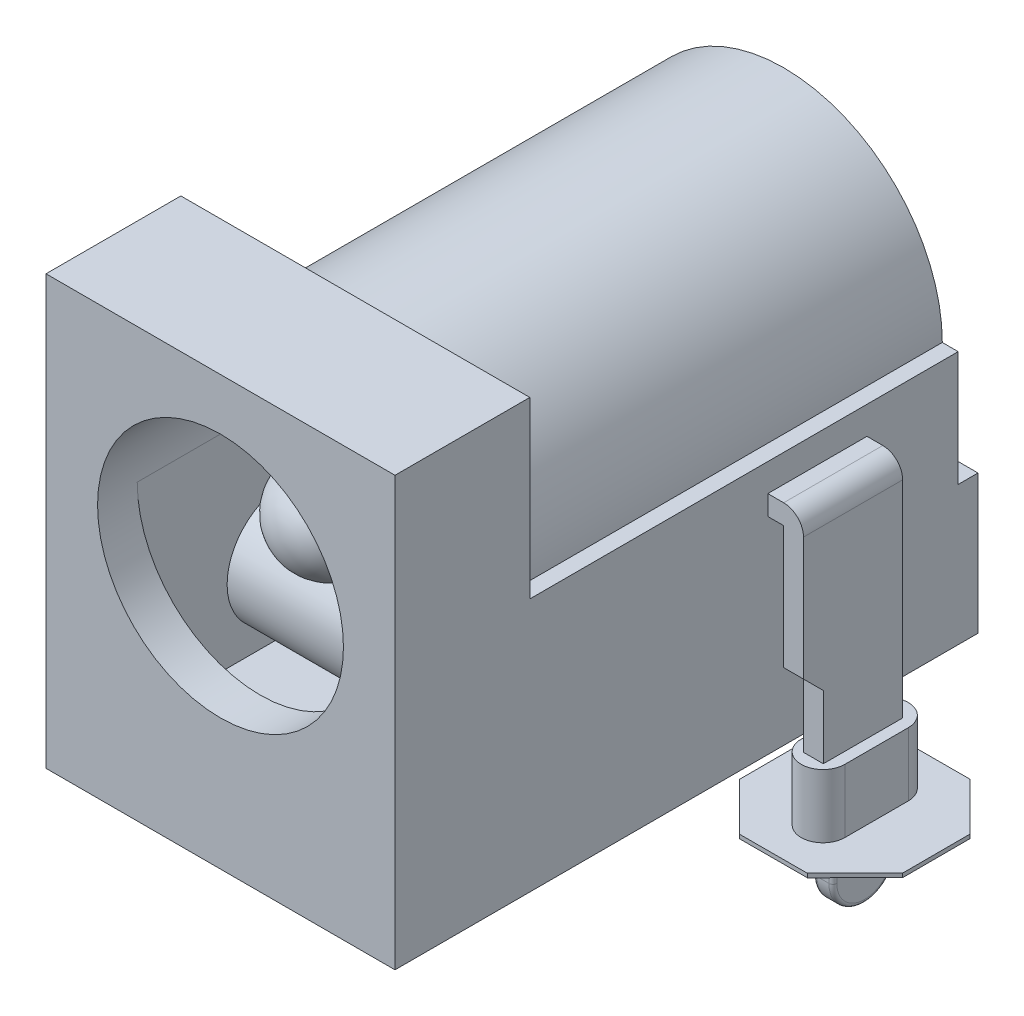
ISO-10303-21;
HEADER;
FILE_DESCRIPTION(('STEP AP214'),'2;1');
FILE_NAME('part.step','',(''),(''),'','','');
FILE_SCHEMA(('AUTOMOTIVE_DESIGN { 1 0 10303 214 1 1 1 1 }'));
ENDSEC;
DATA;
#1=APPLICATION_CONTEXT('core data for automotive mechanical design processes');
#2=APPLICATION_PROTOCOL_DEFINITION('international standard','automotive_design',2000,#1);
#3=PRODUCT_CONTEXT('',#1,'mechanical');
#4=PRODUCT('Part','Part','',(#3));
#5=PRODUCT_RELATED_PRODUCT_CATEGORY('part','',(#4));
#6=PRODUCT_DEFINITION_FORMATION('','',#4);
#7=PRODUCT_DEFINITION_CONTEXT('part definition',#1,'design');
#8=PRODUCT_DEFINITION('design','',#6,#7);
#9=PRODUCT_DEFINITION_SHAPE('','',#8);
#10=(LENGTH_UNIT() NAMED_UNIT(*) SI_UNIT(.MILLI.,.METRE.));
#11=(NAMED_UNIT(*) PLANE_ANGLE_UNIT() SI_UNIT($,.RADIAN.));
#12=(NAMED_UNIT(*) SI_UNIT($,.STERADIAN.) SOLID_ANGLE_UNIT());
#13=UNCERTAINTY_MEASURE_WITH_UNIT(LENGTH_MEASURE(1.E-05),#10,'distance_accuracy_value','');
#14=(GEOMETRIC_REPRESENTATION_CONTEXT(3) GLOBAL_UNCERTAINTY_ASSIGNED_CONTEXT((#13)) GLOBAL_UNIT_ASSIGNED_CONTEXT((#10,
#11,#12)) REPRESENTATION_CONTEXT('',''));
#15=CARTESIAN_POINT('',(0.,0.,0.));
#16=DIRECTION('',(0.,0.,1.));
#17=DIRECTION('',(1.,0.,0.));
#18=AXIS2_PLACEMENT_3D('',#15,#16,#17);
#19=CARTESIAN_POINT('',(0.,-1.7,0.));
#20=DIRECTION('',(0.,-1.,0.));
#21=DIRECTION('',(0.,0.,-1.));
#22=AXIS2_PLACEMENT_3D('',#19,#20,#21);
#23=PLANE('',#22);
#24=DIRECTION('',(0.,0.,1.));
#25=VECTOR('',#24,1.);
#26=CARTESIAN_POINT('',(9.93332285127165,-1.7,0.));
#27=LINE('',#26,#25);
#28=CARTESIAN_POINT('',(9.93332285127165,-1.7,-6.85744416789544));
#29=VERTEX_POINT('',#28);
#30=CARTESIAN_POINT('',(9.93332285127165,-1.7,-8.25744416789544));
#31=VERTEX_POINT('',#30);
#32=EDGE_CURVE('E1262',#29,#31,#27,.F.);
#33=ORIENTED_EDGE('',*,*,#32,.T.);
#34=CARTESIAN_POINT('',(9.58332285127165,-1.7,-8.25744416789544));
#35=DIRECTION('',(0.,-1.,0.));
#36=DIRECTION('',(0.,0.,-1.));
#37=AXIS2_PLACEMENT_3D('',#34,#35,#36);
#38=CIRCLE('',#37,0.35);
#39=CARTESIAN_POINT('',(9.58332285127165,-1.7,-8.60744416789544));
#40=VERTEX_POINT('',#39);
#41=EDGE_CURVE('E1298',#31,#40,#38,.F.);
#42=ORIENTED_EDGE('',*,*,#41,.T.);
#43=DIRECTION('',(1.,0.,0.));
#44=VECTOR('',#43,1.);
#45=CARTESIAN_POINT('',(0.,-1.7,-8.60744416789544));
#46=LINE('',#45,#44);
#47=CARTESIAN_POINT('',(9.28332285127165,-1.7,-8.60744416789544));
#48=VERTEX_POINT('',#47);
#49=EDGE_CURVE('E1296',#40,#48,#46,.F.);
#50=ORIENTED_EDGE('',*,*,#49,.T.);
#51=CARTESIAN_POINT('',(9.28332285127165,-1.7,-8.25744416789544));
#52=DIRECTION('',(0.,-1.,0.));
#53=DIRECTION('',(0.,0.,-1.));
#54=AXIS2_PLACEMENT_3D('',#51,#52,#53);
#55=CIRCLE('',#54,0.35);
#56=CARTESIAN_POINT('',(8.93332285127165,-1.7,-8.25744416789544));
#57=VERTEX_POINT('',#56);
#58=EDGE_CURVE('E1294',#48,#57,#55,.F.);
#59=ORIENTED_EDGE('',*,*,#58,.T.);
#60=DIRECTION('',(0.,0.,-1.));
#61=VECTOR('',#60,1.);
#62=CARTESIAN_POINT('',(8.93332285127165,-1.7,0.));
#63=LINE('',#62,#61);
#64=CARTESIAN_POINT('',(8.93332285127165,-1.7,-6.85744416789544));
#65=VERTEX_POINT('',#64);
#66=EDGE_CURVE('E1292',#57,#65,#63,.F.);
#67=ORIENTED_EDGE('',*,*,#66,.T.);
#68=CARTESIAN_POINT('',(9.28332285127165,-1.7,-6.85744416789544));
#69=DIRECTION('',(0.,-1.,0.));
#70=DIRECTION('',(0.,0.,-1.));
#71=AXIS2_PLACEMENT_3D('',#68,#69,#70);
#72=CIRCLE('',#71,0.35);
#73=CARTESIAN_POINT('',(9.28332285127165,-1.7,-6.50744416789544));
#74=VERTEX_POINT('',#73);
#75=EDGE_CURVE('E1290',#65,#74,#72,.F.);
#76=ORIENTED_EDGE('',*,*,#75,.T.);
#77=DIRECTION('',(-1.,0.,0.));
#78=VECTOR('',#77,1.);
#79=CARTESIAN_POINT('',(0.,-1.7,-6.50744416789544));
#80=LINE('',#79,#78);
#81=CARTESIAN_POINT('',(9.58332285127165,-1.7,-6.50744416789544));
#82=VERTEX_POINT('',#81);
#83=EDGE_CURVE('E1288',#74,#82,#80,.F.);
#84=ORIENTED_EDGE('',*,*,#83,.T.);
#85=CARTESIAN_POINT('',(9.58332285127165,-1.7,-6.85744416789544));
#86=DIRECTION('',(0.,-1.,0.));
#87=DIRECTION('',(0.,0.,-1.));
#88=AXIS2_PLACEMENT_3D('',#85,#86,#87);
#89=CIRCLE('',#88,0.35);
#90=EDGE_CURVE('E1286',#82,#29,#89,.F.);
#91=ORIENTED_EDGE('',*,*,#90,.T.);
#92=EDGE_LOOP('',(#33,#42,#50,#59,#67,#76,#84,#91));
#93=FACE_BOUND('',#92,.T.);
#94=DIRECTION('',(0.00179135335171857,0.,0.999998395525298));
#95=VECTOR('',#94,1.);
#96=CARTESIAN_POINT('',(11.4838784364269,-1.7,-8.41261246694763));
#97=LINE('',#96,#95);
#98=CARTESIAN_POINT('',(11.4838784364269,-1.7,-8.41261246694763));
#99=VERTEX_POINT('',#98);
#100=CARTESIAN_POINT('',(11.4869237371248,-1.7,-6.71261519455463));
#101=VERTEX_POINT('',#100);
#102=EDGE_CURVE('E811',#99,#101,#97,.T.);
#103=ORIENTED_EDGE('',*,*,#102,.T.);
#104=DIRECTION('',(-0.705838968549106,0.,0.708372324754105));
#105=VECTOR('',#104,1.);
#106=CARTESIAN_POINT('',(11.4869237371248,-1.7,-6.71261519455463));
#107=LINE('',#106,#105);
#108=CARTESIAN_POINT('',(10.2869974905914,-1.7,-5.50838224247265));
#109=VERTEX_POINT('',#108);
#110=EDGE_CURVE('E800',#101,#109,#107,.T.);
#111=ORIENTED_EDGE('',*,*,#110,.T.);
#112=DIRECTION('',(-0.999998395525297,0.,0.00179135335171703));
#113=VECTOR('',#112,1.);
#114=CARTESIAN_POINT('',(10.2869974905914,-1.7,-5.50838224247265));
#115=LINE('',#114,#113);
#116=CARTESIAN_POINT('',(8.58700021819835,-1.7,-5.50533694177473));
#117=VERTEX_POINT('',#116);
#118=EDGE_CURVE('E810',#109,#117,#115,.T.);
#119=ORIENTED_EDGE('',*,*,#118,.T.);
#120=DIRECTION('',(-0.708372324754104,0.,-0.705838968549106));
#121=VECTOR('',#120,1.);
#122=CARTESIAN_POINT('',(8.58700021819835,-1.7,-5.50533694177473));
#123=LINE('',#122,#121);
#124=CARTESIAN_POINT('',(7.38276726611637,-1.7,-6.70526318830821));
#125=VERTEX_POINT('',#124);
#126=EDGE_CURVE('E3868',#117,#125,#123,.T.);
#127=ORIENTED_EDGE('',*,*,#126,.T.);
#128=DIRECTION('',(-0.00179135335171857,0.,-0.999998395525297));
#129=VECTOR('',#128,1.);
#130=CARTESIAN_POINT('',(7.38276726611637,-1.7,-6.70526318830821));
#131=LINE('',#130,#129);
#132=CARTESIAN_POINT('',(7.37972196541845,-1.7,-8.40526046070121));
#133=VERTEX_POINT('',#132);
#134=EDGE_CURVE('E3895',#125,#133,#131,.T.);
#135=ORIENTED_EDGE('',*,*,#134,.T.);
#136=DIRECTION('',(0.705838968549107,0.,-0.708372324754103));
#137=VECTOR('',#136,1.);
#138=CARTESIAN_POINT('',(7.37972196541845,-1.7,-8.40526046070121));
#139=LINE('',#138,#137);
#140=CARTESIAN_POINT('',(8.57964821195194,-1.7,-9.6094934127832));
#141=VERTEX_POINT('',#140);
#142=EDGE_CURVE('E3897',#133,#141,#139,.T.);
#143=ORIENTED_EDGE('',*,*,#142,.T.);
#144=DIRECTION('',(0.999998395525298,0.,-0.00179135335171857));
#145=VECTOR('',#144,1.);
#146=CARTESIAN_POINT('',(8.57964821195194,-1.7,-9.6094934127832));
#147=LINE('',#146,#145);
#148=CARTESIAN_POINT('',(10.2796454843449,-1.7,-9.61253871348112));
#149=VERTEX_POINT('',#148);
#150=EDGE_CURVE('E3899',#141,#149,#147,.T.);
#151=ORIENTED_EDGE('',*,*,#150,.T.);
#152=DIRECTION('',(0.708372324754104,0.,0.705838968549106));
#153=VECTOR('',#152,1.);
#154=CARTESIAN_POINT('',(10.2796454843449,-1.7,-9.61253871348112));
#155=LINE('',#154,#153);
#156=EDGE_CURVE('E815',#149,#99,#155,.T.);
#157=ORIENTED_EDGE('',*,*,#156,.T.);
#158=EDGE_LOOP('',(#103,#111,#119,#127,#135,#143,#151,#157));
#159=FACE_BOUND('',#158,.T.);
#160=ADVANCED_FACE('F37',(#93,#159),#23,.T.);
#161=CARTESIAN_POINT('',(0.,-1.7,0.));
#162=DIRECTION('',(0.,-1.,0.));
#163=DIRECTION('',(0.,0.,-1.));
#164=AXIS2_PLACEMENT_3D('',#161,#162,#163);
#165=PLANE('',#164);
#166=DIRECTION('',(-1.,0.,0.));
#167=VECTOR('',#166,1.);
#168=CARTESIAN_POINT('',(0.,-1.7,-4.05));
#169=LINE('',#168,#167);
#170=CARTESIAN_POINT('',(3.69999999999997,-1.7,-4.05));
#171=VERTEX_POINT('',#170);
#172=CARTESIAN_POINT('',(5.1,-1.7,-4.05));
#173=VERTEX_POINT('',#172);
#174=EDGE_CURVE('E1318',#171,#173,#169,.F.);
#175=ORIENTED_EDGE('',*,*,#174,.T.);
#176=CARTESIAN_POINT('',(5.1,-1.7,-4.4));
#177=DIRECTION('',(0.,-1.,0.));
#178=DIRECTION('',(0.,0.,-1.));
#179=AXIS2_PLACEMENT_3D('',#176,#177,#178);
#180=CIRCLE('',#179,0.35);
#181=CARTESIAN_POINT('',(5.45,-1.7,-4.4));
#182=VERTEX_POINT('',#181);
#183=EDGE_CURVE('E1353',#173,#182,#180,.F.);
#184=ORIENTED_EDGE('',*,*,#183,.T.);
#185=DIRECTION('',(0.,0.,1.));
#186=VECTOR('',#185,1.);
#187=CARTESIAN_POINT('',(5.45,-1.7,0.));
#188=LINE('',#187,#186);
#189=CARTESIAN_POINT('',(5.45,-1.7,-4.7));
#190=VERTEX_POINT('',#189);
#191=EDGE_CURVE('E1351',#182,#190,#188,.F.);
#192=ORIENTED_EDGE('',*,*,#191,.T.);
#193=CARTESIAN_POINT('',(5.1,-1.7,-4.7));
#194=DIRECTION('',(0.,-1.,0.));
#195=DIRECTION('',(0.,0.,-1.));
#196=AXIS2_PLACEMENT_3D('',#193,#194,#195);
#197=CIRCLE('',#196,0.35);
#198=CARTESIAN_POINT('',(5.1,-1.7,-5.05));
#199=VERTEX_POINT('',#198);
#200=EDGE_CURVE('E1349',#190,#199,#197,.F.);
#201=ORIENTED_EDGE('',*,*,#200,.T.);
#202=DIRECTION('',(1.,0.,0.));
#203=VECTOR('',#202,1.);
#204=CARTESIAN_POINT('',(0.,-1.7,-5.05));
#205=LINE('',#204,#203);
#206=CARTESIAN_POINT('',(3.69999999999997,-1.7,-5.05));
#207=VERTEX_POINT('',#206);
#208=EDGE_CURVE('E1347',#199,#207,#205,.F.);
#209=ORIENTED_EDGE('',*,*,#208,.T.);
#210=CARTESIAN_POINT('',(3.69999999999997,-1.7,-4.7));
#211=DIRECTION('',(0.,-1.,0.));
#212=DIRECTION('',(0.,0.,-1.));
#213=AXIS2_PLACEMENT_3D('',#210,#211,#212);
#214=CIRCLE('',#213,0.35);
#215=CARTESIAN_POINT('',(3.34999999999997,-1.7,-4.7));
#216=VERTEX_POINT('',#215);
#217=EDGE_CURVE('E1345',#207,#216,#214,.F.);
#218=ORIENTED_EDGE('',*,*,#217,.T.);
#219=DIRECTION('',(0.,0.,-1.));
#220=VECTOR('',#219,1.);
#221=CARTESIAN_POINT('',(3.34999999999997,-1.7,0.));
#222=LINE('',#221,#220);
#223=CARTESIAN_POINT('',(3.34999999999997,-1.7,-4.4));
#224=VERTEX_POINT('',#223);
#225=EDGE_CURVE('E1343',#216,#224,#222,.F.);
#226=ORIENTED_EDGE('',*,*,#225,.T.);
#227=CARTESIAN_POINT('',(3.69999999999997,-1.7,-4.4));
#228=DIRECTION('',(0.,-1.,0.));
#229=DIRECTION('',(0.,0.,-1.));
#230=AXIS2_PLACEMENT_3D('',#227,#228,#229);
#231=CIRCLE('',#230,0.35);
#232=EDGE_CURVE('E1341',#224,#171,#231,.F.);
#233=ORIENTED_EDGE('',*,*,#232,.T.);
#234=EDGE_LOOP('',(#175,#184,#192,#201,#209,#218,#226,#233));
#235=FACE_BOUND('',#234,.T.);
#236=DIRECTION('',(0.,0.,1.));
#237=VECTOR('',#236,1.);
#238=CARTESIAN_POINT('',(6.45208152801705,-1.7,-5.4));
#239=LINE('',#238,#237);
#240=CARTESIAN_POINT('',(6.45208152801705,-1.7,-5.4));
#241=VERTEX_POINT('',#240);
#242=CARTESIAN_POINT('',(6.45208152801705,-1.7,-3.7));
#243=VERTEX_POINT('',#242);
#244=EDGE_CURVE('E833',#241,#243,#239,.T.);
#245=ORIENTED_EDGE('',*,*,#244,.T.);
#246=DIRECTION('',(-0.707106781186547,0.,0.707106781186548));
#247=VECTOR('',#246,1.);
#248=CARTESIAN_POINT('',(6.45208152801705,-1.7,-3.7));
#249=LINE('',#248,#247);
#250=CARTESIAN_POINT('',(5.24999999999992,-1.7,-2.49791847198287));
#251=VERTEX_POINT('',#250);
#252=EDGE_CURVE('E836',#243,#251,#249,.T.);
#253=ORIENTED_EDGE('',*,*,#252,.T.);
#254=DIRECTION('',(-1.,0.,0.));
#255=VECTOR('',#254,1.);
#256=CARTESIAN_POINT('',(5.24999999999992,-1.7,-2.49791847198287));
#257=LINE('',#256,#255);
#258=CARTESIAN_POINT('',(3.54999999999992,-1.7,-2.49791847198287));
#259=VERTEX_POINT('',#258);
#260=EDGE_CURVE('E839',#251,#259,#257,.T.);
#261=ORIENTED_EDGE('',*,*,#260,.T.);
#262=DIRECTION('',(-0.707106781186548,0.,-0.707106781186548));
#263=VECTOR('',#262,1.);
#264=CARTESIAN_POINT('',(3.54999999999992,-1.7,-2.49791847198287));
#265=LINE('',#264,#263);
#266=CARTESIAN_POINT('',(2.34791847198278,-1.7,-3.7));
#267=VERTEX_POINT('',#266);
#268=EDGE_CURVE('E841',#259,#267,#265,.T.);
#269=ORIENTED_EDGE('',*,*,#268,.T.);
#270=DIRECTION('',(0.,0.,-1.));
#271=VECTOR('',#270,1.);
#272=CARTESIAN_POINT('',(2.34791847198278,-1.7,-3.7));
#273=LINE('',#272,#271);
#274=CARTESIAN_POINT('',(2.34791847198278,-1.7,-5.4));
#275=VERTEX_POINT('',#274);
#276=EDGE_CURVE('E843',#267,#275,#273,.T.);
#277=ORIENTED_EDGE('',*,*,#276,.T.);
#278=DIRECTION('',(0.707106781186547,0.,-0.707106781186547));
#279=VECTOR('',#278,1.);
#280=CARTESIAN_POINT('',(2.34791847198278,-1.7,-5.4));
#281=LINE('',#280,#279);
#282=CARTESIAN_POINT('',(3.54999999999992,-1.7,-6.60208152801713));
#283=VERTEX_POINT('',#282);
#284=EDGE_CURVE('E845',#275,#283,#281,.T.);
#285=ORIENTED_EDGE('',*,*,#284,.T.);
#286=DIRECTION('',(1.,0.,0.));
#287=VECTOR('',#286,1.);
#288=CARTESIAN_POINT('',(3.54999999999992,-1.7,-6.60208152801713));
#289=LINE('',#288,#287);
#290=CARTESIAN_POINT('',(5.24999999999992,-1.7,-6.60208152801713));
#291=VERTEX_POINT('',#290);
#292=EDGE_CURVE('E847',#283,#291,#289,.T.);
#293=ORIENTED_EDGE('',*,*,#292,.T.);
#294=DIRECTION('',(0.707106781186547,0.,0.707106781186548));
#295=VECTOR('',#294,1.);
#296=CARTESIAN_POINT('',(5.24999999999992,-1.7,-6.60208152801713));
#297=LINE('',#296,#295);
#298=EDGE_CURVE('E849',#291,#241,#297,.T.);
#299=ORIENTED_EDGE('',*,*,#298,.T.);
#300=EDGE_LOOP('',(#245,#253,#261,#269,#277,#285,#293,#299));
#301=FACE_BOUND('',#300,.T.);
#302=ADVANCED_FACE('F1474',(#235,#301),#165,.T.);
#303=CARTESIAN_POINT('',(0.,-1.7,0.));
#304=DIRECTION('',(0.,-1.,0.));
#305=DIRECTION('',(0.,0.,-1.));
#306=AXIS2_PLACEMENT_3D('',#303,#304,#305);
#307=PLANE('',#306);
#308=DIRECTION('',(-1.,0.,0.));
#309=VECTOR('',#308,1.);
#310=CARTESIAN_POINT('',(0.,-1.7,-10.05));
#311=LINE('',#310,#309);
#312=CARTESIAN_POINT('',(3.7,-1.7,-10.05));
#313=VERTEX_POINT('',#312);
#314=CARTESIAN_POINT('',(5.1,-1.7,-10.05));
#315=VERTEX_POINT('',#314);
#316=EDGE_CURVE('E1212',#313,#315,#311,.F.);
#317=ORIENTED_EDGE('',*,*,#316,.T.);
#318=CARTESIAN_POINT('',(5.1,-1.7,-10.4));
#319=DIRECTION('',(0.,-1.,0.));
#320=DIRECTION('',(0.,0.,-1.));
#321=AXIS2_PLACEMENT_3D('',#318,#319,#320);
#322=CIRCLE('',#321,0.35);
#323=CARTESIAN_POINT('',(5.45,-1.7,-10.4));
#324=VERTEX_POINT('',#323);
#325=EDGE_CURVE('E1242',#315,#324,#322,.F.);
#326=ORIENTED_EDGE('',*,*,#325,.T.);
#327=DIRECTION('',(0.,0.,1.));
#328=VECTOR('',#327,1.);
#329=CARTESIAN_POINT('',(5.45,-1.7,0.));
#330=LINE('',#329,#328);
#331=CARTESIAN_POINT('',(5.45,-1.7,-10.7));
#332=VERTEX_POINT('',#331);
#333=EDGE_CURVE('E1240',#324,#332,#330,.F.);
#334=ORIENTED_EDGE('',*,*,#333,.T.);
#335=CARTESIAN_POINT('',(5.1,-1.7,-10.7));
#336=DIRECTION('',(0.,-1.,0.));
#337=DIRECTION('',(0.,0.,-1.));
#338=AXIS2_PLACEMENT_3D('',#335,#336,#337);
#339=CIRCLE('',#338,0.35);
#340=CARTESIAN_POINT('',(5.1,-1.7,-11.05));
#341=VERTEX_POINT('',#340);
#342=EDGE_CURVE('E1238',#332,#341,#339,.F.);
#343=ORIENTED_EDGE('',*,*,#342,.T.);
#344=DIRECTION('',(1.,0.,0.));
#345=VECTOR('',#344,1.);
#346=CARTESIAN_POINT('',(0.,-1.7,-11.05));
#347=LINE('',#346,#345);
#348=CARTESIAN_POINT('',(3.7,-1.7,-11.05));
#349=VERTEX_POINT('',#348);
#350=EDGE_CURVE('E1236',#341,#349,#347,.F.);
#351=ORIENTED_EDGE('',*,*,#350,.T.);
#352=CARTESIAN_POINT('',(3.7,-1.7,-10.7));
#353=DIRECTION('',(0.,-1.,0.));
#354=DIRECTION('',(0.,0.,-1.));
#355=AXIS2_PLACEMENT_3D('',#352,#353,#354);
#356=CIRCLE('',#355,0.35);
#357=CARTESIAN_POINT('',(3.35,-1.7,-10.7));
#358=VERTEX_POINT('',#357);
#359=EDGE_CURVE('E1234',#349,#358,#356,.F.);
#360=ORIENTED_EDGE('',*,*,#359,.T.);
#361=DIRECTION('',(0.,0.,-1.));
#362=VECTOR('',#361,1.);
#363=CARTESIAN_POINT('',(3.35,-1.7,0.));
#364=LINE('',#363,#362);
#365=CARTESIAN_POINT('',(3.35,-1.7,-10.4));
#366=VERTEX_POINT('',#365);
#367=EDGE_CURVE('E1232',#358,#366,#364,.F.);
#368=ORIENTED_EDGE('',*,*,#367,.T.);
#369=CARTESIAN_POINT('',(3.7,-1.7,-10.4));
#370=DIRECTION('',(0.,-1.,0.));
#371=DIRECTION('',(0.,0.,-1.));
#372=AXIS2_PLACEMENT_3D('',#369,#370,#371);
#373=CIRCLE('',#372,0.35);
#374=EDGE_CURVE('E1230',#366,#313,#373,.F.);
#375=ORIENTED_EDGE('',*,*,#374,.T.);
#376=EDGE_LOOP('',(#317,#326,#334,#343,#351,#360,#368,#375));
#377=FACE_BOUND('',#376,.T.);
#378=DIRECTION('',(0.,0.,1.));
#379=VECTOR('',#378,1.);
#380=CARTESIAN_POINT('',(6.45208152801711,-1.7,-11.4));
#381=LINE('',#380,#379);
#382=CARTESIAN_POINT('',(6.45208152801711,-1.7,-11.4));
#383=VERTEX_POINT('',#382);
#384=CARTESIAN_POINT('',(6.45208152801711,-1.7,-9.7));
#385=VERTEX_POINT('',#384);
#386=EDGE_CURVE('E888',#383,#385,#381,.T.);
#387=ORIENTED_EDGE('',*,*,#386,.T.);
#388=DIRECTION('',(-0.707106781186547,0.,0.707106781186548));
#389=VECTOR('',#388,1.);
#390=CARTESIAN_POINT('',(6.45208152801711,-1.7,-9.7));
#391=LINE('',#390,#389);
#392=CARTESIAN_POINT('',(5.25000000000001,-1.7,-8.4979184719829));
#393=VERTEX_POINT('',#392);
#394=EDGE_CURVE('E891',#385,#393,#391,.T.);
#395=ORIENTED_EDGE('',*,*,#394,.T.);
#396=DIRECTION('',(-1.,0.,0.));
#397=VECTOR('',#396,1.);
#398=CARTESIAN_POINT('',(5.25000000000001,-1.7,-8.4979184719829));
#399=LINE('',#398,#397);
#400=CARTESIAN_POINT('',(3.55000000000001,-1.7,-8.4979184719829));
#401=VERTEX_POINT('',#400);
#402=EDGE_CURVE('E894',#393,#401,#399,.T.);
#403=ORIENTED_EDGE('',*,*,#402,.T.);
#404=DIRECTION('',(-0.707106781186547,0.,-0.707106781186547));
#405=VECTOR('',#404,1.);
#406=CARTESIAN_POINT('',(3.55000000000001,-1.7,-8.4979184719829));
#407=LINE('',#406,#405);
#408=CARTESIAN_POINT('',(2.3479184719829,-1.7,-9.70000000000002));
#409=VERTEX_POINT('',#408);
#410=EDGE_CURVE('E896',#401,#409,#407,.T.);
#411=ORIENTED_EDGE('',*,*,#410,.T.);
#412=DIRECTION('',(0.,0.,-1.));
#413=VECTOR('',#412,1.);
#414=CARTESIAN_POINT('',(2.3479184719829,-1.7,-9.70000000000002));
#415=LINE('',#414,#413);
#416=CARTESIAN_POINT('',(2.3479184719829,-1.7,-11.4));
#417=VERTEX_POINT('',#416);
#418=EDGE_CURVE('E898',#409,#417,#415,.T.);
#419=ORIENTED_EDGE('',*,*,#418,.T.);
#420=DIRECTION('',(0.707106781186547,0.,-0.707106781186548));
#421=VECTOR('',#420,1.);
#422=CARTESIAN_POINT('',(2.3479184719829,-1.7,-11.4));
#423=LINE('',#422,#421);
#424=CARTESIAN_POINT('',(3.55000000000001,-1.7,-12.6020815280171));
#425=VERTEX_POINT('',#424);
#426=EDGE_CURVE('E900',#417,#425,#423,.T.);
#427=ORIENTED_EDGE('',*,*,#426,.T.);
#428=DIRECTION('',(1.,0.,0.));
#429=VECTOR('',#428,1.);
#430=CARTESIAN_POINT('',(3.55000000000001,-1.7,-12.6020815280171));
#431=LINE('',#430,#429);
#432=CARTESIAN_POINT('',(5.25,-1.7,-12.6020815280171));
#433=VERTEX_POINT('',#432);
#434=EDGE_CURVE('E902',#425,#433,#431,.T.);
#435=ORIENTED_EDGE('',*,*,#434,.T.);
#436=DIRECTION('',(0.707106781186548,0.,0.707106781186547));
#437=VECTOR('',#436,1.);
#438=CARTESIAN_POINT('',(5.25,-1.7,-12.6020815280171));
#439=LINE('',#438,#437);
#440=EDGE_CURVE('E904',#433,#383,#439,.T.);
#441=ORIENTED_EDGE('',*,*,#440,.T.);
#442=EDGE_LOOP('',(#387,#395,#403,#411,#419,#427,#435,#441));
#443=FACE_BOUND('',#442,.T.);
#444=ADVANCED_FACE('F1490',(#377,#443),#307,.T.);
#445=CARTESIAN_POINT('',(0.,0.,2.4));
#446=DIRECTION('',(0.,1.,0.));
#447=DIRECTION('',(0.,0.,1.));
#448=AXIS2_PLACEMENT_3D('',#445,#446,#447);
#449=PLANE('',#448);
#450=CARTESIAN_POINT('',(3.6,0.,-10.55));
#451=DIRECTION('',(0.,-1.,0.));
#452=DIRECTION('',(0.,0.,1.));
#453=AXIS2_PLACEMENT_3D('',#450,#451,#452);
#454=CIRCLE('',#453,0.549999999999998);
#455=CARTESIAN_POINT('',(3.6,0.,-10.));
#456=VERTEX_POINT('',#455);
#457=CARTESIAN_POINT('',(3.6,0.,-11.1));
#458=VERTEX_POINT('',#457);
#459=EDGE_CURVE('E1014',#456,#458,#454,.T.);
#460=ORIENTED_EDGE('',*,*,#459,.F.);
#461=DIRECTION('',(-1.,0.,0.));
#462=VECTOR('',#461,1.);
#463=CARTESIAN_POINT('',(3.6,0.,-10.));
#464=LINE('',#463,#462);
#465=CARTESIAN_POINT('',(5.2,0.,-10.));
#466=VERTEX_POINT('',#465);
#467=EDGE_CURVE('E1019',#466,#456,#464,.T.);
#468=ORIENTED_EDGE('',*,*,#467,.F.);
#469=CARTESIAN_POINT('',(5.2,0.,-10.55));
#470=DIRECTION('',(0.,-1.,0.));
#471=DIRECTION('',(0.,0.,-1.));
#472=AXIS2_PLACEMENT_3D('',#469,#470,#471);
#473=CIRCLE('',#472,0.550000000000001);
#474=CARTESIAN_POINT('',(5.2,0.,-11.1));
#475=VERTEX_POINT('',#474);
#476=EDGE_CURVE('E1036',#475,#466,#473,.T.);
#477=ORIENTED_EDGE('',*,*,#476,.F.);
#478=DIRECTION('',(-1.,0.,0.));
#479=VECTOR('',#478,1.);
#480=CARTESIAN_POINT('',(5.9,0.,-11.1));
#481=LINE('',#480,#479);
#482=CARTESIAN_POINT('',(5.9,0.,-11.1));
#483=VERTEX_POINT('',#482);
#484=EDGE_CURVE('E3150',#483,#475,#481,.T.);
#485=ORIENTED_EDGE('',*,*,#484,.F.);
#486=DIRECTION('',(0.,0.,1.));
#487=VECTOR('',#486,1.);
#488=CARTESIAN_POINT('',(5.9,0.,-11.3));
#489=LINE('',#488,#487);
#490=CARTESIAN_POINT('',(5.9,0.,-11.3));
#491=VERTEX_POINT('',#490);
#492=EDGE_CURVE('E3128',#491,#483,#489,.T.);
#493=ORIENTED_EDGE('',*,*,#492,.F.);
#494=DIRECTION('',(-1.,0.,0.));
#495=VECTOR('',#494,1.);
#496=CARTESIAN_POINT('',(8.8,0.,-11.3));
#497=LINE('',#496,#495);
#498=CARTESIAN_POINT('',(8.8,0.,-11.3));
#499=VERTEX_POINT('',#498);
#500=EDGE_CURVE('E3114',#499,#491,#497,.T.);
#501=ORIENTED_EDGE('',*,*,#500,.F.);
#502=DIRECTION('',(0.,0.,-1.));
#503=VECTOR('',#502,1.);
#504=CARTESIAN_POINT('',(8.8,0.,2.4));
#505=LINE('',#504,#503);
#506=CARTESIAN_POINT('',(8.8,0.,3.4));
#507=VERTEX_POINT('',#506);
#508=EDGE_CURVE('E3301',#507,#499,#505,.T.);
#509=ORIENTED_EDGE('',*,*,#508,.F.);
#510=DIRECTION('',(1.,0.,0.));
#511=VECTOR('',#510,1.);
#512=CARTESIAN_POINT('',(0.,0.,3.4));
#513=LINE('',#512,#511);
#514=CARTESIAN_POINT('',(0.,0.,3.4));
#515=VERTEX_POINT('',#514);
#516=EDGE_CURVE('E3217',#515,#507,#513,.T.);
#517=ORIENTED_EDGE('',*,*,#516,.F.);
#518=DIRECTION('',(0.,0.,-1.));
#519=VECTOR('',#518,1.);
#520=CARTESIAN_POINT('',(0.,0.,2.4));
#521=LINE('',#520,#519);
#522=CARTESIAN_POINT('',(0.,0.,-11.3));
#523=VERTEX_POINT('',#522);
#524=EDGE_CURVE('E3303',#515,#523,#521,.T.);
#525=ORIENTED_EDGE('',*,*,#524,.T.);
#526=DIRECTION('',(-1.,0.,0.));
#527=VECTOR('',#526,1.);
#528=CARTESIAN_POINT('',(0.,0.,-11.3));
#529=LINE('',#528,#527);
#530=CARTESIAN_POINT('',(2.9,0.,-11.3));
#531=VERTEX_POINT('',#530);
#532=EDGE_CURVE('E3098',#531,#523,#529,.T.);
#533=ORIENTED_EDGE('',*,*,#532,.F.);
#534=DIRECTION('',(0.,0.,1.));
#535=VECTOR('',#534,1.);
#536=CARTESIAN_POINT('',(2.9,0.,-11.3));
#537=LINE('',#536,#535);
#538=CARTESIAN_POINT('',(2.9,0.,-11.1));
#539=VERTEX_POINT('',#538);
#540=EDGE_CURVE('E3101',#531,#539,#537,.T.);
#541=ORIENTED_EDGE('',*,*,#540,.T.);
#542=EDGE_CURVE('E3140',#458,#539,#481,.T.);
#543=ORIENTED_EDGE('',*,*,#542,.F.);
#544=EDGE_LOOP('',(#460,#468,#477,#485,#493,#501,#509,#517,#525,#533,#541,#543));
#545=FACE_BOUND('',#544,.T.);
#546=CARTESIAN_POINT('',(3.59999999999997,0.,-4.55));
#547=DIRECTION('',(0.,-1.,0.));
#548=DIRECTION('',(0.,0.,1.));
#549=AXIS2_PLACEMENT_3D('',#546,#547,#548);
#550=CIRCLE('',#549,0.55);
#551=CARTESIAN_POINT('',(3.59999999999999,0.,-4.));
#552=VERTEX_POINT('',#551);
#553=CARTESIAN_POINT('',(3.59999999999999,0.,-5.1));
#554=VERTEX_POINT('',#553);
#555=EDGE_CURVE('E978',#552,#554,#550,.T.);
#556=ORIENTED_EDGE('',*,*,#555,.F.);
#557=DIRECTION('',(-1.,0.,0.));
#558=VECTOR('',#557,1.);
#559=CARTESIAN_POINT('',(3.59999999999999,0.,-4.));
#560=LINE('',#559,#558);
#561=CARTESIAN_POINT('',(5.19999999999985,0.,-4.));
#562=VERTEX_POINT('',#561);
#563=EDGE_CURVE('E983',#562,#552,#560,.T.);
#564=ORIENTED_EDGE('',*,*,#563,.F.);
#565=CARTESIAN_POINT('',(5.19999999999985,0.,-4.55));
#566=DIRECTION('',(0.,-1.,0.));
#567=DIRECTION('',(0.,0.,-1.));
#568=AXIS2_PLACEMENT_3D('',#565,#566,#567);
#569=CIRCLE('',#568,0.550000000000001);
#570=CARTESIAN_POINT('',(5.19999999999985,0.,-5.1));
#571=VERTEX_POINT('',#570);
#572=EDGE_CURVE('E998',#571,#562,#569,.T.);
#573=ORIENTED_EDGE('',*,*,#572,.F.);
#574=DIRECTION('',(1.,0.,0.));
#575=VECTOR('',#574,1.);
#576=CARTESIAN_POINT('',(3.59999999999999,0.,-5.1));
#577=LINE('',#576,#575);
#578=EDGE_CURVE('E995',#554,#571,#577,.T.);
#579=ORIENTED_EDGE('',*,*,#578,.F.);
#580=EDGE_LOOP('',(#556,#564,#573,#579));
#581=FACE_BOUND('',#580,.T.);
#582=ADVANCED_FACE('F1567',(#545,#581),#449,.F.);
#583=CARTESIAN_POINT('',(7.5,1.2,-7.1));
#584=DIRECTION('',(1.,0.,0.));
#585=DIRECTION('',(0.,0.,-1.));
#586=AXIS2_PLACEMENT_3D('',#583,#584,#585);
#587=PLANE('',#586);
#588=DIRECTION('',(0.,0.,-1.));
#589=VECTOR('',#588,1.);
#590=CARTESIAN_POINT('',(7.5,4.52970681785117,-7.1));
#591=LINE('',#590,#589);
#592=CARTESIAN_POINT('',(7.5,4.52970681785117,-1.36663474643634));
#593=VERTEX_POINT('',#592);
#594=CARTESIAN_POINT('',(7.5,4.52970681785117,-7.1));
#595=VERTEX_POINT('',#594);
#596=EDGE_CURVE('E2982',#593,#595,#591,.T.);
#597=ORIENTED_EDGE('',*,*,#596,.F.);
#598=CARTESIAN_POINT('',(7.5,3.02970681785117,-1.36663474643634));
#599=DIRECTION('',(1.,0.,0.));
#600=DIRECTION('',(0.,0.,-1.));
#601=AXIS2_PLACEMENT_3D('',#598,#599,#600);
#602=CIRCLE('',#601,1.5);
#603=CARTESIAN_POINT('',(7.5,1.52970681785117,-1.36663474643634));
#604=VERTEX_POINT('',#603);
#605=EDGE_CURVE('E2988',#604,#593,#602,.F.);
#606=ORIENTED_EDGE('',*,*,#605,.F.);
#607=DIRECTION('',(0.,0.,1.));
#608=VECTOR('',#607,1.);
#609=CARTESIAN_POINT('',(7.5,1.52970681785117,-7.1));
#610=LINE('',#609,#608);
#611=CARTESIAN_POINT('',(7.5,1.52970681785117,-7.1));
#612=VERTEX_POINT('',#611);
#613=EDGE_CURVE('E2979',#612,#604,#610,.T.);
#614=ORIENTED_EDGE('',*,*,#613,.F.);
#615=DIRECTION('',(0.,1.,0.));
#616=VECTOR('',#615,1.);
#617=CARTESIAN_POINT('',(7.5,1.2,-7.1));
#618=LINE('',#617,#616);
#619=CARTESIAN_POINT('',(7.5,1.2,-7.1));
#620=VERTEX_POINT('',#619);
#621=EDGE_CURVE('E3242',#620,#612,#618,.T.);
#622=ORIENTED_EDGE('',*,*,#621,.F.);
#623=DIRECTION('',(0.,0.,1.));
#624=VECTOR('',#623,1.);
#625=CARTESIAN_POINT('',(7.5,1.2,-7.1));
#626=LINE('',#625,#624);
#627=CARTESIAN_POINT('',(7.5,1.2,2.4));
#628=VERTEX_POINT('',#627);
#629=EDGE_CURVE('E3251',#620,#628,#626,.T.);
#630=ORIENTED_EDGE('',*,*,#629,.T.);
#631=DIRECTION('',(0.,1.,0.));
#632=VECTOR('',#631,1.);
#633=CARTESIAN_POINT('',(7.5,1.2,2.4));
#634=LINE('',#633,#632);
#635=CARTESIAN_POINT('',(7.5,6.4,2.4));
#636=VERTEX_POINT('',#635);
#637=EDGE_CURVE('E3194',#628,#636,#634,.T.);
#638=ORIENTED_EDGE('',*,*,#637,.T.);
#639=DIRECTION('',(0.,0.,1.));
#640=VECTOR('',#639,1.);
#641=CARTESIAN_POINT('',(7.5,6.4,-7.1));
#642=LINE('',#641,#640);
#643=CARTESIAN_POINT('',(7.5,6.4,-7.1));
#644=VERTEX_POINT('',#643);
#645=EDGE_CURVE('E3254',#644,#636,#642,.T.);
#646=ORIENTED_EDGE('',*,*,#645,.F.);
#647=CARTESIAN_POINT('',(7.5,5.7,-7.1));
#648=VERTEX_POINT('',#647);
#649=EDGE_CURVE('E3241',#648,#644,#618,.T.);
#650=ORIENTED_EDGE('',*,*,#649,.F.);
#651=DIRECTION('',(0.,0.,1.));
#652=VECTOR('',#651,1.);
#653=CARTESIAN_POINT('',(7.5,5.7,-7.1));
#654=LINE('',#653,#652);
#655=CARTESIAN_POINT('',(7.5,5.7,-6.));
#656=VERTEX_POINT('',#655);
#657=EDGE_CURVE('E3077',#648,#656,#654,.T.);
#658=ORIENTED_EDGE('',*,*,#657,.T.);
#659=DIRECTION('',(0.,-1.,0.));
#660=VECTOR('',#659,1.);
#661=CARTESIAN_POINT('',(7.5,1.2,-6.));
#662=LINE('',#661,#660);
#663=CARTESIAN_POINT('',(7.5,5.2,-6.));
#664=VERTEX_POINT('',#663);
#665=EDGE_CURVE('E3087',#656,#664,#662,.T.);
#666=ORIENTED_EDGE('',*,*,#665,.T.);
#667=DIRECTION('',(0.,0.,-1.));
#668=VECTOR('',#667,1.);
#669=CARTESIAN_POINT('',(7.5,5.2,-7.1));
#670=LINE('',#669,#668);
#671=CARTESIAN_POINT('',(7.5,5.2,-7.1));
#672=VERTEX_POINT('',#671);
#673=EDGE_CURVE('E3054',#664,#672,#670,.T.);
#674=ORIENTED_EDGE('',*,*,#673,.T.);
#675=EDGE_CURVE('E3246',#595,#672,#618,.T.);
#676=ORIENTED_EDGE('',*,*,#675,.F.);
#677=EDGE_LOOP('',(#597,#606,#614,#622,#630,#638,#646,#650,#658,#666,#674,#676));
#678=FACE_BOUND('',#677,.T.);
#679=ADVANCED_FACE('F1791',(#678),#587,.F.);
#680=CARTESIAN_POINT('',(1.3,6.4,-7.1));
#681=DIRECTION('',(-1.,0.,0.));
#682=DIRECTION('',(0.,0.,1.));
#683=AXIS2_PLACEMENT_3D('',#680,#681,#682);
#684=PLANE('',#683);
#685=DIRECTION('',(0.,0.,1.));
#686=VECTOR('',#685,1.);
#687=CARTESIAN_POINT('',(1.3,4.52970681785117,-7.1));
#688=LINE('',#687,#686);
#689=CARTESIAN_POINT('',(1.3,4.52970681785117,-7.1));
#690=VERTEX_POINT('',#689);
#691=CARTESIAN_POINT('',(1.3,4.52970681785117,-1.36663474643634));
#692=VERTEX_POINT('',#691);
#693=EDGE_CURVE('E2943',#690,#692,#688,.T.);
#694=ORIENTED_EDGE('',*,*,#693,.F.);
#695=DIRECTION('',(0.,-1.,0.));
#696=VECTOR('',#695,1.);
#697=CARTESIAN_POINT('',(1.3,6.4,-7.1));
#698=LINE('',#697,#696);
#699=CARTESIAN_POINT('',(1.3,5.2,-7.1));
#700=VERTEX_POINT('',#699);
#701=EDGE_CURVE('E3238',#700,#690,#698,.T.);
#702=ORIENTED_EDGE('',*,*,#701,.F.);
#703=DIRECTION('',(0.,0.,1.));
#704=VECTOR('',#703,1.);
#705=CARTESIAN_POINT('',(1.3,5.2,-7.1));
#706=LINE('',#705,#704);
#707=CARTESIAN_POINT('',(1.3,5.2,-6.));
#708=VERTEX_POINT('',#707);
#709=EDGE_CURVE('E3061',#700,#708,#706,.T.);
#710=ORIENTED_EDGE('',*,*,#709,.T.);
#711=DIRECTION('',(0.,1.,0.));
#712=VECTOR('',#711,1.);
#713=CARTESIAN_POINT('',(1.3,6.4,-6.));
#714=LINE('',#713,#712);
#715=CARTESIAN_POINT('',(1.3,5.7,-6.));
#716=VERTEX_POINT('',#715);
#717=EDGE_CURVE('E3084',#708,#716,#714,.T.);
#718=ORIENTED_EDGE('',*,*,#717,.T.);
#719=DIRECTION('',(0.,0.,-1.));
#720=VECTOR('',#719,1.);
#721=CARTESIAN_POINT('',(1.3,5.7,-7.1));
#722=LINE('',#721,#720);
#723=CARTESIAN_POINT('',(1.3,5.7,-7.1));
#724=VERTEX_POINT('',#723);
#725=EDGE_CURVE('E3070',#716,#724,#722,.T.);
#726=ORIENTED_EDGE('',*,*,#725,.T.);
#727=CARTESIAN_POINT('',(1.3,6.4,-7.1));
#728=VERTEX_POINT('',#727);
#729=EDGE_CURVE('E3234',#728,#724,#698,.T.);
#730=ORIENTED_EDGE('',*,*,#729,.F.);
#731=DIRECTION('',(0.,0.,1.));
#732=VECTOR('',#731,1.);
#733=CARTESIAN_POINT('',(1.3,6.4,-7.1));
#734=LINE('',#733,#732);
#735=CARTESIAN_POINT('',(1.3,6.4,2.4));
#736=VERTEX_POINT('',#735);
#737=EDGE_CURVE('E3244',#728,#736,#734,.T.);
#738=ORIENTED_EDGE('',*,*,#737,.T.);
#739=DIRECTION('',(0.,-1.,0.));
#740=VECTOR('',#739,1.);
#741=CARTESIAN_POINT('',(1.3,6.4,2.4));
#742=LINE('',#741,#740);
#743=CARTESIAN_POINT('',(1.3,1.2,2.4));
#744=VERTEX_POINT('',#743);
#745=EDGE_CURVE('E3226',#736,#744,#742,.T.);
#746=ORIENTED_EDGE('',*,*,#745,.T.);
#747=DIRECTION('',(0.,0.,1.));
#748=VECTOR('',#747,1.);
#749=CARTESIAN_POINT('',(1.3,1.2,-7.1));
#750=LINE('',#749,#748);
#751=CARTESIAN_POINT('',(1.3,1.2,-7.1));
#752=VERTEX_POINT('',#751);
#753=EDGE_CURVE('E3255',#752,#744,#750,.T.);
#754=ORIENTED_EDGE('',*,*,#753,.F.);
#755=CARTESIAN_POINT('',(1.3,1.52970681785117,-7.1));
#756=VERTEX_POINT('',#755);
#757=EDGE_CURVE('E3233',#756,#752,#698,.T.);
#758=ORIENTED_EDGE('',*,*,#757,.F.);
#759=DIRECTION('',(0.,0.,-1.));
#760=VECTOR('',#759,1.);
#761=CARTESIAN_POINT('',(1.3,1.52970681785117,-7.1));
#762=LINE('',#761,#760);
#763=CARTESIAN_POINT('',(1.3,1.52970681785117,-1.36663474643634));
#764=VERTEX_POINT('',#763);
#765=EDGE_CURVE('E2949',#764,#756,#762,.T.);
#766=ORIENTED_EDGE('',*,*,#765,.F.);
#767=CARTESIAN_POINT('',(1.3,3.02970681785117,-1.36663474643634));
#768=DIRECTION('',(1.,0.,0.));
#769=DIRECTION('',(0.,0.,-1.));
#770=AXIS2_PLACEMENT_3D('',#767,#768,#769);
#771=CIRCLE('',#770,1.5);
#772=EDGE_CURVE('E2946',#692,#764,#771,.T.);
#773=ORIENTED_EDGE('',*,*,#772,.F.);
#774=EDGE_LOOP('',(#694,#702,#710,#718,#726,#730,#738,#746,#754,#758,#766,#773));
#775=FACE_BOUND('',#774,.T.);
#776=ADVANCED_FACE('F1788',(#775),#684,.F.);
#777=CARTESIAN_POINT('',(4.4,6.4,-7.1));
#778=DIRECTION('',(0.,0.,-1.));
#779=DIRECTION('',(-1.,0.,0.));
#780=AXIS2_PLACEMENT_3D('',#777,#778,#779);
#781=PLANE('',#780);
#782=DIRECTION('',(-1.,0.,0.));
#783=VECTOR('',#782,1.);
#784=CARTESIAN_POINT('',(4.4,4.52970681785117,-7.1));
#785=LINE('',#784,#783);
#786=EDGE_CURVE('E1043',#595,#690,#785,.T.);
#787=ORIENTED_EDGE('',*,*,#786,.F.);
#788=ORIENTED_EDGE('',*,*,#675,.T.);
#789=DIRECTION('',(-1.,0.,0.));
#790=VECTOR('',#789,1.);
#791=CARTESIAN_POINT('',(4.4,5.2,-7.1));
#792=LINE('',#791,#790);
#793=CARTESIAN_POINT('',(4.75,5.2,-7.1));
#794=VERTEX_POINT('',#793);
#795=EDGE_CURVE('E3051',#672,#794,#792,.T.);
#796=ORIENTED_EDGE('',*,*,#795,.T.);
#797=CARTESIAN_POINT('',(4.4,6.4,-7.1));
#798=DIRECTION('',(0.,0.,-1.));
#799=DIRECTION('',(-1.,0.,0.));
#800=AXIS2_PLACEMENT_3D('',#797,#798,#799);
#801=CIRCLE('',#800,1.25);
#802=CARTESIAN_POINT('',(4.05,5.2,-7.1));
#803=VERTEX_POINT('',#802);
#804=EDGE_CURVE('E3308',#803,#794,#801,.F.);
#805=ORIENTED_EDGE('',*,*,#804,.F.);
#806=EDGE_CURVE('E3055',#803,#700,#792,.T.);
#807=ORIENTED_EDGE('',*,*,#806,.T.);
#808=ORIENTED_EDGE('',*,*,#701,.T.);
#809=EDGE_LOOP('',(#787,#788,#796,#805,#807,#808));
#810=FACE_BOUND('',#809,.T.);
#811=ADVANCED_FACE('F1784',(#810),#781,.F.);
#812=DIRECTION('',(1.,0.,0.));
#813=VECTOR('',#812,1.);
#814=CARTESIAN_POINT('',(4.4,1.52970681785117,-7.1));
#815=LINE('',#814,#813);
#816=EDGE_CURVE('E3156',#756,#612,#815,.T.);
#817=ORIENTED_EDGE('',*,*,#816,.F.);
#818=ORIENTED_EDGE('',*,*,#757,.T.);
#819=DIRECTION('',(1.,0.,0.));
#820=VECTOR('',#819,1.);
#821=CARTESIAN_POINT('',(1.3,1.2,-7.1));
#822=LINE('',#821,#820);
#823=EDGE_CURVE('E3237',#752,#620,#822,.T.);
#824=ORIENTED_EDGE('',*,*,#823,.T.);
#825=ORIENTED_EDGE('',*,*,#621,.T.);
#826=EDGE_LOOP('',(#817,#818,#824,#825));
#827=FACE_BOUND('',#826,.T.);
#828=ADVANCED_FACE('F1787',(#827),#781,.F.);
#829=ORIENTED_EDGE('',*,*,#729,.T.);
#830=DIRECTION('',(1.,0.,0.));
#831=VECTOR('',#830,1.);
#832=CARTESIAN_POINT('',(4.4,5.7,-7.1));
#833=LINE('',#832,#831);
#834=CARTESIAN_POINT('',(3.3643842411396,5.7,-7.1));
#835=VERTEX_POINT('',#834);
#836=EDGE_CURVE('E3067',#724,#835,#833,.T.);
#837=ORIENTED_EDGE('',*,*,#836,.T.);
#838=CARTESIAN_POINT('',(5.4356157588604,5.7,-7.1));
#839=VERTEX_POINT('',#838);
#840=EDGE_CURVE('E3305',#839,#835,#801,.F.);
#841=ORIENTED_EDGE('',*,*,#840,.F.);
#842=EDGE_CURVE('E3071',#839,#648,#833,.T.);
#843=ORIENTED_EDGE('',*,*,#842,.T.);
#844=ORIENTED_EDGE('',*,*,#649,.T.);
#845=CARTESIAN_POINT('',(4.4,6.4,-7.1));
#846=DIRECTION('',(0.,0.,1.));
#847=DIRECTION('',(-1.,0.,0.));
#848=AXIS2_PLACEMENT_3D('',#845,#846,#847);
#849=CIRCLE('',#848,3.1);
#850=EDGE_CURVE('E3230',#644,#728,#849,.T.);
#851=ORIENTED_EDGE('',*,*,#850,.T.);
#852=EDGE_LOOP('',(#829,#837,#841,#843,#844,#851));
#853=FACE_BOUND('',#852,.T.);
#854=ADVANCED_FACE('F1790',(#853),#781,.F.);
#855=CARTESIAN_POINT('',(4.4,6.4,-10.8));
#856=DIRECTION('',(0.,0.,1.));
#857=DIRECTION('',(1.,0.,0.));
#858=AXIS2_PLACEMENT_3D('',#855,#856,#857);
#859=PLANE('',#858);
#860=DIRECTION('',(1.,0.,0.));
#861=VECTOR('',#860,1.);
#862=CARTESIAN_POINT('',(0.,3.5,-10.8));
#863=LINE('',#862,#861);
#864=CARTESIAN_POINT('',(0.,3.5,-10.8));
#865=VERTEX_POINT('',#864);
#866=CARTESIAN_POINT('',(2.9,3.5,-10.8));
#867=VERTEX_POINT('',#866);
#868=EDGE_CURVE('E3090',#865,#867,#863,.T.);
#869=ORIENTED_EDGE('',*,*,#868,.F.);
#870=DIRECTION('',(0.,-1.,0.));
#871=VECTOR('',#870,1.);
#872=CARTESIAN_POINT('',(0.,0.,-10.8));
#873=LINE('',#872,#871);
#874=CARTESIAN_POINT('',(0.,6.4,-10.8));
#875=VERTEX_POINT('',#874);
#876=EDGE_CURVE('E3261',#875,#865,#873,.T.);
#877=ORIENTED_EDGE('',*,*,#876,.F.);
#878=DIRECTION('',(-1.,0.,0.));
#879=VECTOR('',#878,1.);
#880=CARTESIAN_POINT('',(0.,6.4,-10.8));
#881=LINE('',#880,#879);
#882=CARTESIAN_POINT('',(0.4,6.4,-10.8));
#883=VERTEX_POINT('',#882);
#884=EDGE_CURVE('E3258',#883,#875,#881,.T.);
#885=ORIENTED_EDGE('',*,*,#884,.F.);
#886=CARTESIAN_POINT('',(4.4,6.4,-10.8));
#887=DIRECTION('',(0.,0.,-1.));
#888=DIRECTION('',(1.,0.,0.));
#889=AXIS2_PLACEMENT_3D('',#886,#887,#888);
#890=CIRCLE('',#889,4.);
#891=CARTESIAN_POINT('',(8.4,6.4,-10.8));
#892=VERTEX_POINT('',#891);
#893=EDGE_CURVE('E3278',#883,#892,#890,.T.);
#894=ORIENTED_EDGE('',*,*,#893,.T.);
#895=DIRECTION('',(-1.,0.,0.));
#896=VECTOR('',#895,1.);
#897=CARTESIAN_POINT('',(8.8,6.4,-10.8));
#898=LINE('',#897,#896);
#899=CARTESIAN_POINT('',(8.8,6.4,-10.8));
#900=VERTEX_POINT('',#899);
#901=EDGE_CURVE('E3272',#900,#892,#898,.T.);
#902=ORIENTED_EDGE('',*,*,#901,.F.);
#903=DIRECTION('',(0.,1.,0.));
#904=VECTOR('',#903,1.);
#905=CARTESIAN_POINT('',(8.8,0.,-10.8));
#906=LINE('',#905,#904);
#907=CARTESIAN_POINT('',(8.8,3.5,-10.8));
#908=VERTEX_POINT('',#907);
#909=EDGE_CURVE('E3269',#908,#900,#906,.T.);
#910=ORIENTED_EDGE('',*,*,#909,.F.);
#911=DIRECTION('',(1.,0.,0.));
#912=VECTOR('',#911,1.);
#913=CARTESIAN_POINT('',(8.8,3.5,-10.8));
#914=LINE('',#913,#912);
#915=CARTESIAN_POINT('',(5.9,3.5,-10.8));
#916=VERTEX_POINT('',#915);
#917=EDGE_CURVE('E3110',#916,#908,#914,.T.);
#918=ORIENTED_EDGE('',*,*,#917,.F.);
#919=DIRECTION('',(0.,-1.,0.));
#920=VECTOR('',#919,1.);
#921=CARTESIAN_POINT('',(5.9,0.,-10.8));
#922=LINE('',#921,#920);
#923=CARTESIAN_POINT('',(5.9,5.07712434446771,-10.8));
#924=VERTEX_POINT('',#923);
#925=EDGE_CURVE('E3136',#924,#916,#922,.T.);
#926=ORIENTED_EDGE('',*,*,#925,.F.);
#927=CARTESIAN_POINT('',(4.4,6.4,-10.8));
#928=DIRECTION('',(0.,0.,-1.));
#929=DIRECTION('',(1.,0.,0.));
#930=AXIS2_PLACEMENT_3D('',#927,#928,#929);
#931=CIRCLE('',#930,2.);
#932=CARTESIAN_POINT('',(2.9,5.07712434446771,-10.8));
#933=VERTEX_POINT('',#932);
#934=EDGE_CURVE('E3190',#933,#924,#931,.T.);
#935=ORIENTED_EDGE('',*,*,#934,.F.);
#936=DIRECTION('',(0.,1.,0.));
#937=VECTOR('',#936,1.);
#938=CARTESIAN_POINT('',(2.9,0.,-10.8));
#939=LINE('',#938,#937);
#940=EDGE_CURVE('E3187',#867,#933,#939,.T.);
#941=ORIENTED_EDGE('',*,*,#940,.F.);
#942=EDGE_LOOP('',(#869,#877,#885,#894,#902,#910,#918,#926,#935,#941));
#943=FACE_BOUND('',#942,.T.);
#944=ADVANCED_FACE('F1763',(#943),#859,.F.);
#945=CARTESIAN_POINT('',(2.9,0.,-11.1));
#946=DIRECTION('',(1.,0.,0.));
#947=DIRECTION('',(0.,0.,-1.));
#948=AXIS2_PLACEMENT_3D('',#945,#946,#947);
#949=PLANE('',#948);
#950=DIRECTION('',(0.,0.,1.));
#951=VECTOR('',#950,1.);
#952=CARTESIAN_POINT('',(2.9,3.5,-11.3));
#953=LINE('',#952,#951);
#954=CARTESIAN_POINT('',(2.9,3.5,-11.1));
#955=VERTEX_POINT('',#954);
#956=EDGE_CURVE('E3105',#955,#867,#953,.T.);
#957=ORIENTED_EDGE('',*,*,#956,.T.);
#958=ORIENTED_EDGE('',*,*,#940,.T.);
#959=DIRECTION('',(0.,0.,1.));
#960=VECTOR('',#959,1.);
#961=CARTESIAN_POINT('',(2.9,5.07712434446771,-11.1));
#962=LINE('',#961,#960);
#963=CARTESIAN_POINT('',(2.9,5.07712434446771,-11.1));
#964=VERTEX_POINT('',#963);
#965=EDGE_CURVE('E3207',#964,#933,#962,.T.);
#966=ORIENTED_EDGE('',*,*,#965,.F.);
#967=DIRECTION('',(0.,1.,0.));
#968=VECTOR('',#967,1.);
#969=CARTESIAN_POINT('',(2.9,0.,-11.1));
#970=LINE('',#969,#968);
#971=EDGE_CURVE('E3153',#955,#964,#970,.T.);
#972=ORIENTED_EDGE('',*,*,#971,.F.);
#973=EDGE_LOOP('',(#957,#958,#966,#972));
#974=FACE_BOUND('',#973,.T.);
#975=ADVANCED_FACE('F1759',(#974),#949,.F.);
#976=CARTESIAN_POINT('',(5.9,0.,-11.1));
#977=DIRECTION('',(-1.,0.,0.));
#978=DIRECTION('',(0.,0.,1.));
#979=AXIS2_PLACEMENT_3D('',#976,#977,#978);
#980=PLANE('',#979);
#981=DIRECTION('',(0.,0.,1.));
#982=VECTOR('',#981,1.);
#983=CARTESIAN_POINT('',(5.9,3.5,-11.3));
#984=LINE('',#983,#982);
#985=CARTESIAN_POINT('',(5.9,3.5,-11.1));
#986=VERTEX_POINT('',#985);
#987=EDGE_CURVE('E3124',#986,#916,#984,.T.);
#988=ORIENTED_EDGE('',*,*,#987,.F.);
#989=DIRECTION('',(0.,-1.,0.));
#990=VECTOR('',#989,1.);
#991=CARTESIAN_POINT('',(5.9,0.,-11.1));
#992=LINE('',#991,#990);
#993=CARTESIAN_POINT('',(5.9,5.07712434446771,-11.1));
#994=VERTEX_POINT('',#993);
#995=EDGE_CURVE('E3137',#994,#986,#992,.T.);
#996=ORIENTED_EDGE('',*,*,#995,.F.);
#997=DIRECTION('',(0.,0.,1.));
#998=VECTOR('',#997,1.);
#999=CARTESIAN_POINT('',(5.9,5.07712434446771,-11.1));
#1000=LINE('',#999,#998);
#1001=EDGE_CURVE('E3204',#994,#924,#1000,.T.);
#1002=ORIENTED_EDGE('',*,*,#1001,.T.);
#1003=ORIENTED_EDGE('',*,*,#925,.T.);
#1004=EDGE_LOOP('',(#988,#996,#1002,#1003));
#1005=FACE_BOUND('',#1004,.T.);
#1006=ADVANCED_FACE('F1762',(#1005),#980,.F.);
#1007=CARTESIAN_POINT('',(4.4,6.4,-7.1));
#1008=DIRECTION('',(0.,0.,1.));
#1009=DIRECTION('',(1.,0.,0.));
#1010=AXIS2_PLACEMENT_3D('',#1007,#1008,#1009);
#1011=CYLINDRICAL_SURFACE('',#1010,3.1);
#1012=ORIENTED_EDGE('',*,*,#645,.T.);
#1013=CARTESIAN_POINT('',(4.4,6.4,2.4));
#1014=DIRECTION('',(0.,0.,1.));
#1015=DIRECTION('',(1.,0.,0.));
#1016=AXIS2_PLACEMENT_3D('',#1013,#1014,#1015);
#1017=CIRCLE('',#1016,3.1);
#1018=EDGE_CURVE('E3210',#736,#636,#1017,.T.);
#1019=ORIENTED_EDGE('',*,*,#1018,.F.);
#1020=ORIENTED_EDGE('',*,*,#737,.F.);
#1021=ORIENTED_EDGE('',*,*,#850,.F.);
#1022=EDGE_LOOP('',(#1012,#1019,#1020,#1021));
#1023=FACE_BOUND('',#1022,.T.);
#1024=CARTESIAN_POINT('',(4.4,6.4,3.4));
#1025=DIRECTION('',(0.,0.,1.));
#1026=DIRECTION('',(1.,0.,0.));
#1027=AXIS2_PLACEMENT_3D('',#1024,#1025,#1026);
#1028=CIRCLE('',#1027,3.1);
#1029=CARTESIAN_POINT('',(7.5,6.4,3.4));
#1030=VERTEX_POINT('',#1029);
#1031=EDGE_CURVE('E3211',#1030,#1030,#1028,.T.);
#1032=ORIENTED_EDGE('',*,*,#1031,.T.);
#1033=EDGE_LOOP('',(#1032));
#1034=FACE_BOUND('',#1033,.T.);
#1035=ADVANCED_FACE('F1767',(#1023,#1034),#1011,.F.);
#1036=CARTESIAN_POINT('',(1.3,1.2,-7.1));
#1037=DIRECTION('',(0.,-1.,0.));
#1038=DIRECTION('',(0.,0.,-1.));
#1039=AXIS2_PLACEMENT_3D('',#1036,#1037,#1038);
#1040=PLANE('',#1039);
#1041=DIRECTION('',(1.,0.,0.));
#1042=VECTOR('',#1041,1.);
#1043=CARTESIAN_POINT('',(1.3,1.2,2.4));
#1044=LINE('',#1043,#1042);
#1045=EDGE_CURVE('E3247',#744,#628,#1044,.T.);
#1046=ORIENTED_EDGE('',*,*,#1045,.T.);
#1047=ORIENTED_EDGE('',*,*,#629,.F.);
#1048=ORIENTED_EDGE('',*,*,#823,.F.);
#1049=ORIENTED_EDGE('',*,*,#753,.T.);
#1050=EDGE_LOOP('',(#1046,#1047,#1048,#1049));
#1051=FACE_BOUND('',#1050,.T.);
#1052=ADVANCED_FACE('F1782',(#1051),#1040,.F.);
#1053=CARTESIAN_POINT('',(4.4,6.4,1.9));
#1054=DIRECTION('',(0.,0.,-1.));
#1055=DIRECTION('',(-1.,0.,0.));
#1056=AXIS2_PLACEMENT_3D('',#1053,#1054,#1055);
#1057=CYLINDRICAL_SURFACE('',#1056,1.25);
#1058=CARTESIAN_POINT('',(4.4,6.4,0.649999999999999));
#1059=DIRECTION('',(0.,0.,-1.));
#1060=DIRECTION('',(-1.,0.,0.));
#1061=AXIS2_PLACEMENT_3D('',#1058,#1059,#1060);
#1062=CIRCLE('',#1061,1.25);
#1063=CARTESIAN_POINT('',(3.15,6.4,0.649999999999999));
#1064=VERTEX_POINT('',#1063);
#1065=EDGE_CURVE('E3309',#1064,#1064,#1062,.T.);
#1066=ORIENTED_EDGE('',*,*,#1065,.T.);
#1067=EDGE_LOOP('',(#1066));
#1068=FACE_BOUND('',#1067,.T.);
#1069=ORIENTED_EDGE('',*,*,#840,.T.);
#1070=DIRECTION('',(0.,0.,-1.));
#1071=VECTOR('',#1070,1.);
#1072=CARTESIAN_POINT('',(3.3643842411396,5.7,1.9));
#1073=LINE('',#1072,#1071);
#1074=CARTESIAN_POINT('',(3.3643842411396,5.7,-6.));
#1075=VERTEX_POINT('',#1074);
#1076=EDGE_CURVE('E3064',#835,#1075,#1073,.F.);
#1077=ORIENTED_EDGE('',*,*,#1076,.T.);
#1078=CARTESIAN_POINT('',(4.4,6.4,-6.));
#1079=DIRECTION('',(0.,0.,1.));
#1080=DIRECTION('',(1.,0.,0.));
#1081=AXIS2_PLACEMENT_3D('',#1078,#1079,#1080);
#1082=CIRCLE('',#1081,1.25);
#1083=CARTESIAN_POINT('',(4.05,5.2,-6.));
#1084=VERTEX_POINT('',#1083);
#1085=EDGE_CURVE('E3083',#1075,#1084,#1082,.T.);
#1086=ORIENTED_EDGE('',*,*,#1085,.T.);
#1087=DIRECTION('',(0.,0.,-1.));
#1088=VECTOR('',#1087,1.);
#1089=CARTESIAN_POINT('',(4.05,5.2,1.9));
#1090=LINE('',#1089,#1088);
#1091=EDGE_CURVE('E3058',#1084,#803,#1090,.T.);
#1092=ORIENTED_EDGE('',*,*,#1091,.T.);
#1093=ORIENTED_EDGE('',*,*,#804,.T.);
#1094=DIRECTION('',(0.,0.,-1.));
#1095=VECTOR('',#1094,1.);
#1096=CARTESIAN_POINT('',(4.75,5.2,1.9));
#1097=LINE('',#1096,#1095);
#1098=CARTESIAN_POINT('',(4.75,5.2,-6.));
#1099=VERTEX_POINT('',#1098);
#1100=EDGE_CURVE('E3048',#794,#1099,#1097,.F.);
#1101=ORIENTED_EDGE('',*,*,#1100,.T.);
#1102=CARTESIAN_POINT('',(5.4356157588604,5.7,-6.));
#1103=VERTEX_POINT('',#1102);
#1104=EDGE_CURVE('E3080',#1099,#1103,#1082,.T.);
#1105=ORIENTED_EDGE('',*,*,#1104,.T.);
#1106=DIRECTION('',(0.,0.,-1.));
#1107=VECTOR('',#1106,1.);
#1108=CARTESIAN_POINT('',(5.4356157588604,5.7,1.9));
#1109=LINE('',#1108,#1107);
#1110=EDGE_CURVE('E3074',#1103,#839,#1109,.T.);
#1111=ORIENTED_EDGE('',*,*,#1110,.T.);
#1112=EDGE_LOOP('',(#1069,#1077,#1086,#1092,#1093,#1101,#1105,#1111));
#1113=FACE_BOUND('',#1112,.T.);
#1114=ADVANCED_FACE('F1779',(#1068,#1113),#1057,.T.);
#1115=CARTESIAN_POINT('',(4.4,6.4,0.649999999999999));
#1116=DIRECTION('',(0.,0.,1.));
#1117=DIRECTION('',(1.,0.,0.));
#1118=AXIS2_PLACEMENT_3D('',#1115,#1116,#1117);
#1119=SPHERICAL_SURFACE('',#1118,1.25);
#1120=ORIENTED_EDGE('',*,*,#1065,.F.);
#1121=EDGE_LOOP('',(#1120));
#1122=FACE_BOUND('',#1121,.T.);
#1123=ADVANCED_FACE('F1773',(#1122),#1119,.T.);
#1124=CARTESIAN_POINT('',(0.,0.,3.4));
#1125=DIRECTION('',(0.,0.,1.));
#1126=DIRECTION('',(1.,0.,0.));
#1127=AXIS2_PLACEMENT_3D('',#1124,#1125,#1126);
#1128=PLANE('',#1127);
#1129=DIRECTION('',(0.,-1.,0.));
#1130=VECTOR('',#1129,1.);
#1131=CARTESIAN_POINT('',(0.,10.8,3.4));
#1132=LINE('',#1131,#1130);
#1133=CARTESIAN_POINT('',(0.,10.8,3.4));
#1134=VERTEX_POINT('',#1133);
#1135=EDGE_CURVE('E3214',#1134,#515,#1132,.T.);
#1136=ORIENTED_EDGE('',*,*,#1135,.T.);
#1137=ORIENTED_EDGE('',*,*,#516,.T.);
#1138=DIRECTION('',(0.,1.,0.));
#1139=VECTOR('',#1138,1.);
#1140=CARTESIAN_POINT('',(8.8,10.8,3.4));
#1141=LINE('',#1140,#1139);
#1142=CARTESIAN_POINT('',(8.8,10.8,3.4));
#1143=VERTEX_POINT('',#1142);
#1144=EDGE_CURVE('E3220',#507,#1143,#1141,.T.);
#1145=ORIENTED_EDGE('',*,*,#1144,.T.);
#1146=DIRECTION('',(-1.,0.,0.));
#1147=VECTOR('',#1146,1.);
#1148=CARTESIAN_POINT('',(0.,10.8,3.4));
#1149=LINE('',#1148,#1147);
#1150=EDGE_CURVE('E3223',#1143,#1134,#1149,.T.);
#1151=ORIENTED_EDGE('',*,*,#1150,.T.);
#1152=EDGE_LOOP('',(#1136,#1137,#1145,#1151));
#1153=FACE_BOUND('',#1152,.T.);
#1154=ORIENTED_EDGE('',*,*,#1031,.F.);
#1155=EDGE_LOOP('',(#1154));
#1156=FACE_BOUND('',#1155,.T.);
#1157=ADVANCED_FACE('F1769',(#1153,#1156),#1128,.T.);
#1158=CARTESIAN_POINT('',(0.,0.,2.4));
#1159=DIRECTION('',(0.,0.,1.));
#1160=DIRECTION('',(1.,0.,0.));
#1161=AXIS2_PLACEMENT_3D('',#1158,#1159,#1160);
#1162=PLANE('',#1161);
#1163=ORIENTED_EDGE('',*,*,#745,.F.);
#1164=ORIENTED_EDGE('',*,*,#1018,.T.);
#1165=ORIENTED_EDGE('',*,*,#637,.F.);
#1166=ORIENTED_EDGE('',*,*,#1045,.F.);
#1167=EDGE_LOOP('',(#1163,#1164,#1165,#1166));
#1168=FACE_BOUND('',#1167,.T.);
#1169=ADVANCED_FACE('F1772',(#1168),#1162,.F.);
#1170=CARTESIAN_POINT('',(4.4,6.4,-10.8));
#1171=DIRECTION('',(0.,0.,1.));
#1172=DIRECTION('',(1.,0.,0.));
#1173=AXIS2_PLACEMENT_3D('',#1170,#1171,#1172);
#1174=CYLINDRICAL_SURFACE('',#1173,4.);
#1175=CARTESIAN_POINT('',(4.4,6.4,0.));
#1176=DIRECTION('',(0.,0.,-1.));
#1177=DIRECTION('',(1.,0.,0.));
#1178=AXIS2_PLACEMENT_3D('',#1175,#1176,#1177);
#1179=CIRCLE('',#1178,4.);
#1180=CARTESIAN_POINT('',(0.4,6.4,0.));
#1181=VERTEX_POINT('',#1180);
#1182=CARTESIAN_POINT('',(8.4,6.4,0.));
#1183=VERTEX_POINT('',#1182);
#1184=EDGE_CURVE('E3271',#1181,#1183,#1179,.T.);
#1185=ORIENTED_EDGE('',*,*,#1184,.T.);
#1186=DIRECTION('',(0.,0.,1.));
#1187=VECTOR('',#1186,1.);
#1188=CARTESIAN_POINT('',(8.4,6.4,-10.8));
#1189=LINE('',#1188,#1187);
#1190=EDGE_CURVE('E3286',#892,#1183,#1189,.T.);
#1191=ORIENTED_EDGE('',*,*,#1190,.F.);
#1192=ORIENTED_EDGE('',*,*,#893,.F.);
#1193=DIRECTION('',(0.,0.,1.));
#1194=VECTOR('',#1193,1.);
#1195=CARTESIAN_POINT('',(0.4,6.4,-10.8));
#1196=LINE('',#1195,#1194);
#1197=EDGE_CURVE('E3281',#883,#1181,#1196,.T.);
#1198=ORIENTED_EDGE('',*,*,#1197,.T.);
#1199=EDGE_LOOP('',(#1185,#1191,#1192,#1198));
#1200=FACE_BOUND('',#1199,.T.);
#1201=ADVANCED_FACE('F1777',(#1200),#1174,.T.);
#1202=CARTESIAN_POINT('',(0.,6.4,-17.2124878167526));
#1203=DIRECTION('',(0.,-1.,0.));
#1204=DIRECTION('',(0.,0.,-1.));
#1205=AXIS2_PLACEMENT_3D('',#1202,#1203,#1204);
#1206=PLANE('',#1205);
#1207=ORIENTED_EDGE('',*,*,#1197,.F.);
#1208=ORIENTED_EDGE('',*,*,#884,.T.);
#1209=DIRECTION('',(0.,0.,1.));
#1210=VECTOR('',#1209,1.);
#1211=CARTESIAN_POINT('',(0.,6.4,-17.2124878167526));
#1212=LINE('',#1211,#1210);
#1213=CARTESIAN_POINT('',(0.,6.4,0.));
#1214=VERTEX_POINT('',#1213);
#1215=EDGE_CURVE('E3262',#875,#1214,#1212,.T.);
#1216=ORIENTED_EDGE('',*,*,#1215,.T.);
#1217=DIRECTION('',(1.,0.,0.));
#1218=VECTOR('',#1217,1.);
#1219=CARTESIAN_POINT('',(0.,6.4,0.));
#1220=LINE('',#1219,#1218);
#1221=EDGE_CURVE('E3266',#1214,#1181,#1220,.T.);
#1222=ORIENTED_EDGE('',*,*,#1221,.T.);
#1223=EDGE_LOOP('',(#1207,#1208,#1216,#1222));
#1224=FACE_BOUND('',#1223,.T.);
#1225=ADVANCED_FACE('F1806',(#1224),#1206,.F.);
#1226=CARTESIAN_POINT('',(8.8,6.4,-17.2124878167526));
#1227=DIRECTION('',(0.,-1.,0.));
#1228=DIRECTION('',(0.,0.,-1.));
#1229=AXIS2_PLACEMENT_3D('',#1226,#1227,#1228);
#1230=PLANE('',#1229);
#1231=DIRECTION('',(0.,0.,1.));
#1232=VECTOR('',#1231,1.);
#1233=CARTESIAN_POINT('',(8.8,6.4,-17.2124878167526));
#1234=LINE('',#1233,#1232);
#1235=CARTESIAN_POINT('',(8.8,6.4,0.));
#1236=VERTEX_POINT('',#1235);
#1237=EDGE_CURVE('E3275',#900,#1236,#1234,.T.);
#1238=ORIENTED_EDGE('',*,*,#1237,.F.);
#1239=ORIENTED_EDGE('',*,*,#901,.T.);
#1240=ORIENTED_EDGE('',*,*,#1190,.T.);
#1241=DIRECTION('',(1.,0.,0.));
#1242=VECTOR('',#1241,1.);
#1243=CARTESIAN_POINT('',(8.8,6.4,0.));
#1244=LINE('',#1243,#1242);
#1245=EDGE_CURVE('E3265',#1183,#1236,#1244,.T.);
#1246=ORIENTED_EDGE('',*,*,#1245,.T.);
#1247=EDGE_LOOP('',(#1238,#1239,#1240,#1246));
#1248=FACE_BOUND('',#1247,.T.);
#1249=ADVANCED_FACE('F1809',(#1248),#1230,.F.);
#1250=CARTESIAN_POINT('',(0.,0.,0.));
#1251=DIRECTION('',(0.,0.,-1.));
#1252=DIRECTION('',(-1.,0.,0.));
#1253=AXIS2_PLACEMENT_3D('',#1250,#1251,#1252);
#1254=PLANE('',#1253);
#1255=ORIENTED_EDGE('',*,*,#1184,.F.);
#1256=ORIENTED_EDGE('',*,*,#1221,.F.);
#1257=DIRECTION('',(0.,-1.,0.));
#1258=VECTOR('',#1257,1.);
#1259=CARTESIAN_POINT('',(0.,0.,0.));
#1260=LINE('',#1259,#1258);
#1261=CARTESIAN_POINT('',(0.,10.8,0.));
#1262=VERTEX_POINT('',#1261);
#1263=EDGE_CURVE('E3288',#1262,#1214,#1260,.T.);
#1264=ORIENTED_EDGE('',*,*,#1263,.F.);
#1265=DIRECTION('',(-1.,0.,0.));
#1266=VECTOR('',#1265,1.);
#1267=CARTESIAN_POINT('',(0.,10.8,0.));
#1268=LINE('',#1267,#1266);
#1269=CARTESIAN_POINT('',(8.8,10.8,0.));
#1270=VERTEX_POINT('',#1269);
#1271=EDGE_CURVE('E3293',#1270,#1262,#1268,.T.);
#1272=ORIENTED_EDGE('',*,*,#1271,.F.);
#1273=DIRECTION('',(0.,1.,0.));
#1274=VECTOR('',#1273,1.);
#1275=CARTESIAN_POINT('',(8.8,0.,0.));
#1276=LINE('',#1275,#1274);
#1277=EDGE_CURVE('E3291',#1236,#1270,#1276,.T.);
#1278=ORIENTED_EDGE('',*,*,#1277,.F.);
#1279=ORIENTED_EDGE('',*,*,#1245,.F.);
#1280=EDGE_LOOP('',(#1255,#1256,#1264,#1272,#1278,#1279));
#1281=FACE_BOUND('',#1280,.T.);
#1282=ADVANCED_FACE('F1813',(#1281),#1254,.T.);
#1283=CARTESIAN_POINT('',(0.,10.8,2.4));
#1284=DIRECTION('',(0.,-1.,0.));
#1285=DIRECTION('',(0.,0.,-1.));
#1286=AXIS2_PLACEMENT_3D('',#1283,#1284,#1285);
#1287=PLANE('',#1286);
#1288=ORIENTED_EDGE('',*,*,#1271,.T.);
#1289=DIRECTION('',(0.,0.,-1.));
#1290=VECTOR('',#1289,1.);
#1291=CARTESIAN_POINT('',(0.,10.8,2.4));
#1292=LINE('',#1291,#1290);
#1293=EDGE_CURVE('E3295',#1134,#1262,#1292,.T.);
#1294=ORIENTED_EDGE('',*,*,#1293,.F.);
#1295=ORIENTED_EDGE('',*,*,#1150,.F.);
#1296=DIRECTION('',(0.,0.,-1.));
#1297=VECTOR('',#1296,1.);
#1298=CARTESIAN_POINT('',(8.8,10.8,2.4));
#1299=LINE('',#1298,#1297);
#1300=EDGE_CURVE('E3298',#1143,#1270,#1299,.T.);
#1301=ORIENTED_EDGE('',*,*,#1300,.T.);
#1302=EDGE_LOOP('',(#1288,#1294,#1295,#1301));
#1303=FACE_BOUND('',#1302,.T.);
#1304=ADVANCED_FACE('F1823',(#1303),#1287,.F.);
#1305=CARTESIAN_POINT('',(8.8,0.,2.4));
#1306=DIRECTION('',(-1.,0.,0.));
#1307=DIRECTION('',(0.,0.,1.));
#1308=AXIS2_PLACEMENT_3D('',#1305,#1306,#1307);
#1309=PLANE('',#1308);
#1310=DIRECTION('',(0.,0.,1.));
#1311=VECTOR('',#1310,1.);
#1312=CARTESIAN_POINT('',(8.8,5.2,2.4));
#1313=LINE('',#1312,#1311);
#1314=CARTESIAN_POINT('',(8.8,5.2,-8.5));
#1315=VERTEX_POINT('',#1314);
#1316=CARTESIAN_POINT('',(8.8,5.2,-6.));
#1317=VERTEX_POINT('',#1316);
#1318=EDGE_CURVE('E3183',#1315,#1317,#1313,.T.);
#1319=ORIENTED_EDGE('',*,*,#1318,.T.);
#1320=DIRECTION('',(0.,1.,0.));
#1321=VECTOR('',#1320,1.);
#1322=CARTESIAN_POINT('',(8.8,0.,-6.));
#1323=LINE('',#1322,#1321);
#1324=CARTESIAN_POINT('',(8.8,5.7,-6.));
#1325=VERTEX_POINT('',#1324);
#1326=EDGE_CURVE('E3174',#1317,#1325,#1323,.T.);
#1327=ORIENTED_EDGE('',*,*,#1326,.T.);
#1328=DIRECTION('',(0.,0.,-1.));
#1329=VECTOR('',#1328,1.);
#1330=CARTESIAN_POINT('',(8.8,5.7,2.4));
#1331=LINE('',#1330,#1329);
#1332=CARTESIAN_POINT('',(8.8,5.7,-8.5));
#1333=VERTEX_POINT('',#1332);
#1334=EDGE_CURVE('E3177',#1325,#1333,#1331,.T.);
#1335=ORIENTED_EDGE('',*,*,#1334,.T.);
#1336=DIRECTION('',(0.,-1.,0.));
#1337=VECTOR('',#1336,1.);
#1338=CARTESIAN_POINT('',(8.8,0.,-8.49999999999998));
#1339=LINE('',#1338,#1337);
#1340=EDGE_CURVE('E3180',#1333,#1315,#1339,.T.);
#1341=ORIENTED_EDGE('',*,*,#1340,.T.);
#1342=EDGE_LOOP('',(#1319,#1327,#1335,#1341));
#1343=FACE_BOUND('',#1342,.T.);
#1344=ORIENTED_EDGE('',*,*,#508,.T.);
#1345=DIRECTION('',(0.,-1.,0.));
#1346=VECTOR('',#1345,1.);
#1347=CARTESIAN_POINT('',(8.8,0.,-11.3));
#1348=LINE('',#1347,#1346);
#1349=CARTESIAN_POINT('',(8.8,3.5,-11.3));
#1350=VERTEX_POINT('',#1349);
#1351=EDGE_CURVE('E3111',#1350,#499,#1348,.T.);
#1352=ORIENTED_EDGE('',*,*,#1351,.F.);
#1353=DIRECTION('',(0.,0.,1.));
#1354=VECTOR('',#1353,1.);
#1355=CARTESIAN_POINT('',(8.8,3.5,-11.3));
#1356=LINE('',#1355,#1354);
#1357=EDGE_CURVE('E3120',#1350,#908,#1356,.T.);
#1358=ORIENTED_EDGE('',*,*,#1357,.T.);
#1359=ORIENTED_EDGE('',*,*,#909,.T.);
#1360=ORIENTED_EDGE('',*,*,#1237,.T.);
#1361=ORIENTED_EDGE('',*,*,#1277,.T.);
#1362=ORIENTED_EDGE('',*,*,#1300,.F.);
#1363=ORIENTED_EDGE('',*,*,#1144,.F.);
#1364=EDGE_LOOP('',(#1344,#1352,#1358,#1359,#1360,#1361,#1362,#1363));
#1365=FACE_BOUND('',#1364,.T.);
#1366=ADVANCED_FACE('F1827',(#1343,#1365),#1309,.F.);
#1367=CARTESIAN_POINT('',(0.,0.,2.4));
#1368=DIRECTION('',(1.,0.,0.));
#1369=DIRECTION('',(0.,0.,-1.));
#1370=AXIS2_PLACEMENT_3D('',#1367,#1368,#1369);
#1371=PLANE('',#1370);
#1372=ORIENTED_EDGE('',*,*,#1263,.T.);
#1373=ORIENTED_EDGE('',*,*,#1215,.F.);
#1374=ORIENTED_EDGE('',*,*,#876,.T.);
#1375=DIRECTION('',(0.,0.,1.));
#1376=VECTOR('',#1375,1.);
#1377=CARTESIAN_POINT('',(0.,3.5,-11.3));
#1378=LINE('',#1377,#1376);
#1379=CARTESIAN_POINT('',(0.,3.5,-11.3));
#1380=VERTEX_POINT('',#1379);
#1381=EDGE_CURVE('E3108',#1380,#865,#1378,.T.);
#1382=ORIENTED_EDGE('',*,*,#1381,.F.);
#1383=DIRECTION('',(0.,1.,0.));
#1384=VECTOR('',#1383,1.);
#1385=CARTESIAN_POINT('',(0.,0.,-11.3));
#1386=LINE('',#1385,#1384);
#1387=EDGE_CURVE('E3091',#523,#1380,#1386,.T.);
#1388=ORIENTED_EDGE('',*,*,#1387,.F.);
#1389=ORIENTED_EDGE('',*,*,#524,.F.);
#1390=ORIENTED_EDGE('',*,*,#1135,.F.);
#1391=ORIENTED_EDGE('',*,*,#1293,.T.);
#1392=EDGE_LOOP('',(#1372,#1373,#1374,#1382,#1388,#1389,#1390,#1391));
#1393=FACE_BOUND('',#1392,.T.);
#1394=ADVANCED_FACE('F1757',(#1393),#1371,.F.);
#1395=CARTESIAN_POINT('',(4.4,6.4,-11.1));
#1396=DIRECTION('',(0.,0.,1.));
#1397=DIRECTION('',(1.,0.,0.));
#1398=AXIS2_PLACEMENT_3D('',#1395,#1396,#1397);
#1399=CYLINDRICAL_SURFACE('',#1398,2.);
#1400=ORIENTED_EDGE('',*,*,#934,.T.);
#1401=ORIENTED_EDGE('',*,*,#1001,.F.);
#1402=CARTESIAN_POINT('',(4.4,6.4,-11.1));
#1403=DIRECTION('',(0.,0.,-1.));
#1404=DIRECTION('',(1.,0.,0.));
#1405=AXIS2_PLACEMENT_3D('',#1402,#1403,#1404);
#1406=CIRCLE('',#1405,2.);
#1407=EDGE_CURVE('E3201',#964,#994,#1406,.T.);
#1408=ORIENTED_EDGE('',*,*,#1407,.F.);
#1409=ORIENTED_EDGE('',*,*,#965,.T.);
#1410=EDGE_LOOP('',(#1400,#1401,#1408,#1409));
#1411=FACE_BOUND('',#1410,.T.);
#1412=ADVANCED_FACE('F1753',(#1411),#1399,.T.);
#1413=CARTESIAN_POINT('',(4.4,6.4,-11.1));
#1414=DIRECTION('',(0.,0.,1.));
#1415=DIRECTION('',(1.,0.,0.));
#1416=AXIS2_PLACEMENT_3D('',#1413,#1414,#1415);
#1417=PLANE('',#1416);
#1418=CARTESIAN_POINT('',(4.4,6.4,-11.1));
#1419=DIRECTION('',(0.,0.,1.));
#1420=DIRECTION('',(1.,0.,0.));
#1421=AXIS2_PLACEMENT_3D('',#1418,#1419,#1420);
#1422=CIRCLE('',#1421,1.8);
#1423=CARTESIAN_POINT('',(6.2,6.4,-11.1));
#1424=VERTEX_POINT('',#1423);
#1425=EDGE_CURVE('E3186',#1424,#1424,#1422,.F.);
#1426=ORIENTED_EDGE('',*,*,#1425,.F.);
#1427=EDGE_LOOP('',(#1426));
#1428=FACE_BOUND('',#1427,.T.);
#1429=ORIENTED_EDGE('',*,*,#995,.T.);
#1430=EDGE_CURVE('E3141',#986,#483,#992,.T.);
#1431=ORIENTED_EDGE('',*,*,#1430,.T.);
#1432=ORIENTED_EDGE('',*,*,#484,.T.);
#1433=DIRECTION('',(0.,1.,0.));
#1434=VECTOR('',#1433,1.);
#1435=CARTESIAN_POINT('',(5.2,-1.6,-11.1));
#1436=LINE('',#1435,#1434);
#1437=CARTESIAN_POINT('',(5.2,-1.6,-11.1));
#1438=VERTEX_POINT('',#1437);
#1439=EDGE_CURVE('E2940',#1438,#475,#1436,.T.);
#1440=ORIENTED_EDGE('',*,*,#1439,.F.);
#1441=DIRECTION('',(1.,0.,0.));
#1442=VECTOR('',#1441,1.);
#1443=CARTESIAN_POINT('',(3.6,-1.6,-11.1));
#1444=LINE('',#1443,#1442);
#1445=CARTESIAN_POINT('',(3.6,-1.6,-11.1));
#1446=VERTEX_POINT('',#1445);
#1447=EDGE_CURVE('E1018',#1446,#1438,#1444,.T.);
#1448=ORIENTED_EDGE('',*,*,#1447,.F.);
#1449=DIRECTION('',(0.,1.,0.));
#1450=VECTOR('',#1449,1.);
#1451=CARTESIAN_POINT('',(3.6,-1.6,-11.1));
#1452=LINE('',#1451,#1450);
#1453=EDGE_CURVE('E2936',#1446,#458,#1452,.T.);
#1454=ORIENTED_EDGE('',*,*,#1453,.T.);
#1455=ORIENTED_EDGE('',*,*,#542,.T.);
#1456=EDGE_CURVE('E3144',#539,#955,#970,.T.);
#1457=ORIENTED_EDGE('',*,*,#1456,.T.);
#1458=ORIENTED_EDGE('',*,*,#971,.T.);
#1459=ORIENTED_EDGE('',*,*,#1407,.T.);
#1460=EDGE_LOOP('',(#1429,#1431,#1432,#1440,#1448,#1454,#1455,#1457,#1458,#1459));
#1461=FACE_BOUND('',#1460,.T.);
#1462=ADVANCED_FACE('F1749',(#1428,#1461),#1417,.F.);
#1463=CARTESIAN_POINT('',(4.4,6.4,-11.6));
#1464=DIRECTION('',(0.,0.,1.));
#1465=DIRECTION('',(1.,0.,0.));
#1466=AXIS2_PLACEMENT_3D('',#1463,#1464,#1465);
#1467=CYLINDRICAL_SURFACE('',#1466,1.8);
#1468=CARTESIAN_POINT('',(4.4,6.4,-11.6));
#1469=DIRECTION('',(0.,0.,-1.));
#1470=DIRECTION('',(-1.,0.,0.));
#1471=AXIS2_PLACEMENT_3D('',#1468,#1469,#1470);
#1472=CIRCLE('',#1471,1.8);
#1473=CARTESIAN_POINT('',(2.6,6.4,-11.6));
#1474=VERTEX_POINT('',#1473);
#1475=EDGE_CURVE('E3133',#1474,#1474,#1472,.T.);
#1476=ORIENTED_EDGE('',*,*,#1475,.F.);
#1477=EDGE_LOOP('',(#1476));
#1478=FACE_BOUND('',#1477,.T.);
#1479=ORIENTED_EDGE('',*,*,#1425,.T.);
#1480=EDGE_LOOP('',(#1479));
#1481=FACE_BOUND('',#1480,.T.);
#1482=ADVANCED_FACE('F1745',(#1478,#1481),#1467,.T.);
#1483=CARTESIAN_POINT('',(4.4,6.4,-11.6));
#1484=DIRECTION('',(0.,0.,-1.));
#1485=DIRECTION('',(-1.,0.,0.));
#1486=AXIS2_PLACEMENT_3D('',#1483,#1484,#1485);
#1487=PLANE('',#1486);
#1488=CARTESIAN_POINT('',(4.4,6.4,-11.6));
#1489=DIRECTION('',(0.,0.,-1.));
#1490=DIRECTION('',(-1.,0.,0.));
#1491=AXIS2_PLACEMENT_3D('',#1488,#1489,#1490);
#1492=CIRCLE('',#1491,1.);
#1493=CARTESIAN_POINT('',(3.4,6.4,-11.6));
#1494=VERTEX_POINT('',#1493);
#1495=EDGE_CURVE('E3130',#1494,#1494,#1492,.T.);
#1496=ORIENTED_EDGE('',*,*,#1495,.F.);
#1497=EDGE_LOOP('',(#1496));
#1498=FACE_BOUND('',#1497,.T.);
#1499=ORIENTED_EDGE('',*,*,#1475,.T.);
#1500=EDGE_LOOP('',(#1499));
#1501=FACE_BOUND('',#1500,.T.);
#1502=ADVANCED_FACE('F1742',(#1498,#1501),#1487,.T.);
#1503=CARTESIAN_POINT('',(4.4,6.4,-11.6));
#1504=DIRECTION('',(0.,0.,-1.));
#1505=DIRECTION('',(-1.,0.,0.));
#1506=AXIS2_PLACEMENT_3D('',#1503,#1504,#1505);
#1507=SPHERICAL_SURFACE('',#1506,1.);
#1508=ORIENTED_EDGE('',*,*,#1495,.T.);
#1509=EDGE_LOOP('',(#1508));
#1510=FACE_BOUND('',#1509,.T.);
#1511=ADVANCED_FACE('F1740',(#1510),#1507,.F.);
#1512=CARTESIAN_POINT('',(5.9,0.,-11.3));
#1513=DIRECTION('',(1.,0.,0.));
#1514=DIRECTION('',(0.,0.,-1.));
#1515=AXIS2_PLACEMENT_3D('',#1512,#1513,#1514);
#1516=PLANE('',#1515);
#1517=ORIENTED_EDGE('',*,*,#492,.T.);
#1518=ORIENTED_EDGE('',*,*,#1430,.F.);
#1519=CARTESIAN_POINT('',(5.9,3.5,-11.3));
#1520=VERTEX_POINT('',#1519);
#1521=EDGE_CURVE('E3125',#1520,#986,#984,.T.);
#1522=ORIENTED_EDGE('',*,*,#1521,.F.);
#1523=DIRECTION('',(0.,1.,0.));
#1524=VECTOR('',#1523,1.);
#1525=CARTESIAN_POINT('',(5.9,0.,-11.3));
#1526=LINE('',#1525,#1524);
#1527=EDGE_CURVE('E3116',#491,#1520,#1526,.T.);
#1528=ORIENTED_EDGE('',*,*,#1527,.F.);
#1529=EDGE_LOOP('',(#1517,#1518,#1522,#1528));
#1530=FACE_BOUND('',#1529,.T.);
#1531=ADVANCED_FACE('F1736',(#1530),#1516,.F.);
#1532=CARTESIAN_POINT('',(8.8,3.5,-11.3));
#1533=DIRECTION('',(0.,-1.,0.));
#1534=DIRECTION('',(0.,0.,-1.));
#1535=AXIS2_PLACEMENT_3D('',#1532,#1533,#1534);
#1536=PLANE('',#1535);
#1537=ORIENTED_EDGE('',*,*,#917,.T.);
#1538=ORIENTED_EDGE('',*,*,#1357,.F.);
#1539=DIRECTION('',(1.,0.,0.));
#1540=VECTOR('',#1539,1.);
#1541=CARTESIAN_POINT('',(8.8,3.5,-11.3));
#1542=LINE('',#1541,#1540);
#1543=EDGE_CURVE('E3118',#1520,#1350,#1542,.T.);
#1544=ORIENTED_EDGE('',*,*,#1543,.F.);
#1545=ORIENTED_EDGE('',*,*,#1521,.T.);
#1546=ORIENTED_EDGE('',*,*,#987,.T.);
#1547=EDGE_LOOP('',(#1537,#1538,#1544,#1545,#1546));
#1548=FACE_BOUND('',#1547,.T.);
#1549=ADVANCED_FACE('F1732',(#1548),#1536,.F.);
#1550=CARTESIAN_POINT('',(0.,0.,-11.3));
#1551=DIRECTION('',(0.,0.,1.));
#1552=DIRECTION('',(1.,0.,0.));
#1553=AXIS2_PLACEMENT_3D('',#1550,#1551,#1552);
#1554=PLANE('',#1553);
#1555=ORIENTED_EDGE('',*,*,#1351,.T.);
#1556=ORIENTED_EDGE('',*,*,#500,.T.);
#1557=ORIENTED_EDGE('',*,*,#1527,.T.);
#1558=ORIENTED_EDGE('',*,*,#1543,.T.);
#1559=EDGE_LOOP('',(#1555,#1556,#1557,#1558));
#1560=FACE_BOUND('',#1559,.T.);
#1561=ADVANCED_FACE('F1725',(#1560),#1554,.F.);
#1562=CARTESIAN_POINT('',(2.9,0.,-11.3));
#1563=DIRECTION('',(-1.,0.,0.));
#1564=DIRECTION('',(0.,0.,1.));
#1565=AXIS2_PLACEMENT_3D('',#1562,#1563,#1564);
#1566=PLANE('',#1565);
#1567=CARTESIAN_POINT('',(2.9,3.5,-11.3));
#1568=VERTEX_POINT('',#1567);
#1569=EDGE_CURVE('E3106',#1568,#955,#953,.T.);
#1570=ORIENTED_EDGE('',*,*,#1569,.T.);
#1571=ORIENTED_EDGE('',*,*,#1456,.F.);
#1572=ORIENTED_EDGE('',*,*,#540,.F.);
#1573=DIRECTION('',(0.,-1.,0.));
#1574=VECTOR('',#1573,1.);
#1575=CARTESIAN_POINT('',(2.9,0.,-11.3));
#1576=LINE('',#1575,#1574);
#1577=EDGE_CURVE('E3096',#1568,#531,#1576,.T.);
#1578=ORIENTED_EDGE('',*,*,#1577,.F.);
#1579=EDGE_LOOP('',(#1570,#1571,#1572,#1578));
#1580=FACE_BOUND('',#1579,.T.);
#1581=ADVANCED_FACE('F1722',(#1580),#1566,.F.);
#1582=CARTESIAN_POINT('',(0.,3.5,-11.3));
#1583=DIRECTION('',(0.,-1.,0.));
#1584=DIRECTION('',(1.,0.,0.));
#1585=AXIS2_PLACEMENT_3D('',#1582,#1583,#1584);
#1586=PLANE('',#1585);
#1587=ORIENTED_EDGE('',*,*,#868,.T.);
#1588=ORIENTED_EDGE('',*,*,#956,.F.);
#1589=ORIENTED_EDGE('',*,*,#1569,.F.);
#1590=DIRECTION('',(1.,0.,0.));
#1591=VECTOR('',#1590,1.);
#1592=CARTESIAN_POINT('',(0.,3.5,-11.3));
#1593=LINE('',#1592,#1591);
#1594=EDGE_CURVE('E3094',#1380,#1568,#1593,.T.);
#1595=ORIENTED_EDGE('',*,*,#1594,.F.);
#1596=ORIENTED_EDGE('',*,*,#1381,.T.);
#1597=EDGE_LOOP('',(#1587,#1588,#1589,#1595,#1596));
#1598=FACE_BOUND('',#1597,.T.);
#1599=ADVANCED_FACE('F1720',(#1598),#1586,.F.);
#1600=CARTESIAN_POINT('',(0.,0.,-11.3));
#1601=DIRECTION('',(0.,0.,-1.));
#1602=DIRECTION('',(-1.,0.,0.));
#1603=AXIS2_PLACEMENT_3D('',#1600,#1601,#1602);
#1604=PLANE('',#1603);
#1605=ORIENTED_EDGE('',*,*,#1387,.T.);
#1606=ORIENTED_EDGE('',*,*,#1594,.T.);
#1607=ORIENTED_EDGE('',*,*,#1577,.T.);
#1608=ORIENTED_EDGE('',*,*,#532,.T.);
#1609=EDGE_LOOP('',(#1605,#1606,#1607,#1608));
#1610=FACE_BOUND('',#1609,.T.);
#1611=ADVANCED_FACE('F1696',(#1610),#1604,.T.);
#1612=CARTESIAN_POINT('',(9.7,0.,0.));
#1613=DIRECTION('',(-1.,0.,0.));
#1614=DIRECTION('',(0.,0.,1.));
#1615=AXIS2_PLACEMENT_3D('',#1612,#1613,#1614);
#1616=PLANE('',#1615);
#1617=DIRECTION('',(0.,1.,0.));
#1618=VECTOR('',#1617,1.);
#1619=CARTESIAN_POINT('',(9.7,5.2,-8.5));
#1620=LINE('',#1619,#1618);
#1621=CARTESIAN_POINT('',(9.7,0.,-8.5));
#1622=VERTEX_POINT('',#1621);
#1623=CARTESIAN_POINT('',(9.7,5.2,-8.5));
#1624=VERTEX_POINT('',#1623);
#1625=EDGE_CURVE('E3029',#1622,#1624,#1620,.T.);
#1626=ORIENTED_EDGE('',*,*,#1625,.T.);
#1627=DIRECTION('',(0.,0.,1.));
#1628=VECTOR('',#1627,1.);
#1629=CARTESIAN_POINT('',(9.7,5.2,-6.));
#1630=LINE('',#1629,#1628);
#1631=CARTESIAN_POINT('',(9.7,5.2,-6.));
#1632=VERTEX_POINT('',#1631);
#1633=EDGE_CURVE('E3171',#1624,#1632,#1630,.T.);
#1634=ORIENTED_EDGE('',*,*,#1633,.T.);
#1635=DIRECTION('',(0.,-1.,0.));
#1636=VECTOR('',#1635,1.);
#1637=CARTESIAN_POINT('',(9.7,5.2,-6.));
#1638=LINE('',#1637,#1636);
#1639=CARTESIAN_POINT('',(9.7,2.1,-6.));
#1640=VERTEX_POINT('',#1639);
#1641=EDGE_CURVE('E3024',#1632,#1640,#1638,.T.);
#1642=ORIENTED_EDGE('',*,*,#1641,.T.);
#1643=DIRECTION('',(0.,-0.707106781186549,-0.707106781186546));
#1644=VECTOR('',#1643,1.);
#1645=CARTESIAN_POINT('',(9.7,1.6,-6.5));
#1646=LINE('',#1645,#1644);
#1647=CARTESIAN_POINT('',(9.7,1.6,-6.5));
#1648=VERTEX_POINT('',#1647);
#1649=EDGE_CURVE('E2991',#1640,#1648,#1646,.T.);
#1650=ORIENTED_EDGE('',*,*,#1649,.T.);
#1651=DIRECTION('',(0.,-1.,0.));
#1652=VECTOR('',#1651,1.);
#1653=CARTESIAN_POINT('',(9.7,1.6,-6.5));
#1654=LINE('',#1653,#1652);
#1655=CARTESIAN_POINT('',(9.7,0.,-6.5));
#1656=VERTEX_POINT('',#1655);
#1657=EDGE_CURVE('E3025',#1648,#1656,#1654,.T.);
#1658=ORIENTED_EDGE('',*,*,#1657,.T.);
#1659=DIRECTION('',(0.,0.,1.));
#1660=VECTOR('',#1659,1.);
#1661=CARTESIAN_POINT('',(9.7,0.,-6.5));
#1662=LINE('',#1661,#1660);
#1663=EDGE_CURVE('E3016',#1622,#1656,#1662,.T.);
#1664=ORIENTED_EDGE('',*,*,#1663,.F.);
#1665=EDGE_LOOP('',(#1626,#1634,#1642,#1650,#1658,#1664));
#1666=FACE_BOUND('',#1665,.T.);
#1667=ADVANCED_FACE('F1692',(#1666),#1616,.F.);
#1668=CARTESIAN_POINT('',(0.199999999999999,5.2,-6.));
#1669=DIRECTION('',(0.,-1.,0.));
#1670=DIRECTION('',(0.,0.,-1.));
#1671=AXIS2_PLACEMENT_3D('',#1668,#1669,#1670);
#1672=PLANE('',#1671);
#1673=DIRECTION('',(0.,0.,1.));
#1674=VECTOR('',#1673,1.);
#1675=CARTESIAN_POINT('',(9.2,5.2,-6.));
#1676=LINE('',#1675,#1674);
#1677=CARTESIAN_POINT('',(9.2,5.2,-8.5));
#1678=VERTEX_POINT('',#1677);
#1679=CARTESIAN_POINT('',(9.2,5.2,-6.));
#1680=VERTEX_POINT('',#1679);
#1681=EDGE_CURVE('E2992',#1678,#1680,#1676,.T.);
#1682=ORIENTED_EDGE('',*,*,#1681,.T.);
#1683=DIRECTION('',(1.,0.,0.));
#1684=VECTOR('',#1683,1.);
#1685=CARTESIAN_POINT('',(0.199999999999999,5.2,-6.));
#1686=LINE('',#1685,#1684);
#1687=EDGE_CURVE('E3032',#1317,#1680,#1686,.T.);
#1688=ORIENTED_EDGE('',*,*,#1687,.F.);
#1689=ORIENTED_EDGE('',*,*,#1318,.F.);
#1690=DIRECTION('',(1.,0.,0.));
#1691=VECTOR('',#1690,1.);
#1692=CARTESIAN_POINT('',(0.199999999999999,5.2,-8.5));
#1693=LINE('',#1692,#1691);
#1694=EDGE_CURVE('E3041',#1315,#1678,#1693,.T.);
#1695=ORIENTED_EDGE('',*,*,#1694,.T.);
#1696=EDGE_LOOP('',(#1682,#1688,#1689,#1695));
#1697=FACE_BOUND('',#1696,.T.);
#1698=ADVANCED_FACE('F1695',(#1697),#1672,.T.);
#1699=CARTESIAN_POINT('',(0.199999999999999,5.2,-8.5));
#1700=DIRECTION('',(0.,0.,-1.));
#1701=DIRECTION('',(0.,1.,0.));
#1702=AXIS2_PLACEMENT_3D('',#1699,#1700,#1701);
#1703=PLANE('',#1702);
#1704=DIRECTION('',(1.,0.,0.));
#1705=VECTOR('',#1704,1.);
#1706=CARTESIAN_POINT('',(0.199999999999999,5.7,-8.5));
#1707=LINE('',#1706,#1705);
#1708=CARTESIAN_POINT('',(9.2,5.7,-8.5));
#1709=VERTEX_POINT('',#1708);
#1710=EDGE_CURVE('E3037',#1333,#1709,#1707,.T.);
#1711=ORIENTED_EDGE('',*,*,#1710,.T.);
#1712=CARTESIAN_POINT('',(9.2,5.2,-8.5));
#1713=DIRECTION('',(0.,0.,-1.));
#1714=DIRECTION('',(0.,1.,0.));
#1715=AXIS2_PLACEMENT_3D('',#1712,#1713,#1714);
#1716=CIRCLE('',#1715,0.5);
#1717=EDGE_CURVE('E3165',#1709,#1624,#1716,.T.);
#1718=ORIENTED_EDGE('',*,*,#1717,.T.);
#1719=ORIENTED_EDGE('',*,*,#1625,.F.);
#1720=DIRECTION('',(1.,0.,0.));
#1721=VECTOR('',#1720,1.);
#1722=CARTESIAN_POINT('',(9.2,0.,-8.5));
#1723=LINE('',#1722,#1721);
#1724=CARTESIAN_POINT('',(9.2,0.,-8.5));
#1725=VERTEX_POINT('',#1724);
#1726=EDGE_CURVE('E3013',#1725,#1622,#1723,.T.);
#1727=ORIENTED_EDGE('',*,*,#1726,.F.);
#1728=DIRECTION('',(0.,-1.,0.));
#1729=VECTOR('',#1728,1.);
#1730=CARTESIAN_POINT('',(9.2,1.6,-8.5));
#1731=LINE('',#1730,#1729);
#1732=EDGE_CURVE('E3009',#1678,#1725,#1731,.T.);
#1733=ORIENTED_EDGE('',*,*,#1732,.F.);
#1734=ORIENTED_EDGE('',*,*,#1694,.F.);
#1735=ORIENTED_EDGE('',*,*,#1340,.F.);
#1736=EDGE_LOOP('',(#1711,#1718,#1719,#1727,#1733,#1734,#1735));
#1737=FACE_BOUND('',#1736,.T.);
#1738=ADVANCED_FACE('F1706',(#1737),#1703,.T.);
#1739=CARTESIAN_POINT('',(0.199999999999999,5.7,-6.));
#1740=DIRECTION('',(0.,1.,0.));
#1741=DIRECTION('',(0.,0.,1.));
#1742=AXIS2_PLACEMENT_3D('',#1739,#1740,#1741);
#1743=PLANE('',#1742);
#1744=DIRECTION('',(1.,0.,0.));
#1745=VECTOR('',#1744,1.);
#1746=CARTESIAN_POINT('',(0.199999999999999,5.7,-6.));
#1747=LINE('',#1746,#1745);
#1748=CARTESIAN_POINT('',(9.2,5.7,-6.));
#1749=VERTEX_POINT('',#1748);
#1750=EDGE_CURVE('E3033',#1325,#1749,#1747,.T.);
#1751=ORIENTED_EDGE('',*,*,#1750,.T.);
#1752=DIRECTION('',(0.,0.,1.));
#1753=VECTOR('',#1752,1.);
#1754=CARTESIAN_POINT('',(9.2,5.7,-8.5));
#1755=LINE('',#1754,#1753);
#1756=EDGE_CURVE('E3167',#1749,#1709,#1755,.F.);
#1757=ORIENTED_EDGE('',*,*,#1756,.T.);
#1758=ORIENTED_EDGE('',*,*,#1710,.F.);
#1759=ORIENTED_EDGE('',*,*,#1334,.F.);
#1760=EDGE_LOOP('',(#1751,#1757,#1758,#1759));
#1761=FACE_BOUND('',#1760,.T.);
#1762=ADVANCED_FACE('F1705',(#1761),#1743,.T.);
#1763=CARTESIAN_POINT('',(0.199999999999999,5.2,-6.));
#1764=DIRECTION('',(0.,0.,1.));
#1765=DIRECTION('',(1.,0.,0.));
#1766=AXIS2_PLACEMENT_3D('',#1763,#1764,#1765);
#1767=PLANE('',#1766);
#1768=ORIENTED_EDGE('',*,*,#1641,.F.);
#1769=CARTESIAN_POINT('',(9.2,5.2,-6.));
#1770=DIRECTION('',(0.,0.,1.));
#1771=DIRECTION('',(1.,0.,0.));
#1772=AXIS2_PLACEMENT_3D('',#1769,#1770,#1771);
#1773=CIRCLE('',#1772,0.5);
#1774=EDGE_CURVE('E3169',#1632,#1749,#1773,.T.);
#1775=ORIENTED_EDGE('',*,*,#1774,.T.);
#1776=ORIENTED_EDGE('',*,*,#1750,.F.);
#1777=ORIENTED_EDGE('',*,*,#1326,.F.);
#1778=ORIENTED_EDGE('',*,*,#1687,.T.);
#1779=DIRECTION('',(0.,-1.,0.));
#1780=VECTOR('',#1779,1.);
#1781=CARTESIAN_POINT('',(9.2,2.1,-6.));
#1782=LINE('',#1781,#1780);
#1783=CARTESIAN_POINT('',(9.2,2.1,-6.));
#1784=VERTEX_POINT('',#1783);
#1785=EDGE_CURVE('E2995',#1680,#1784,#1782,.T.);
#1786=ORIENTED_EDGE('',*,*,#1785,.T.);
#1787=DIRECTION('',(1.,0.,0.));
#1788=VECTOR('',#1787,1.);
#1789=CARTESIAN_POINT('',(9.2,2.1,-6.));
#1790=LINE('',#1789,#1788);
#1791=EDGE_CURVE('E3000',#1784,#1640,#1790,.T.);
#1792=ORIENTED_EDGE('',*,*,#1791,.T.);
#1793=EDGE_LOOP('',(#1768,#1775,#1776,#1777,#1778,#1786,#1792));
#1794=FACE_BOUND('',#1793,.T.);
#1795=ADVANCED_FACE('F1717',(#1794),#1767,.T.);
#1796=ORIENTED_EDGE('',*,*,#673,.F.);
#1797=EDGE_CURVE('E3047',#1099,#664,#1686,.T.);
#1798=ORIENTED_EDGE('',*,*,#1797,.F.);
#1799=ORIENTED_EDGE('',*,*,#1100,.F.);
#1800=ORIENTED_EDGE('',*,*,#795,.F.);
#1801=EDGE_LOOP('',(#1796,#1798,#1799,#1800));
#1802=FACE_BOUND('',#1801,.T.);
#1803=ADVANCED_FACE('F1702',(#1802),#1672,.T.);
#1804=ORIENTED_EDGE('',*,*,#657,.F.);
#1805=ORIENTED_EDGE('',*,*,#842,.F.);
#1806=ORIENTED_EDGE('',*,*,#1110,.F.);
#1807=EDGE_CURVE('E3036',#1103,#656,#1747,.T.);
#1808=ORIENTED_EDGE('',*,*,#1807,.T.);
#1809=EDGE_LOOP('',(#1804,#1805,#1806,#1808));
#1810=FACE_BOUND('',#1809,.T.);
#1811=ADVANCED_FACE('F1698',(#1810),#1743,.T.);
#1812=ORIENTED_EDGE('',*,*,#665,.F.);
#1813=ORIENTED_EDGE('',*,*,#1807,.F.);
#1814=ORIENTED_EDGE('',*,*,#1104,.F.);
#1815=ORIENTED_EDGE('',*,*,#1797,.T.);
#1816=EDGE_LOOP('',(#1812,#1813,#1814,#1815));
#1817=FACE_BOUND('',#1816,.T.);
#1818=ADVANCED_FACE('F1701',(#1817),#1767,.T.);
#1819=ORIENTED_EDGE('',*,*,#717,.F.);
#1820=EDGE_CURVE('E3044',#708,#1084,#1686,.T.);
#1821=ORIENTED_EDGE('',*,*,#1820,.T.);
#1822=ORIENTED_EDGE('',*,*,#1085,.F.);
#1823=EDGE_CURVE('E3038',#716,#1075,#1747,.T.);
#1824=ORIENTED_EDGE('',*,*,#1823,.F.);
#1825=EDGE_LOOP('',(#1819,#1821,#1822,#1824));
#1826=FACE_BOUND('',#1825,.T.);
#1827=ADVANCED_FACE('F1715',(#1826),#1767,.T.);
#1828=ORIENTED_EDGE('',*,*,#725,.F.);
#1829=ORIENTED_EDGE('',*,*,#1823,.T.);
#1830=ORIENTED_EDGE('',*,*,#1076,.F.);
#1831=ORIENTED_EDGE('',*,*,#836,.F.);
#1832=EDGE_LOOP('',(#1828,#1829,#1830,#1831));
#1833=FACE_BOUND('',#1832,.T.);
#1834=ADVANCED_FACE('F1704',(#1833),#1743,.T.);
#1835=ORIENTED_EDGE('',*,*,#709,.F.);
#1836=ORIENTED_EDGE('',*,*,#806,.F.);
#1837=ORIENTED_EDGE('',*,*,#1091,.F.);
#1838=ORIENTED_EDGE('',*,*,#1820,.F.);
#1839=EDGE_LOOP('',(#1835,#1836,#1837,#1838));
#1840=FACE_BOUND('',#1839,.T.);
#1841=ADVANCED_FACE('F1690',(#1840),#1672,.T.);
#1842=CARTESIAN_POINT('',(9.2,1.6,-6.5));
#1843=DIRECTION('',(-1.,0.,0.));
#1844=DIRECTION('',(0.,0.,1.));
#1845=AXIS2_PLACEMENT_3D('',#1842,#1843,#1844);
#1846=PLANE('',#1845);
#1847=DIRECTION('',(0.,0.,-1.));
#1848=VECTOR('',#1847,1.);
#1849=CARTESIAN_POINT('',(9.2,0.,-6.5));
#1850=LINE('',#1849,#1848);
#1851=CARTESIAN_POINT('',(9.2,0.,-6.5));
#1852=VERTEX_POINT('',#1851);
#1853=EDGE_CURVE('E3005',#1852,#1725,#1850,.T.);
#1854=ORIENTED_EDGE('',*,*,#1853,.F.);
#1855=DIRECTION('',(0.,-1.,0.));
#1856=VECTOR('',#1855,1.);
#1857=CARTESIAN_POINT('',(9.2,1.6,-6.5));
#1858=LINE('',#1857,#1856);
#1859=CARTESIAN_POINT('',(9.2,1.6,-6.5));
#1860=VERTEX_POINT('',#1859);
#1861=EDGE_CURVE('E3021',#1860,#1852,#1858,.T.);
#1862=ORIENTED_EDGE('',*,*,#1861,.F.);
#1863=DIRECTION('',(0.,-0.707106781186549,-0.707106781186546));
#1864=VECTOR('',#1863,1.);
#1865=CARTESIAN_POINT('',(9.2,1.6,-6.5));
#1866=LINE('',#1865,#1864);
#1867=EDGE_CURVE('E2998',#1784,#1860,#1866,.T.);
#1868=ORIENTED_EDGE('',*,*,#1867,.F.);
#1869=ORIENTED_EDGE('',*,*,#1785,.F.);
#1870=ORIENTED_EDGE('',*,*,#1681,.F.);
#1871=ORIENTED_EDGE('',*,*,#1732,.T.);
#1872=EDGE_LOOP('',(#1854,#1862,#1868,#1869,#1870,#1871));
#1873=FACE_BOUND('',#1872,.T.);
#1874=ADVANCED_FACE('F1686',(#1873),#1846,.T.);
#1875=CARTESIAN_POINT('',(9.2,1.6,-6.5));
#1876=DIRECTION('',(0.,0.,1.));
#1877=DIRECTION('',(1.,0.,0.));
#1878=AXIS2_PLACEMENT_3D('',#1875,#1876,#1877);
#1879=PLANE('',#1878);
#1880=DIRECTION('',(-1.,0.,0.));
#1881=VECTOR('',#1880,1.);
#1882=CARTESIAN_POINT('',(9.2,0.,-6.5));
#1883=LINE('',#1882,#1881);
#1884=EDGE_CURVE('E3010',#1656,#1852,#1883,.T.);
#1885=ORIENTED_EDGE('',*,*,#1884,.F.);
#1886=ORIENTED_EDGE('',*,*,#1657,.F.);
#1887=DIRECTION('',(-1.,0.,0.));
#1888=VECTOR('',#1887,1.);
#1889=CARTESIAN_POINT('',(9.2,1.6,-6.5));
#1890=LINE('',#1889,#1888);
#1891=EDGE_CURVE('E3006',#1648,#1860,#1890,.T.);
#1892=ORIENTED_EDGE('',*,*,#1891,.T.);
#1893=ORIENTED_EDGE('',*,*,#1861,.T.);
#1894=EDGE_LOOP('',(#1885,#1886,#1892,#1893));
#1895=FACE_BOUND('',#1894,.T.);
#1896=ADVANCED_FACE('F1682',(#1895),#1879,.T.);
#1897=CARTESIAN_POINT('',(9.2,1.6,-6.5));
#1898=DIRECTION('',(0.,-0.707106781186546,0.707106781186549));
#1899=DIRECTION('',(0.,-0.707106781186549,-0.707106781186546));
#1900=AXIS2_PLACEMENT_3D('',#1897,#1898,#1899);
#1901=PLANE('',#1900);
#1902=ORIENTED_EDGE('',*,*,#1649,.F.);
#1903=ORIENTED_EDGE('',*,*,#1791,.F.);
#1904=ORIENTED_EDGE('',*,*,#1867,.T.);
#1905=ORIENTED_EDGE('',*,*,#1891,.F.);
#1906=EDGE_LOOP('',(#1902,#1903,#1904,#1905));
#1907=FACE_BOUND('',#1906,.T.);
#1908=ADVANCED_FACE('F1679',(#1907),#1901,.T.);
#1909=CARTESIAN_POINT('',(9.2,5.2,0.));
#1910=DIRECTION('',(0.,0.,-1.));
#1911=DIRECTION('',(-1.,0.,0.));
#1912=AXIS2_PLACEMENT_3D('',#1909,#1910,#1911);
#1913=CYLINDRICAL_SURFACE('',#1912,0.5);
#1914=ORIENTED_EDGE('',*,*,#1717,.F.);
#1915=ORIENTED_EDGE('',*,*,#1756,.F.);
#1916=ORIENTED_EDGE('',*,*,#1774,.F.);
#1917=ORIENTED_EDGE('',*,*,#1633,.F.);
#1918=EDGE_LOOP('',(#1914,#1915,#1916,#1917));
#1919=FACE_BOUND('',#1918,.T.);
#1920=ADVANCED_FACE('F1674',(#1919),#1913,.T.);
#1921=CARTESIAN_POINT('',(7.8,3.02970681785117,-1.36663474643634));
#1922=DIRECTION('',(-1.,0.,0.));
#1923=DIRECTION('',(0.,0.,1.));
#1924=AXIS2_PLACEMENT_3D('',#1921,#1922,#1923);
#1925=CYLINDRICAL_SURFACE('',#1924,1.5);
#1926=DIRECTION('',(-1.,0.,0.));
#1927=VECTOR('',#1926,1.);
#1928=CARTESIAN_POINT('',(7.8,1.52970681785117,-1.36663474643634));
#1929=LINE('',#1928,#1927);
#1930=EDGE_CURVE('E2967',#604,#764,#1929,.T.);
#1931=ORIENTED_EDGE('',*,*,#1930,.F.);
#1932=ORIENTED_EDGE('',*,*,#605,.T.);
#1933=DIRECTION('',(-1.,0.,0.));
#1934=VECTOR('',#1933,1.);
#1935=CARTESIAN_POINT('',(7.8,4.52970681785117,-1.36663474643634));
#1936=LINE('',#1935,#1934);
#1937=EDGE_CURVE('E2970',#593,#692,#1936,.T.);
#1938=ORIENTED_EDGE('',*,*,#1937,.T.);
#1939=ORIENTED_EDGE('',*,*,#772,.T.);
#1940=EDGE_LOOP('',(#1931,#1932,#1938,#1939));
#1941=FACE_BOUND('',#1940,.T.);
#1942=ADVANCED_FACE('F1671',(#1941),#1925,.T.);
#1943=CARTESIAN_POINT('',(7.8,4.52970681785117,-7.1));
#1944=DIRECTION('',(0.,-1.,0.));
#1945=DIRECTION('',(0.,0.,-1.));
#1946=AXIS2_PLACEMENT_3D('',#1943,#1944,#1945);
#1947=PLANE('',#1946);
#1948=ORIENTED_EDGE('',*,*,#1937,.F.);
#1949=ORIENTED_EDGE('',*,*,#596,.T.);
#1950=ORIENTED_EDGE('',*,*,#786,.T.);
#1951=ORIENTED_EDGE('',*,*,#693,.T.);
#1952=EDGE_LOOP('',(#1948,#1949,#1950,#1951));
#1953=FACE_BOUND('',#1952,.T.);
#1954=ADVANCED_FACE('F1669',(#1953),#1947,.F.);
#1955=CARTESIAN_POINT('',(7.8,1.52970681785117,-7.1));
#1956=DIRECTION('',(0.,1.,0.));
#1957=DIRECTION('',(0.,0.,1.));
#1958=AXIS2_PLACEMENT_3D('',#1955,#1956,#1957);
#1959=PLANE('',#1958);
#1960=ORIENTED_EDGE('',*,*,#816,.T.);
#1961=ORIENTED_EDGE('',*,*,#613,.T.);
#1962=ORIENTED_EDGE('',*,*,#1930,.T.);
#1963=ORIENTED_EDGE('',*,*,#765,.T.);
#1964=EDGE_LOOP('',(#1960,#1961,#1962,#1963));
#1965=FACE_BOUND('',#1964,.T.);
#1966=ADVANCED_FACE('F1651',(#1965),#1959,.F.);
#1967=CARTESIAN_POINT('',(3.6,-1.6,-10.55));
#1968=DIRECTION('',(0.,1.,0.));
#1969=DIRECTION('',(0.,0.,1.));
#1970=AXIS2_PLACEMENT_3D('',#1967,#1968,#1969);
#1971=CYLINDRICAL_SURFACE('',#1970,0.549999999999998);
#1972=ORIENTED_EDGE('',*,*,#459,.T.);
#1973=ORIENTED_EDGE('',*,*,#1453,.F.);
#1974=CARTESIAN_POINT('',(3.6,-1.6,-10.55));
#1975=DIRECTION('',(0.,-1.,0.));
#1976=DIRECTION('',(0.,0.,1.));
#1977=AXIS2_PLACEMENT_3D('',#1974,#1975,#1976);
#1978=CIRCLE('',#1977,0.549999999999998);
#1979=CARTESIAN_POINT('',(3.6,-1.6,-10.));
#1980=VERTEX_POINT('',#1979);
#1981=EDGE_CURVE('E1015',#1980,#1446,#1978,.T.);
#1982=ORIENTED_EDGE('',*,*,#1981,.F.);
#1983=DIRECTION('',(0.,1.,0.));
#1984=VECTOR('',#1983,1.);
#1985=CARTESIAN_POINT('',(3.6,-1.6,-10.));
#1986=LINE('',#1985,#1984);
#1987=EDGE_CURVE('E1028',#1980,#456,#1986,.T.);
#1988=ORIENTED_EDGE('',*,*,#1987,.T.);
#1989=EDGE_LOOP('',(#1972,#1973,#1982,#1988));
#1990=FACE_BOUND('',#1989,.T.);
#1991=ADVANCED_FACE('F1647',(#1990),#1971,.T.);
#1992=CARTESIAN_POINT('',(5.2,-1.6,-10.55));
#1993=DIRECTION('',(0.,1.,0.));
#1994=DIRECTION('',(0.,0.,1.));
#1995=AXIS2_PLACEMENT_3D('',#1992,#1993,#1994);
#1996=CYLINDRICAL_SURFACE('',#1995,0.550000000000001);
#1997=ORIENTED_EDGE('',*,*,#476,.T.);
#1998=DIRECTION('',(0.,1.,0.));
#1999=VECTOR('',#1998,1.);
#2000=CARTESIAN_POINT('',(5.2,-1.6,-10.));
#2001=LINE('',#2000,#1999);
#2002=CARTESIAN_POINT('',(5.2,-1.6,-10.));
#2003=VERTEX_POINT('',#2002);
#2004=EDGE_CURVE('E2939',#2003,#466,#2001,.T.);
#2005=ORIENTED_EDGE('',*,*,#2004,.F.);
#2006=CARTESIAN_POINT('',(5.2,-1.6,-10.55));
#2007=DIRECTION('',(0.,-1.,0.));
#2008=DIRECTION('',(0.,0.,-1.));
#2009=AXIS2_PLACEMENT_3D('',#2006,#2007,#2008);
#2010=CIRCLE('',#2009,0.550000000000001);
#2011=EDGE_CURVE('E1022',#1438,#2003,#2010,.T.);
#2012=ORIENTED_EDGE('',*,*,#2011,.F.);
#2013=ORIENTED_EDGE('',*,*,#1439,.T.);
#2014=EDGE_LOOP('',(#1997,#2005,#2012,#2013));
#2015=FACE_BOUND('',#2014,.T.);
#2016=ADVANCED_FACE('F1643',(#2015),#1996,.T.);
#2017=CARTESIAN_POINT('',(3.6,-1.6,-10.));
#2018=DIRECTION('',(0.,0.,-1.));
#2019=DIRECTION('',(-1.,0.,0.));
#2020=AXIS2_PLACEMENT_3D('',#2017,#2018,#2019);
#2021=PLANE('',#2020);
#2022=ORIENTED_EDGE('',*,*,#467,.T.);
#2023=ORIENTED_EDGE('',*,*,#1987,.F.);
#2024=DIRECTION('',(-1.,0.,0.));
#2025=VECTOR('',#2024,1.);
#2026=CARTESIAN_POINT('',(3.6,-1.6,-10.));
#2027=LINE('',#2026,#2025);
#2028=EDGE_CURVE('E1025',#2003,#1980,#2027,.T.);
#2029=ORIENTED_EDGE('',*,*,#2028,.F.);
#2030=ORIENTED_EDGE('',*,*,#2004,.T.);
#2031=EDGE_LOOP('',(#2022,#2023,#2029,#2030));
#2032=FACE_BOUND('',#2031,.T.);
#2033=ADVANCED_FACE('F1639',(#2032),#2021,.F.);
#2034=CARTESIAN_POINT('',(3.59999999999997,-1.6,-4.55));
#2035=DIRECTION('',(0.,1.,0.));
#2036=DIRECTION('',(0.,0.,1.));
#2037=AXIS2_PLACEMENT_3D('',#2034,#2035,#2036);
#2038=CYLINDRICAL_SURFACE('',#2037,0.55);
#2039=ORIENTED_EDGE('',*,*,#555,.T.);
#2040=DIRECTION('',(0.,1.,0.));
#2041=VECTOR('',#2040,1.);
#2042=CARTESIAN_POINT('',(3.59999999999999,-1.6,-5.1));
#2043=LINE('',#2042,#2041);
#2044=CARTESIAN_POINT('',(3.59999999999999,-1.6,-5.1));
#2045=VERTEX_POINT('',#2044);
#2046=EDGE_CURVE('E1011',#2045,#554,#2043,.T.);
#2047=ORIENTED_EDGE('',*,*,#2046,.F.);
#2048=CARTESIAN_POINT('',(3.59999999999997,-1.6,-4.55));
#2049=DIRECTION('',(0.,-1.,0.));
#2050=DIRECTION('',(0.,0.,1.));
#2051=AXIS2_PLACEMENT_3D('',#2048,#2049,#2050);
#2052=CIRCLE('',#2051,0.55);
#2053=CARTESIAN_POINT('',(3.59999999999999,-1.6,-4.));
#2054=VERTEX_POINT('',#2053);
#2055=EDGE_CURVE('E979',#2054,#2045,#2052,.T.);
#2056=ORIENTED_EDGE('',*,*,#2055,.F.);
#2057=DIRECTION('',(0.,1.,0.));
#2058=VECTOR('',#2057,1.);
#2059=CARTESIAN_POINT('',(3.59999999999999,-1.6,-4.));
#2060=LINE('',#2059,#2058);
#2061=EDGE_CURVE('E992',#2054,#552,#2060,.T.);
#2062=ORIENTED_EDGE('',*,*,#2061,.T.);
#2063=EDGE_LOOP('',(#2039,#2047,#2056,#2062));
#2064=FACE_BOUND('',#2063,.T.);
#2065=ADVANCED_FACE('F1635',(#2064),#2038,.T.);
#2066=CARTESIAN_POINT('',(3.59999999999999,-1.6,-5.1));
#2067=DIRECTION('',(0.,0.,1.));
#2068=DIRECTION('',(1.,0.,0.));
#2069=AXIS2_PLACEMENT_3D('',#2066,#2067,#2068);
#2070=PLANE('',#2069);
#2071=ORIENTED_EDGE('',*,*,#578,.T.);
#2072=DIRECTION('',(0.,1.,0.));
#2073=VECTOR('',#2072,1.);
#2074=CARTESIAN_POINT('',(5.19999999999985,-1.6,-5.1));
#2075=LINE('',#2074,#2073);
#2076=CARTESIAN_POINT('',(5.19999999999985,-1.6,-5.1));
#2077=VERTEX_POINT('',#2076);
#2078=EDGE_CURVE('E1008',#2077,#571,#2075,.T.);
#2079=ORIENTED_EDGE('',*,*,#2078,.F.);
#2080=DIRECTION('',(1.,0.,0.));
#2081=VECTOR('',#2080,1.);
#2082=CARTESIAN_POINT('',(3.59999999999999,-1.6,-5.1));
#2083=LINE('',#2082,#2081);
#2084=EDGE_CURVE('E982',#2045,#2077,#2083,.T.);
#2085=ORIENTED_EDGE('',*,*,#2084,.F.);
#2086=ORIENTED_EDGE('',*,*,#2046,.T.);
#2087=EDGE_LOOP('',(#2071,#2079,#2085,#2086));
#2088=FACE_BOUND('',#2087,.T.);
#2089=ADVANCED_FACE('F1631',(#2088),#2070,.F.);
#2090=CARTESIAN_POINT('',(5.19999999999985,-1.6,-4.55));
#2091=DIRECTION('',(0.,1.,0.));
#2092=DIRECTION('',(0.,0.,1.));
#2093=AXIS2_PLACEMENT_3D('',#2090,#2091,#2092);
#2094=CYLINDRICAL_SURFACE('',#2093,0.550000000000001);
#2095=ORIENTED_EDGE('',*,*,#572,.T.);
#2096=DIRECTION('',(0.,1.,0.));
#2097=VECTOR('',#2096,1.);
#2098=CARTESIAN_POINT('',(5.19999999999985,-1.6,-4.));
#2099=LINE('',#2098,#2097);
#2100=CARTESIAN_POINT('',(5.19999999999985,-1.6,-4.));
#2101=VERTEX_POINT('',#2100);
#2102=EDGE_CURVE('E1005',#2101,#562,#2099,.T.);
#2103=ORIENTED_EDGE('',*,*,#2102,.F.);
#2104=CARTESIAN_POINT('',(5.19999999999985,-1.6,-4.55));
#2105=DIRECTION('',(0.,-1.,0.));
#2106=DIRECTION('',(0.,0.,-1.));
#2107=AXIS2_PLACEMENT_3D('',#2104,#2105,#2106);
#2108=CIRCLE('',#2107,0.550000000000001);
#2109=EDGE_CURVE('E986',#2077,#2101,#2108,.T.);
#2110=ORIENTED_EDGE('',*,*,#2109,.F.);
#2111=ORIENTED_EDGE('',*,*,#2078,.T.);
#2112=EDGE_LOOP('',(#2095,#2103,#2110,#2111));
#2113=FACE_BOUND('',#2112,.T.);
#2114=ADVANCED_FACE('F1627',(#2113),#2094,.T.);
#2115=CARTESIAN_POINT('',(3.59999999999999,-1.6,-4.));
#2116=DIRECTION('',(0.,0.,-1.));
#2117=DIRECTION('',(-1.,0.,0.));
#2118=AXIS2_PLACEMENT_3D('',#2115,#2116,#2117);
#2119=PLANE('',#2118);
#2120=ORIENTED_EDGE('',*,*,#563,.T.);
#2121=ORIENTED_EDGE('',*,*,#2061,.F.);
#2122=DIRECTION('',(-1.,0.,0.));
#2123=VECTOR('',#2122,1.);
#2124=CARTESIAN_POINT('',(3.59999999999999,-1.6,-4.));
#2125=LINE('',#2124,#2123);
#2126=EDGE_CURVE('E989',#2101,#2054,#2125,.T.);
#2127=ORIENTED_EDGE('',*,*,#2126,.F.);
#2128=ORIENTED_EDGE('',*,*,#2102,.T.);
#2129=EDGE_LOOP('',(#2120,#2121,#2127,#2128));
#2130=FACE_BOUND('',#2129,.T.);
#2131=ADVANCED_FACE('F1609',(#2130),#2119,.F.);
#2132=CARTESIAN_POINT('',(9.43332285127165,0.,-6.75893782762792));
#2133=DIRECTION('',(0.,-1.,0.));
#2134=DIRECTION('',(0.,0.,-1.));
#2135=AXIS2_PLACEMENT_3D('',#2132,#2133,#2134);
#2136=PLANE('',#2135);
#2137=CARTESIAN_POINT('',(9.43332285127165,0.,-6.75893782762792));
#2138=DIRECTION('',(0.,-1.,0.));
#2139=DIRECTION('',(0.,0.,-1.));
#2140=AXIS2_PLACEMENT_3D('',#2137,#2138,#2139);
#2141=CIRCLE('',#2140,0.55);
#2142=CARTESIAN_POINT('',(9.98332285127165,0.,-6.75893782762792));
#2143=VERTEX_POINT('',#2142);
#2144=CARTESIAN_POINT('',(8.88332285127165,0.,-6.75893782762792));
#2145=VERTEX_POINT('',#2144);
#2146=EDGE_CURVE('E945',#2143,#2145,#2141,.T.);
#2147=ORIENTED_EDGE('',*,*,#2146,.F.);
#2148=DIRECTION('',(0.,0.,1.));
#2149=VECTOR('',#2148,1.);
#2150=CARTESIAN_POINT('',(9.98332285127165,0.,-6.75893782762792));
#2151=LINE('',#2150,#2149);
#2152=CARTESIAN_POINT('',(9.98332285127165,0.,-8.35893782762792));
#2153=VERTEX_POINT('',#2152);
#2154=EDGE_CURVE('E950',#2153,#2143,#2151,.T.);
#2155=ORIENTED_EDGE('',*,*,#2154,.F.);
#2156=CARTESIAN_POINT('',(9.43332285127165,0.,-8.35893782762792));
#2157=DIRECTION('',(0.,-1.,0.));
#2158=DIRECTION('',(0.,0.,1.));
#2159=AXIS2_PLACEMENT_3D('',#2156,#2157,#2158);
#2160=CIRCLE('',#2159,0.55);
#2161=CARTESIAN_POINT('',(8.88332285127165,0.,-8.35893782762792));
#2162=VERTEX_POINT('',#2161);
#2163=EDGE_CURVE('E964',#2162,#2153,#2160,.T.);
#2164=ORIENTED_EDGE('',*,*,#2163,.F.);
#2165=DIRECTION('',(0.,0.,-1.));
#2166=VECTOR('',#2165,1.);
#2167=CARTESIAN_POINT('',(8.88332285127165,0.,-6.75893782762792));
#2168=LINE('',#2167,#2166);
#2169=EDGE_CURVE('E962',#2145,#2162,#2168,.T.);
#2170=ORIENTED_EDGE('',*,*,#2169,.F.);
#2171=EDGE_LOOP('',(#2147,#2155,#2164,#2170));
#2172=FACE_BOUND('',#2171,.T.);
#2173=ORIENTED_EDGE('',*,*,#1726,.T.);
#2174=ORIENTED_EDGE('',*,*,#1663,.T.);
#2175=ORIENTED_EDGE('',*,*,#1884,.T.);
#2176=ORIENTED_EDGE('',*,*,#1853,.T.);
#2177=EDGE_LOOP('',(#2173,#2174,#2175,#2176));
#2178=FACE_BOUND('',#2177,.T.);
#2179=ADVANCED_FACE('F1605',(#2172,#2178),#2136,.F.);
#2180=CARTESIAN_POINT('',(9.43332285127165,-1.6,-6.75893782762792));
#2181=DIRECTION('',(0.,1.,0.));
#2182=DIRECTION('',(0.,0.,1.));
#2183=AXIS2_PLACEMENT_3D('',#2180,#2181,#2182);
#2184=CYLINDRICAL_SURFACE('',#2183,0.55);
#2185=ORIENTED_EDGE('',*,*,#2146,.T.);
#2186=DIRECTION('',(0.,1.,0.));
#2187=VECTOR('',#2186,1.);
#2188=CARTESIAN_POINT('',(8.88332285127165,-1.6,-6.75893782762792));
#2189=LINE('',#2188,#2187);
#2190=CARTESIAN_POINT('',(8.88332285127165,-1.6,-6.75893782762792));
#2191=VERTEX_POINT('',#2190);
#2192=EDGE_CURVE('E975',#2191,#2145,#2189,.T.);
#2193=ORIENTED_EDGE('',*,*,#2192,.F.);
#2194=CARTESIAN_POINT('',(9.43332285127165,-1.6,-6.75893782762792));
#2195=DIRECTION('',(0.,-1.,0.));
#2196=DIRECTION('',(0.,0.,-1.));
#2197=AXIS2_PLACEMENT_3D('',#2194,#2195,#2196);
#2198=CIRCLE('',#2197,0.55);
#2199=CARTESIAN_POINT('',(9.98332285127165,-1.6,-6.75893782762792));
#2200=VERTEX_POINT('',#2199);
#2201=EDGE_CURVE('E946',#2200,#2191,#2198,.T.);
#2202=ORIENTED_EDGE('',*,*,#2201,.F.);
#2203=DIRECTION('',(0.,1.,0.));
#2204=VECTOR('',#2203,1.);
#2205=CARTESIAN_POINT('',(9.98332285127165,-1.6,-6.75893782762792));
#2206=LINE('',#2205,#2204);
#2207=EDGE_CURVE('E959',#2200,#2143,#2206,.T.);
#2208=ORIENTED_EDGE('',*,*,#2207,.T.);
#2209=EDGE_LOOP('',(#2185,#2193,#2202,#2208));
#2210=FACE_BOUND('',#2209,.T.);
#2211=ADVANCED_FACE('F1608',(#2210),#2184,.T.);
#2212=CARTESIAN_POINT('',(8.88332285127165,-1.6,-6.75893782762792));
#2213=DIRECTION('',(1.,0.,0.));
#2214=DIRECTION('',(0.,0.,-1.));
#2215=AXIS2_PLACEMENT_3D('',#2212,#2213,#2214);
#2216=PLANE('',#2215);
#2217=ORIENTED_EDGE('',*,*,#2169,.T.);
#2218=DIRECTION('',(0.,1.,0.));
#2219=VECTOR('',#2218,1.);
#2220=CARTESIAN_POINT('',(8.88332285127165,-1.6,-8.35893782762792));
#2221=LINE('',#2220,#2219);
#2222=CARTESIAN_POINT('',(8.88332285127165,-1.6,-8.35893782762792));
#2223=VERTEX_POINT('',#2222);
#2224=EDGE_CURVE('E972',#2223,#2162,#2221,.T.);
#2225=ORIENTED_EDGE('',*,*,#2224,.F.);
#2226=DIRECTION('',(0.,0.,-1.));
#2227=VECTOR('',#2226,1.);
#2228=CARTESIAN_POINT('',(8.88332285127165,-1.6,-6.75893782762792));
#2229=LINE('',#2228,#2227);
#2230=EDGE_CURVE('E949',#2191,#2223,#2229,.T.);
#2231=ORIENTED_EDGE('',*,*,#2230,.F.);
#2232=ORIENTED_EDGE('',*,*,#2192,.T.);
#2233=EDGE_LOOP('',(#2217,#2225,#2231,#2232));
#2234=FACE_BOUND('',#2233,.T.);
#2235=ADVANCED_FACE('F1617',(#2234),#2216,.F.);
#2236=CARTESIAN_POINT('',(9.43332285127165,-1.6,-8.35893782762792));
#2237=DIRECTION('',(0.,1.,0.));
#2238=DIRECTION('',(0.,0.,1.));
#2239=AXIS2_PLACEMENT_3D('',#2236,#2237,#2238);
#2240=CYLINDRICAL_SURFACE('',#2239,0.55);
#2241=ORIENTED_EDGE('',*,*,#2163,.T.);
#2242=DIRECTION('',(0.,1.,0.));
#2243=VECTOR('',#2242,1.);
#2244=CARTESIAN_POINT('',(9.98332285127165,-1.6,-8.35893782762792));
#2245=LINE('',#2244,#2243);
#2246=CARTESIAN_POINT('',(9.98332285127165,-1.6,-8.35893782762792));
#2247=VERTEX_POINT('',#2246);
#2248=EDGE_CURVE('E969',#2247,#2153,#2245,.T.);
#2249=ORIENTED_EDGE('',*,*,#2248,.F.);
#2250=CARTESIAN_POINT('',(9.43332285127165,-1.6,-8.35893782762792));
#2251=DIRECTION('',(0.,-1.,0.));
#2252=DIRECTION('',(0.,0.,1.));
#2253=AXIS2_PLACEMENT_3D('',#2250,#2251,#2252);
#2254=CIRCLE('',#2253,0.55);
#2255=EDGE_CURVE('E953',#2223,#2247,#2254,.T.);
#2256=ORIENTED_EDGE('',*,*,#2255,.F.);
#2257=ORIENTED_EDGE('',*,*,#2224,.T.);
#2258=EDGE_LOOP('',(#2241,#2249,#2256,#2257));
#2259=FACE_BOUND('',#2258,.T.);
#2260=ADVANCED_FACE('F1613',(#2259),#2240,.T.);
#2261=CARTESIAN_POINT('',(9.98332285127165,-1.6,-6.75893782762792));
#2262=DIRECTION('',(-1.,0.,0.));
#2263=DIRECTION('',(0.,0.,1.));
#2264=AXIS2_PLACEMENT_3D('',#2261,#2262,#2263);
#2265=PLANE('',#2264);
#2266=ORIENTED_EDGE('',*,*,#2154,.T.);
#2267=ORIENTED_EDGE('',*,*,#2207,.F.);
#2268=DIRECTION('',(0.,0.,1.));
#2269=VECTOR('',#2268,1.);
#2270=CARTESIAN_POINT('',(9.98332285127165,-1.6,-6.75893782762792));
#2271=LINE('',#2270,#2269);
#2272=EDGE_CURVE('E956',#2247,#2200,#2271,.T.);
#2273=ORIENTED_EDGE('',*,*,#2272,.F.);
#2274=ORIENTED_EDGE('',*,*,#2248,.T.);
#2275=EDGE_LOOP('',(#2266,#2267,#2273,#2274));
#2276=FACE_BOUND('',#2275,.T.);
#2277=ADVANCED_FACE('F1573',(#2276),#2265,.F.);
#2278=CARTESIAN_POINT('',(0.,-1.6,0.));
#2279=DIRECTION('',(0.,-1.,0.));
#2280=DIRECTION('',(0.,0.,-1.));
#2281=AXIS2_PLACEMENT_3D('',#2278,#2279,#2280);
#2282=PLANE('',#2281);
#2283=DIRECTION('',(0.,0.,1.));
#2284=VECTOR('',#2283,1.);
#2285=CARTESIAN_POINT('',(6.45208152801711,-1.6,-11.4));
#2286=LINE('',#2285,#2284);
#2287=CARTESIAN_POINT('',(6.45208152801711,-1.6,-11.4));
#2288=VERTEX_POINT('',#2287);
#2289=CARTESIAN_POINT('',(6.45208152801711,-1.6,-9.7));
#2290=VERTEX_POINT('',#2289);
#2291=EDGE_CURVE('E887',#2288,#2290,#2286,.T.);
#2292=ORIENTED_EDGE('',*,*,#2291,.F.);
#2293=DIRECTION('',(0.707106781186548,0.,0.707106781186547));
#2294=VECTOR('',#2293,1.);
#2295=CARTESIAN_POINT('',(5.25,-1.6,-12.6020815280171));
#2296=LINE('',#2295,#2294);
#2297=CARTESIAN_POINT('',(5.25,-1.6,-12.6020815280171));
#2298=VERTEX_POINT('',#2297);
#2299=EDGE_CURVE('E892',#2298,#2288,#2296,.T.);
#2300=ORIENTED_EDGE('',*,*,#2299,.F.);
#2301=DIRECTION('',(1.,0.,0.));
#2302=VECTOR('',#2301,1.);
#2303=CARTESIAN_POINT('',(3.55000000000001,-1.6,-12.6020815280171));
#2304=LINE('',#2303,#2302);
#2305=CARTESIAN_POINT('',(3.55000000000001,-1.6,-12.6020815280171));
#2306=VERTEX_POINT('',#2305);
#2307=EDGE_CURVE('E919',#2306,#2298,#2304,.T.);
#2308=ORIENTED_EDGE('',*,*,#2307,.F.);
#2309=DIRECTION('',(0.707106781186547,0.,-0.707106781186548));
#2310=VECTOR('',#2309,1.);
#2311=CARTESIAN_POINT('',(2.3479184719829,-1.6,-11.4));
#2312=LINE('',#2311,#2310);
#2313=CARTESIAN_POINT('',(2.3479184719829,-1.6,-11.4));
#2314=VERTEX_POINT('',#2313);
#2315=EDGE_CURVE('E917',#2314,#2306,#2312,.T.);
#2316=ORIENTED_EDGE('',*,*,#2315,.F.);
#2317=DIRECTION('',(0.,0.,-1.));
#2318=VECTOR('',#2317,1.);
#2319=CARTESIAN_POINT('',(2.3479184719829,-1.6,-9.70000000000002));
#2320=LINE('',#2319,#2318);
#2321=CARTESIAN_POINT('',(2.3479184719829,-1.6,-9.70000000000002));
#2322=VERTEX_POINT('',#2321);
#2323=EDGE_CURVE('E915',#2322,#2314,#2320,.T.);
#2324=ORIENTED_EDGE('',*,*,#2323,.F.);
#2325=DIRECTION('',(-0.707106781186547,0.,-0.707106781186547));
#2326=VECTOR('',#2325,1.);
#2327=CARTESIAN_POINT('',(3.55000000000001,-1.6,-8.4979184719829));
#2328=LINE('',#2327,#2326);
#2329=CARTESIAN_POINT('',(3.55000000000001,-1.6,-8.4979184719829));
#2330=VERTEX_POINT('',#2329);
#2331=EDGE_CURVE('E913',#2330,#2322,#2328,.T.);
#2332=ORIENTED_EDGE('',*,*,#2331,.F.);
#2333=DIRECTION('',(-1.,0.,0.));
#2334=VECTOR('',#2333,1.);
#2335=CARTESIAN_POINT('',(5.25000000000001,-1.6,-8.4979184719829));
#2336=LINE('',#2335,#2334);
#2337=CARTESIAN_POINT('',(5.25000000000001,-1.6,-8.4979184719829));
#2338=VERTEX_POINT('',#2337);
#2339=EDGE_CURVE('E911',#2338,#2330,#2336,.T.);
#2340=ORIENTED_EDGE('',*,*,#2339,.F.);
#2341=DIRECTION('',(-0.707106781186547,0.,0.707106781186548));
#2342=VECTOR('',#2341,1.);
#2343=CARTESIAN_POINT('',(6.45208152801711,-1.6,-9.7));
#2344=LINE('',#2343,#2342);
#2345=EDGE_CURVE('E909',#2290,#2338,#2344,.T.);
#2346=ORIENTED_EDGE('',*,*,#2345,.F.);
#2347=EDGE_LOOP('',(#2292,#2300,#2308,#2316,#2324,#2332,#2340,#2346));
#2348=FACE_BOUND('',#2347,.T.);
#2349=ORIENTED_EDGE('',*,*,#1981,.T.);
#2350=ORIENTED_EDGE('',*,*,#1447,.T.);
#2351=ORIENTED_EDGE('',*,*,#2011,.T.);
#2352=ORIENTED_EDGE('',*,*,#2028,.T.);
#2353=EDGE_LOOP('',(#2349,#2350,#2351,#2352));
#2354=FACE_BOUND('',#2353,.T.);
#2355=ADVANCED_FACE('F1569',(#2348,#2354),#2282,.F.);
#2356=CARTESIAN_POINT('',(6.45208152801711,-1.7,-11.4));
#2357=DIRECTION('',(-1.,0.,0.));
#2358=DIRECTION('',(0.,0.,1.));
#2359=AXIS2_PLACEMENT_3D('',#2356,#2357,#2358);
#2360=PLANE('',#2359);
#2361=ORIENTED_EDGE('',*,*,#2291,.T.);
#2362=DIRECTION('',(0.,1.,0.));
#2363=VECTOR('',#2362,1.);
#2364=CARTESIAN_POINT('',(6.45208152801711,-1.7,-9.7));
#2365=LINE('',#2364,#2363);
#2366=EDGE_CURVE('E942',#385,#2290,#2365,.T.);
#2367=ORIENTED_EDGE('',*,*,#2366,.F.);
#2368=ORIENTED_EDGE('',*,*,#386,.F.);
#2369=DIRECTION('',(0.,1.,0.));
#2370=VECTOR('',#2369,1.);
#2371=CARTESIAN_POINT('',(6.45208152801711,-1.7,-11.4));
#2372=LINE('',#2371,#2370);
#2373=EDGE_CURVE('E906',#383,#2288,#2372,.T.);
#2374=ORIENTED_EDGE('',*,*,#2373,.T.);
#2375=EDGE_LOOP('',(#2361,#2367,#2368,#2374));
#2376=FACE_BOUND('',#2375,.T.);
#2377=ADVANCED_FACE('F1572',(#2376),#2360,.F.);
#2378=CARTESIAN_POINT('',(6.45208152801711,-1.7,-9.7));
#2379=DIRECTION('',(-0.707106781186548,0.,-0.707106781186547));
#2380=DIRECTION('',(-0.707106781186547,0.,0.707106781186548));
#2381=AXIS2_PLACEMENT_3D('',#2378,#2379,#2380);
#2382=PLANE('',#2381);
#2383=ORIENTED_EDGE('',*,*,#2345,.T.);
#2384=DIRECTION('',(0.,1.,0.));
#2385=VECTOR('',#2384,1.);
#2386=CARTESIAN_POINT('',(5.25000000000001,-1.7,-8.4979184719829));
#2387=LINE('',#2386,#2385);
#2388=EDGE_CURVE('E939',#393,#2338,#2387,.T.);
#2389=ORIENTED_EDGE('',*,*,#2388,.F.);
#2390=ORIENTED_EDGE('',*,*,#394,.F.);
#2391=ORIENTED_EDGE('',*,*,#2366,.T.);
#2392=EDGE_LOOP('',(#2383,#2389,#2390,#2391));
#2393=FACE_BOUND('',#2392,.T.);
#2394=ADVANCED_FACE('F1597',(#2393),#2382,.F.);
#2395=CARTESIAN_POINT('',(5.25000000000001,-1.7,-8.4979184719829));
#2396=DIRECTION('',(0.,0.,-1.));
#2397=DIRECTION('',(-1.,0.,0.));
#2398=AXIS2_PLACEMENT_3D('',#2395,#2396,#2397);
#2399=PLANE('',#2398);
#2400=ORIENTED_EDGE('',*,*,#2339,.T.);
#2401=DIRECTION('',(0.,1.,0.));
#2402=VECTOR('',#2401,1.);
#2403=CARTESIAN_POINT('',(3.55000000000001,-1.7,-8.4979184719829));
#2404=LINE('',#2403,#2402);
#2405=EDGE_CURVE('E936',#401,#2330,#2404,.T.);
#2406=ORIENTED_EDGE('',*,*,#2405,.F.);
#2407=ORIENTED_EDGE('',*,*,#402,.F.);
#2408=ORIENTED_EDGE('',*,*,#2388,.T.);
#2409=EDGE_LOOP('',(#2400,#2406,#2407,#2408));
#2410=FACE_BOUND('',#2409,.T.);
#2411=ADVANCED_FACE('F1593',(#2410),#2399,.F.);
#2412=CARTESIAN_POINT('',(3.55000000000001,-1.7,-8.4979184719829));
#2413=DIRECTION('',(0.707106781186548,0.,-0.707106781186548));
#2414=DIRECTION('',(-0.707106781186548,0.,-0.707106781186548));
#2415=AXIS2_PLACEMENT_3D('',#2412,#2413,#2414);
#2416=PLANE('',#2415);
#2417=ORIENTED_EDGE('',*,*,#2331,.T.);
#2418=DIRECTION('',(0.,1.,0.));
#2419=VECTOR('',#2418,1.);
#2420=CARTESIAN_POINT('',(2.3479184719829,-1.7,-9.70000000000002));
#2421=LINE('',#2420,#2419);
#2422=EDGE_CURVE('E933',#409,#2322,#2421,.T.);
#2423=ORIENTED_EDGE('',*,*,#2422,.F.);
#2424=ORIENTED_EDGE('',*,*,#410,.F.);
#2425=ORIENTED_EDGE('',*,*,#2405,.T.);
#2426=EDGE_LOOP('',(#2417,#2423,#2424,#2425));
#2427=FACE_BOUND('',#2426,.T.);
#2428=ADVANCED_FACE('F1589',(#2427),#2416,.F.);
#2429=CARTESIAN_POINT('',(2.3479184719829,-1.7,-9.70000000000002));
#2430=DIRECTION('',(1.,0.,0.));
#2431=DIRECTION('',(0.,0.,-1.));
#2432=AXIS2_PLACEMENT_3D('',#2429,#2430,#2431);
#2433=PLANE('',#2432);
#2434=ORIENTED_EDGE('',*,*,#2323,.T.);
#2435=DIRECTION('',(0.,1.,0.));
#2436=VECTOR('',#2435,1.);
#2437=CARTESIAN_POINT('',(2.3479184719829,-1.7,-11.4));
#2438=LINE('',#2437,#2436);
#2439=EDGE_CURVE('E930',#417,#2314,#2438,.T.);
#2440=ORIENTED_EDGE('',*,*,#2439,.F.);
#2441=ORIENTED_EDGE('',*,*,#418,.F.);
#2442=ORIENTED_EDGE('',*,*,#2422,.T.);
#2443=EDGE_LOOP('',(#2434,#2440,#2441,#2442));
#2444=FACE_BOUND('',#2443,.T.);
#2445=ADVANCED_FACE('F1585',(#2444),#2433,.F.);
#2446=CARTESIAN_POINT('',(2.3479184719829,-1.7,-11.4));
#2447=DIRECTION('',(0.707106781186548,0.,0.707106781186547));
#2448=DIRECTION('',(0.707106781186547,0.,-0.707106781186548));
#2449=AXIS2_PLACEMENT_3D('',#2446,#2447,#2448);
#2450=PLANE('',#2449);
#2451=ORIENTED_EDGE('',*,*,#2315,.T.);
#2452=DIRECTION('',(0.,1.,0.));
#2453=VECTOR('',#2452,1.);
#2454=CARTESIAN_POINT('',(3.55000000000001,-1.7,-12.6020815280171));
#2455=LINE('',#2454,#2453);
#2456=EDGE_CURVE('E927',#425,#2306,#2455,.T.);
#2457=ORIENTED_EDGE('',*,*,#2456,.F.);
#2458=ORIENTED_EDGE('',*,*,#426,.F.);
#2459=ORIENTED_EDGE('',*,*,#2439,.T.);
#2460=EDGE_LOOP('',(#2451,#2457,#2458,#2459));
#2461=FACE_BOUND('',#2460,.T.);
#2462=ADVANCED_FACE('F1581',(#2461),#2450,.F.);
#2463=CARTESIAN_POINT('',(3.55000000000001,-1.7,-12.6020815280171));
#2464=DIRECTION('',(0.,0.,1.));
#2465=DIRECTION('',(1.,0.,0.));
#2466=AXIS2_PLACEMENT_3D('',#2463,#2464,#2465);
#2467=PLANE('',#2466);
#2468=ORIENTED_EDGE('',*,*,#2307,.T.);
#2469=DIRECTION('',(0.,1.,0.));
#2470=VECTOR('',#2469,1.);
#2471=CARTESIAN_POINT('',(5.25,-1.7,-12.6020815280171));
#2472=LINE('',#2471,#2470);
#2473=EDGE_CURVE('E924',#433,#2298,#2472,.T.);
#2474=ORIENTED_EDGE('',*,*,#2473,.F.);
#2475=ORIENTED_EDGE('',*,*,#434,.F.);
#2476=ORIENTED_EDGE('',*,*,#2456,.T.);
#2477=EDGE_LOOP('',(#2468,#2474,#2475,#2476));
#2478=FACE_BOUND('',#2477,.T.);
#2479=ADVANCED_FACE('F1577',(#2478),#2467,.F.);
#2480=CARTESIAN_POINT('',(5.25,-1.7,-12.6020815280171));
#2481=DIRECTION('',(-0.707106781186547,0.,0.707106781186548));
#2482=DIRECTION('',(0.707106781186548,0.,0.707106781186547));
#2483=AXIS2_PLACEMENT_3D('',#2480,#2481,#2482);
#2484=PLANE('',#2483);
#2485=ORIENTED_EDGE('',*,*,#2299,.T.);
#2486=ORIENTED_EDGE('',*,*,#2373,.F.);
#2487=ORIENTED_EDGE('',*,*,#440,.F.);
#2488=ORIENTED_EDGE('',*,*,#2473,.T.);
#2489=EDGE_LOOP('',(#2485,#2486,#2487,#2488));
#2490=FACE_BOUND('',#2489,.T.);
#2491=ADVANCED_FACE('F1533',(#2490),#2484,.F.);
#2492=CARTESIAN_POINT('',(0.,-1.6,0.));
#2493=DIRECTION('',(0.,-1.,0.));
#2494=DIRECTION('',(0.,0.,-1.));
#2495=AXIS2_PLACEMENT_3D('',#2492,#2493,#2494);
#2496=PLANE('',#2495);
#2497=DIRECTION('',(0.,0.,1.));
#2498=VECTOR('',#2497,1.);
#2499=CARTESIAN_POINT('',(6.45208152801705,-1.6,-5.4));
#2500=LINE('',#2499,#2498);
#2501=CARTESIAN_POINT('',(6.45208152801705,-1.6,-5.4));
#2502=VERTEX_POINT('',#2501);
#2503=CARTESIAN_POINT('',(6.45208152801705,-1.6,-3.7));
#2504=VERTEX_POINT('',#2503);
#2505=EDGE_CURVE('E824',#2502,#2504,#2500,.T.);
#2506=ORIENTED_EDGE('',*,*,#2505,.F.);
#2507=DIRECTION('',(0.707106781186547,0.,0.707106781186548));
#2508=VECTOR('',#2507,1.);
#2509=CARTESIAN_POINT('',(5.24999999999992,-1.6,-6.60208152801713));
#2510=LINE('',#2509,#2508);
#2511=CARTESIAN_POINT('',(5.24999999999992,-1.6,-6.60208152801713));
#2512=VERTEX_POINT('',#2511);
#2513=EDGE_CURVE('E837',#2512,#2502,#2510,.T.);
#2514=ORIENTED_EDGE('',*,*,#2513,.F.);
#2515=DIRECTION('',(1.,0.,0.));
#2516=VECTOR('',#2515,1.);
#2517=CARTESIAN_POINT('',(3.54999999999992,-1.6,-6.60208152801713));
#2518=LINE('',#2517,#2516);
#2519=CARTESIAN_POINT('',(3.54999999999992,-1.6,-6.60208152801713));
#2520=VERTEX_POINT('',#2519);
#2521=EDGE_CURVE('E861',#2520,#2512,#2518,.T.);
#2522=ORIENTED_EDGE('',*,*,#2521,.F.);
#2523=DIRECTION('',(0.707106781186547,0.,-0.707106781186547));
#2524=VECTOR('',#2523,1.);
#2525=CARTESIAN_POINT('',(2.34791847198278,-1.6,-5.4));
#2526=LINE('',#2525,#2524);
#2527=CARTESIAN_POINT('',(2.34791847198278,-1.6,-5.4));
#2528=VERTEX_POINT('',#2527);
#2529=EDGE_CURVE('E859',#2528,#2520,#2526,.T.);
#2530=ORIENTED_EDGE('',*,*,#2529,.F.);
#2531=DIRECTION('',(0.,0.,-1.));
#2532=VECTOR('',#2531,1.);
#2533=CARTESIAN_POINT('',(2.34791847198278,-1.6,-3.7));
#2534=LINE('',#2533,#2532);
#2535=CARTESIAN_POINT('',(2.34791847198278,-1.6,-3.7));
#2536=VERTEX_POINT('',#2535);
#2537=EDGE_CURVE('E857',#2536,#2528,#2534,.T.);
#2538=ORIENTED_EDGE('',*,*,#2537,.F.);
#2539=DIRECTION('',(-0.707106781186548,0.,-0.707106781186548));
#2540=VECTOR('',#2539,1.);
#2541=CARTESIAN_POINT('',(3.54999999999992,-1.6,-2.49791847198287));
#2542=LINE('',#2541,#2540);
#2543=CARTESIAN_POINT('',(3.54999999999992,-1.6,-2.49791847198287));
#2544=VERTEX_POINT('',#2543);
#2545=EDGE_CURVE('E855',#2544,#2536,#2542,.T.);
#2546=ORIENTED_EDGE('',*,*,#2545,.F.);
#2547=DIRECTION('',(-1.,0.,0.));
#2548=VECTOR('',#2547,1.);
#2549=CARTESIAN_POINT('',(5.24999999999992,-1.6,-2.49791847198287));
#2550=LINE('',#2549,#2548);
#2551=CARTESIAN_POINT('',(5.24999999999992,-1.6,-2.49791847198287));
#2552=VERTEX_POINT('',#2551);
#2553=EDGE_CURVE('E853',#2552,#2544,#2550,.T.);
#2554=ORIENTED_EDGE('',*,*,#2553,.F.);
#2555=DIRECTION('',(-0.707106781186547,0.,0.707106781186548));
#2556=VECTOR('',#2555,1.);
#2557=CARTESIAN_POINT('',(6.45208152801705,-1.6,-3.7));
#2558=LINE('',#2557,#2556);
#2559=EDGE_CURVE('E827',#2504,#2552,#2558,.T.);
#2560=ORIENTED_EDGE('',*,*,#2559,.F.);
#2561=EDGE_LOOP('',(#2506,#2514,#2522,#2530,#2538,#2546,#2554,#2560));
#2562=FACE_BOUND('',#2561,.T.);
#2563=ORIENTED_EDGE('',*,*,#2126,.T.);
#2564=ORIENTED_EDGE('',*,*,#2055,.T.);
#2565=ORIENTED_EDGE('',*,*,#2084,.T.);
#2566=ORIENTED_EDGE('',*,*,#2109,.T.);
#2567=EDGE_LOOP('',(#2563,#2564,#2565,#2566));
#2568=FACE_BOUND('',#2567,.T.);
#2569=ADVANCED_FACE('F1529',(#2562,#2568),#2496,.F.);
#2570=CARTESIAN_POINT('',(6.45208152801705,-1.7,-5.4));
#2571=DIRECTION('',(-1.,0.,0.));
#2572=DIRECTION('',(0.,0.,1.));
#2573=AXIS2_PLACEMENT_3D('',#2570,#2571,#2572);
#2574=PLANE('',#2573);
#2575=ORIENTED_EDGE('',*,*,#2505,.T.);
#2576=DIRECTION('',(0.,1.,0.));
#2577=VECTOR('',#2576,1.);
#2578=CARTESIAN_POINT('',(6.45208152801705,-1.7,-3.7));
#2579=LINE('',#2578,#2577);
#2580=EDGE_CURVE('E884',#243,#2504,#2579,.T.);
#2581=ORIENTED_EDGE('',*,*,#2580,.F.);
#2582=ORIENTED_EDGE('',*,*,#244,.F.);
#2583=DIRECTION('',(0.,1.,0.));
#2584=VECTOR('',#2583,1.);
#2585=CARTESIAN_POINT('',(6.45208152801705,-1.7,-5.4));
#2586=LINE('',#2585,#2584);
#2587=EDGE_CURVE('E850',#241,#2502,#2586,.T.);
#2588=ORIENTED_EDGE('',*,*,#2587,.T.);
#2589=EDGE_LOOP('',(#2575,#2581,#2582,#2588));
#2590=FACE_BOUND('',#2589,.T.);
#2591=ADVANCED_FACE('F1532',(#2590),#2574,.F.);
#2592=CARTESIAN_POINT('',(6.45208152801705,-1.7,-3.7));
#2593=DIRECTION('',(-0.707106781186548,0.,-0.707106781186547));
#2594=DIRECTION('',(-0.707106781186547,0.,0.707106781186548));
#2595=AXIS2_PLACEMENT_3D('',#2592,#2593,#2594);
#2596=PLANE('',#2595);
#2597=ORIENTED_EDGE('',*,*,#2559,.T.);
#2598=DIRECTION('',(0.,1.,0.));
#2599=VECTOR('',#2598,1.);
#2600=CARTESIAN_POINT('',(5.24999999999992,-1.7,-2.49791847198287));
#2601=LINE('',#2600,#2599);
#2602=EDGE_CURVE('E881',#251,#2552,#2601,.T.);
#2603=ORIENTED_EDGE('',*,*,#2602,.F.);
#2604=ORIENTED_EDGE('',*,*,#252,.F.);
#2605=ORIENTED_EDGE('',*,*,#2580,.T.);
#2606=EDGE_LOOP('',(#2597,#2603,#2604,#2605));
#2607=FACE_BOUND('',#2606,.T.);
#2608=ADVANCED_FACE('F1557',(#2607),#2596,.F.);
#2609=CARTESIAN_POINT('',(5.24999999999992,-1.7,-2.49791847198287));
#2610=DIRECTION('',(0.,0.,-1.));
#2611=DIRECTION('',(-1.,0.,0.));
#2612=AXIS2_PLACEMENT_3D('',#2609,#2610,#2611);
#2613=PLANE('',#2612);
#2614=ORIENTED_EDGE('',*,*,#2553,.T.);
#2615=DIRECTION('',(0.,1.,0.));
#2616=VECTOR('',#2615,1.);
#2617=CARTESIAN_POINT('',(3.54999999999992,-1.7,-2.49791847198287));
#2618=LINE('',#2617,#2616);
#2619=EDGE_CURVE('E878',#259,#2544,#2618,.T.);
#2620=ORIENTED_EDGE('',*,*,#2619,.F.);
#2621=ORIENTED_EDGE('',*,*,#260,.F.);
#2622=ORIENTED_EDGE('',*,*,#2602,.T.);
#2623=EDGE_LOOP('',(#2614,#2620,#2621,#2622));
#2624=FACE_BOUND('',#2623,.T.);
#2625=ADVANCED_FACE('F1553',(#2624),#2613,.F.);
#2626=CARTESIAN_POINT('',(3.54999999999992,-1.7,-2.49791847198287));
#2627=DIRECTION('',(0.707106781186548,0.,-0.707106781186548));
#2628=DIRECTION('',(-0.707106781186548,0.,-0.707106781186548));
#2629=AXIS2_PLACEMENT_3D('',#2626,#2627,#2628);
#2630=PLANE('',#2629);
#2631=ORIENTED_EDGE('',*,*,#2545,.T.);
#2632=DIRECTION('',(0.,1.,0.));
#2633=VECTOR('',#2632,1.);
#2634=CARTESIAN_POINT('',(2.34791847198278,-1.7,-3.7));
#2635=LINE('',#2634,#2633);
#2636=EDGE_CURVE('E875',#267,#2536,#2635,.T.);
#2637=ORIENTED_EDGE('',*,*,#2636,.F.);
#2638=ORIENTED_EDGE('',*,*,#268,.F.);
#2639=ORIENTED_EDGE('',*,*,#2619,.T.);
#2640=EDGE_LOOP('',(#2631,#2637,#2638,#2639));
#2641=FACE_BOUND('',#2640,.T.);
#2642=ADVANCED_FACE('F1549',(#2641),#2630,.F.);
#2643=CARTESIAN_POINT('',(2.34791847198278,-1.7,-3.7));
#2644=DIRECTION('',(1.,0.,0.));
#2645=DIRECTION('',(0.,0.,-1.));
#2646=AXIS2_PLACEMENT_3D('',#2643,#2644,#2645);
#2647=PLANE('',#2646);
#2648=ORIENTED_EDGE('',*,*,#2537,.T.);
#2649=DIRECTION('',(0.,1.,0.));
#2650=VECTOR('',#2649,1.);
#2651=CARTESIAN_POINT('',(2.34791847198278,-1.7,-5.4));
#2652=LINE('',#2651,#2650);
#2653=EDGE_CURVE('E872',#275,#2528,#2652,.T.);
#2654=ORIENTED_EDGE('',*,*,#2653,.F.);
#2655=ORIENTED_EDGE('',*,*,#276,.F.);
#2656=ORIENTED_EDGE('',*,*,#2636,.T.);
#2657=EDGE_LOOP('',(#2648,#2654,#2655,#2656));
#2658=FACE_BOUND('',#2657,.T.);
#2659=ADVANCED_FACE('F1545',(#2658),#2647,.F.);
#2660=CARTESIAN_POINT('',(2.34791847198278,-1.7,-5.4));
#2661=DIRECTION('',(0.707106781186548,0.,0.707106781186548));
#2662=DIRECTION('',(0.707106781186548,0.,-0.707106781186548));
#2663=AXIS2_PLACEMENT_3D('',#2660,#2661,#2662);
#2664=PLANE('',#2663);
#2665=ORIENTED_EDGE('',*,*,#2529,.T.);
#2666=DIRECTION('',(0.,1.,0.));
#2667=VECTOR('',#2666,1.);
#2668=CARTESIAN_POINT('',(3.54999999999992,-1.7,-6.60208152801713));
#2669=LINE('',#2668,#2667);
#2670=EDGE_CURVE('E869',#283,#2520,#2669,.T.);
#2671=ORIENTED_EDGE('',*,*,#2670,.F.);
#2672=ORIENTED_EDGE('',*,*,#284,.F.);
#2673=ORIENTED_EDGE('',*,*,#2653,.T.);
#2674=EDGE_LOOP('',(#2665,#2671,#2672,#2673));
#2675=FACE_BOUND('',#2674,.T.);
#2676=ADVANCED_FACE('F1541',(#2675),#2664,.F.);
#2677=CARTESIAN_POINT('',(3.54999999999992,-1.7,-6.60208152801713));
#2678=DIRECTION('',(0.,0.,1.));
#2679=DIRECTION('',(1.,0.,0.));
#2680=AXIS2_PLACEMENT_3D('',#2677,#2678,#2679);
#2681=PLANE('',#2680);
#2682=ORIENTED_EDGE('',*,*,#2521,.T.);
#2683=DIRECTION('',(0.,1.,0.));
#2684=VECTOR('',#2683,1.);
#2685=CARTESIAN_POINT('',(5.24999999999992,-1.7,-6.60208152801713));
#2686=LINE('',#2685,#2684);
#2687=EDGE_CURVE('E866',#291,#2512,#2686,.T.);
#2688=ORIENTED_EDGE('',*,*,#2687,.F.);
#2689=ORIENTED_EDGE('',*,*,#292,.F.);
#2690=ORIENTED_EDGE('',*,*,#2670,.T.);
#2691=EDGE_LOOP('',(#2682,#2688,#2689,#2690));
#2692=FACE_BOUND('',#2691,.T.);
#2693=ADVANCED_FACE('F1537',(#2692),#2681,.F.);
#2694=CARTESIAN_POINT('',(5.24999999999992,-1.7,-6.60208152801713));
#2695=DIRECTION('',(-0.707106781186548,0.,0.707106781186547));
#2696=DIRECTION('',(0.707106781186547,0.,0.707106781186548));
#2697=AXIS2_PLACEMENT_3D('',#2694,#2695,#2696);
#2698=PLANE('',#2697);
#2699=ORIENTED_EDGE('',*,*,#2513,.T.);
#2700=ORIENTED_EDGE('',*,*,#2587,.F.);
#2701=ORIENTED_EDGE('',*,*,#298,.F.);
#2702=ORIENTED_EDGE('',*,*,#2687,.T.);
#2703=EDGE_LOOP('',(#2699,#2700,#2701,#2702));
#2704=FACE_BOUND('',#2703,.T.);
#2705=ADVANCED_FACE('F1499',(#2704),#2698,.F.);
#2706=CARTESIAN_POINT('',(0.,-1.6,0.));
#2707=DIRECTION('',(0.,-1.,0.));
#2708=DIRECTION('',(0.,0.,-1.));
#2709=AXIS2_PLACEMENT_3D('',#2706,#2707,#2708);
#2710=PLANE('',#2709);
#2711=DIRECTION('',(0.00179135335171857,0.,0.999998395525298));
#2712=VECTOR('',#2711,1.);
#2713=CARTESIAN_POINT('',(11.4838784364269,-1.6,-8.41261246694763));
#2714=LINE('',#2713,#2712);
#2715=CARTESIAN_POINT('',(11.4838784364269,-1.6,-8.41261246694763));
#2716=VERTEX_POINT('',#2715);
#2717=CARTESIAN_POINT('',(11.4869237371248,-1.6,-6.71261519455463));
#2718=VERTEX_POINT('',#2717);
#2719=EDGE_CURVE('E823',#2716,#2718,#2714,.T.);
#2720=ORIENTED_EDGE('',*,*,#2719,.F.);
#2721=DIRECTION('',(0.708372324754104,0.,0.705838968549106));
#2722=VECTOR('',#2721,1.);
#2723=CARTESIAN_POINT('',(10.2796454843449,-1.6,-9.61253871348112));
#2724=LINE('',#2723,#2722);
#2725=CARTESIAN_POINT('',(10.2796454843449,-1.6,-9.61253871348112));
#2726=VERTEX_POINT('',#2725);
#2727=EDGE_CURVE('E819',#2726,#2716,#2724,.T.);
#2728=ORIENTED_EDGE('',*,*,#2727,.F.);
#2729=DIRECTION('',(0.999998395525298,0.,-0.00179135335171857));
#2730=VECTOR('',#2729,1.);
#2731=CARTESIAN_POINT('',(8.57964821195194,-1.6,-9.6094934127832));
#2732=LINE('',#2731,#2730);
#2733=CARTESIAN_POINT('',(8.57964821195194,-1.6,-9.6094934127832));
#2734=VERTEX_POINT('',#2733);
#2735=EDGE_CURVE('E3879',#2734,#2726,#2732,.T.);
#2736=ORIENTED_EDGE('',*,*,#2735,.F.);
#2737=DIRECTION('',(0.705838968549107,0.,-0.708372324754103));
#2738=VECTOR('',#2737,1.);
#2739=CARTESIAN_POINT('',(7.37972196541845,-1.6,-8.40526046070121));
#2740=LINE('',#2739,#2738);
#2741=CARTESIAN_POINT('',(7.37972196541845,-1.6,-8.40526046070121));
#2742=VERTEX_POINT('',#2741);
#2743=EDGE_CURVE('E3874',#2742,#2734,#2740,.T.);
#2744=ORIENTED_EDGE('',*,*,#2743,.F.);
#2745=DIRECTION('',(-0.00179135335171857,0.,-0.999998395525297));
#2746=VECTOR('',#2745,1.);
#2747=CARTESIAN_POINT('',(7.38276726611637,-1.6,-6.70526318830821));
#2748=LINE('',#2747,#2746);
#2749=CARTESIAN_POINT('',(7.38276726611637,-1.6,-6.70526318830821));
#2750=VERTEX_POINT('',#2749);
#2751=EDGE_CURVE('E3872',#2750,#2742,#2748,.T.);
#2752=ORIENTED_EDGE('',*,*,#2751,.F.);
#2753=DIRECTION('',(-0.708372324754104,0.,-0.705838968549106));
#2754=VECTOR('',#2753,1.);
#2755=CARTESIAN_POINT('',(8.58700021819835,-1.6,-5.50533694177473));
#2756=LINE('',#2755,#2754);
#2757=CARTESIAN_POINT('',(8.58700021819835,-1.6,-5.50533694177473));
#2758=VERTEX_POINT('',#2757);
#2759=EDGE_CURVE('E3863',#2758,#2750,#2756,.T.);
#2760=ORIENTED_EDGE('',*,*,#2759,.F.);
#2761=DIRECTION('',(-0.999998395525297,0.,0.00179135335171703));
#2762=VECTOR('',#2761,1.);
#2763=CARTESIAN_POINT('',(10.2869974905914,-1.6,-5.50838224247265));
#2764=LINE('',#2763,#2762);
#2765=CARTESIAN_POINT('',(10.2869974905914,-1.6,-5.50838224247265));
#2766=VERTEX_POINT('',#2765);
#2767=EDGE_CURVE('E3859',#2766,#2758,#2764,.T.);
#2768=ORIENTED_EDGE('',*,*,#2767,.F.);
#2769=DIRECTION('',(-0.705838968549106,0.,0.708372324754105));
#2770=VECTOR('',#2769,1.);
#2771=CARTESIAN_POINT('',(11.4869237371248,-1.6,-6.71261519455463));
#2772=LINE('',#2771,#2770);
#2773=EDGE_CURVE('E3864',#2718,#2766,#2772,.T.);
#2774=ORIENTED_EDGE('',*,*,#2773,.F.);
#2775=EDGE_LOOP('',(#2720,#2728,#2736,#2744,#2752,#2760,#2768,#2774));
#2776=FACE_BOUND('',#2775,.T.);
#2777=ORIENTED_EDGE('',*,*,#2272,.T.);
#2778=ORIENTED_EDGE('',*,*,#2201,.T.);
#2779=ORIENTED_EDGE('',*,*,#2230,.T.);
#2780=ORIENTED_EDGE('',*,*,#2255,.T.);
#2781=EDGE_LOOP('',(#2777,#2778,#2779,#2780));
#2782=FACE_BOUND('',#2781,.T.);
#2783=ADVANCED_FACE('F1496',(#2776,#2782),#2710,.F.);
#2784=CARTESIAN_POINT('',(11.4838784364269,-1.7,-8.41261246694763));
#2785=DIRECTION('',(-0.999998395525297,0.,0.00179135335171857));
#2786=DIRECTION('',(0.00179135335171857,0.,0.999998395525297));
#2787=AXIS2_PLACEMENT_3D('',#2784,#2785,#2786);
#2788=PLANE('',#2787);
#2789=ORIENTED_EDGE('',*,*,#2719,.T.);
#2790=DIRECTION('',(0.,1.,0.));
#2791=VECTOR('',#2790,1.);
#2792=CARTESIAN_POINT('',(11.4869237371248,-1.7,-6.71261519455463));
#2793=LINE('',#2792,#2791);
#2794=EDGE_CURVE('E804',#101,#2718,#2793,.T.);
#2795=ORIENTED_EDGE('',*,*,#2794,.F.);
#2796=ORIENTED_EDGE('',*,*,#102,.F.);
#2797=DIRECTION('',(0.,1.,0.));
#2798=VECTOR('',#2797,1.);
#2799=CARTESIAN_POINT('',(11.4838784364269,-1.7,-8.41261246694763));
#2800=LINE('',#2799,#2798);
#2801=EDGE_CURVE('E3882',#99,#2716,#2800,.T.);
#2802=ORIENTED_EDGE('',*,*,#2801,.T.);
#2803=EDGE_LOOP('',(#2789,#2795,#2796,#2802));
#2804=FACE_BOUND('',#2803,.T.);
#2805=ADVANCED_FACE('F821',(#2804),#2788,.F.);
#2806=CARTESIAN_POINT('',(11.4869237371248,-1.7,-6.71261519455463));
#2807=DIRECTION('',(-0.708372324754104,0.,-0.705838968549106));
#2808=DIRECTION('',(-0.705838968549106,0.,0.708372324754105));
#2809=AXIS2_PLACEMENT_3D('',#2806,#2807,#2808);
#2810=PLANE('',#2809);
#2811=ORIENTED_EDGE('',*,*,#2773,.T.);
#2812=DIRECTION('',(0.,1.,0.));
#2813=VECTOR('',#2812,1.);
#2814=CARTESIAN_POINT('',(10.2869974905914,-1.7,-5.50838224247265));
#2815=LINE('',#2814,#2813);
#2816=EDGE_CURVE('E807',#109,#2766,#2815,.T.);
#2817=ORIENTED_EDGE('',*,*,#2816,.F.);
#2818=ORIENTED_EDGE('',*,*,#110,.F.);
#2819=ORIENTED_EDGE('',*,*,#2794,.T.);
#2820=EDGE_LOOP('',(#2811,#2817,#2818,#2819));
#2821=FACE_BOUND('',#2820,.T.);
#2822=ADVANCED_FACE('F802',(#2821),#2810,.F.);
#2823=CARTESIAN_POINT('',(10.2869974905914,-1.7,-5.50838224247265));
#2824=DIRECTION('',(-0.00179135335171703,0.,-0.999998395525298));
#2825=DIRECTION('',(-0.999998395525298,0.,0.00179135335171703));
#2826=AXIS2_PLACEMENT_3D('',#2823,#2824,#2825);
#2827=PLANE('',#2826);
#2828=ORIENTED_EDGE('',*,*,#2767,.T.);
#2829=DIRECTION('',(0.,1.,0.));
#2830=VECTOR('',#2829,1.);
#2831=CARTESIAN_POINT('',(8.58700021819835,-1.7,-5.50533694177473));
#2832=LINE('',#2831,#2830);
#2833=EDGE_CURVE('E829',#117,#2758,#2832,.T.);
#2834=ORIENTED_EDGE('',*,*,#2833,.F.);
#2835=ORIENTED_EDGE('',*,*,#118,.F.);
#2836=ORIENTED_EDGE('',*,*,#2816,.T.);
#2837=EDGE_LOOP('',(#2828,#2834,#2835,#2836));
#2838=FACE_BOUND('',#2837,.T.);
#2839=ADVANCED_FACE('F1520',(#2838),#2827,.F.);
#2840=CARTESIAN_POINT('',(8.58700021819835,-1.7,-5.50533694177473));
#2841=DIRECTION('',(0.705838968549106,0.,-0.708372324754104));
#2842=DIRECTION('',(-0.708372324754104,0.,-0.705838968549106));
#2843=AXIS2_PLACEMENT_3D('',#2840,#2841,#2842);
#2844=PLANE('',#2843);
#2845=ORIENTED_EDGE('',*,*,#2759,.T.);
#2846=DIRECTION('',(0.,1.,0.));
#2847=VECTOR('',#2846,1.);
#2848=CARTESIAN_POINT('',(7.38276726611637,-1.7,-6.70526318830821));
#2849=LINE('',#2848,#2847);
#2850=EDGE_CURVE('E3869',#125,#2750,#2849,.T.);
#2851=ORIENTED_EDGE('',*,*,#2850,.F.);
#2852=ORIENTED_EDGE('',*,*,#126,.F.);
#2853=ORIENTED_EDGE('',*,*,#2833,.T.);
#2854=EDGE_LOOP('',(#2845,#2851,#2852,#2853));
#2855=FACE_BOUND('',#2854,.T.);
#2856=ADVANCED_FACE('F1516',(#2855),#2844,.F.);
#2857=CARTESIAN_POINT('',(7.38276726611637,-1.7,-6.70526318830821));
#2858=DIRECTION('',(0.999998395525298,0.,-0.00179135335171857));
#2859=DIRECTION('',(-0.00179135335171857,0.,-0.999998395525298));
#2860=AXIS2_PLACEMENT_3D('',#2857,#2858,#2859);
#2861=PLANE('',#2860);
#2862=ORIENTED_EDGE('',*,*,#2751,.T.);
#2863=DIRECTION('',(0.,1.,0.));
#2864=VECTOR('',#2863,1.);
#2865=CARTESIAN_POINT('',(7.37972196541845,-1.7,-8.40526046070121));
#2866=LINE('',#2865,#2864);
#2867=EDGE_CURVE('E3890',#133,#2742,#2866,.T.);
#2868=ORIENTED_EDGE('',*,*,#2867,.F.);
#2869=ORIENTED_EDGE('',*,*,#134,.F.);
#2870=ORIENTED_EDGE('',*,*,#2850,.T.);
#2871=EDGE_LOOP('',(#2862,#2868,#2869,#2870));
#2872=FACE_BOUND('',#2871,.T.);
#2873=ADVANCED_FACE('F1512',(#2872),#2861,.F.);
#2874=CARTESIAN_POINT('',(7.37972196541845,-1.7,-8.40526046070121));
#2875=DIRECTION('',(0.708372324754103,0.,0.705838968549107));
#2876=DIRECTION('',(0.705838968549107,0.,-0.708372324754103));
#2877=AXIS2_PLACEMENT_3D('',#2874,#2875,#2876);
#2878=PLANE('',#2877);
#2879=ORIENTED_EDGE('',*,*,#2743,.T.);
#2880=DIRECTION('',(0.,1.,0.));
#2881=VECTOR('',#2880,1.);
#2882=CARTESIAN_POINT('',(8.57964821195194,-1.7,-9.6094934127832));
#2883=LINE('',#2882,#2881);
#2884=EDGE_CURVE('E3887',#141,#2734,#2883,.T.);
#2885=ORIENTED_EDGE('',*,*,#2884,.F.);
#2886=ORIENTED_EDGE('',*,*,#142,.F.);
#2887=ORIENTED_EDGE('',*,*,#2867,.T.);
#2888=EDGE_LOOP('',(#2879,#2885,#2886,#2887));
#2889=FACE_BOUND('',#2888,.T.);
#2890=ADVANCED_FACE('F1508',(#2889),#2878,.F.);
#2891=CARTESIAN_POINT('',(8.57964821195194,-1.7,-9.6094934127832));
#2892=DIRECTION('',(0.00179135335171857,0.,0.999998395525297));
#2893=DIRECTION('',(0.999998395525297,0.,-0.00179135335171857));
#2894=AXIS2_PLACEMENT_3D('',#2891,#2892,#2893);
#2895=PLANE('',#2894);
#2896=ORIENTED_EDGE('',*,*,#2735,.T.);
#2897=DIRECTION('',(0.,1.,0.));
#2898=VECTOR('',#2897,1.);
#2899=CARTESIAN_POINT('',(10.2796454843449,-1.7,-9.61253871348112));
#2900=LINE('',#2899,#2898);
#2901=EDGE_CURVE('E3884',#149,#2726,#2900,.T.);
#2902=ORIENTED_EDGE('',*,*,#2901,.F.);
#2903=ORIENTED_EDGE('',*,*,#150,.F.);
#2904=ORIENTED_EDGE('',*,*,#2884,.T.);
#2905=EDGE_LOOP('',(#2896,#2902,#2903,#2904));
#2906=FACE_BOUND('',#2905,.T.);
#2907=ADVANCED_FACE('F1504',(#2906),#2895,.F.);
#2908=CARTESIAN_POINT('',(10.2796454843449,-1.7,-9.61253871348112));
#2909=DIRECTION('',(-0.705838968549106,0.,0.708372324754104));
#2910=DIRECTION('',(0.708372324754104,0.,0.705838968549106));
#2911=AXIS2_PLACEMENT_3D('',#2908,#2909,#2910);
#2912=PLANE('',#2911);
#2913=ORIENTED_EDGE('',*,*,#2727,.T.);
#2914=ORIENTED_EDGE('',*,*,#2801,.F.);
#2915=ORIENTED_EDGE('',*,*,#156,.F.);
#2916=ORIENTED_EDGE('',*,*,#2901,.T.);
#2917=EDGE_LOOP('',(#2913,#2914,#2915,#2916));
#2918=FACE_BOUND('',#2917,.T.);
#2919=ADVANCED_FACE('F1501',(#2918),#2912,.F.);
#2920=CARTESIAN_POINT('',(3.6,-3.6,-10.3));
#2921=DIRECTION('',(1.,0.,0.));
#2922=DIRECTION('',(0.,0.,-1.));
#2923=AXIS2_PLACEMENT_3D('',#2920,#2921,#2922);
#2924=PLANE('',#2923);
#2925=DIRECTION('',(0.,1.,0.));
#2926=VECTOR('',#2925,1.);
#2927=CARTESIAN_POINT('',(3.6,-3.6,-10.4));
#2928=LINE('',#2927,#2926);
#2929=CARTESIAN_POINT('',(3.6,-2.8,-10.4));
#2930=VERTEX_POINT('',#2929);
#2931=CARTESIAN_POINT('',(3.6,-1.95,-10.4));
#2932=VERTEX_POINT('',#2931);
#2933=EDGE_CURVE('E1103',#2930,#2932,#2928,.T.);
#2934=ORIENTED_EDGE('',*,*,#2933,.T.);
#2935=DIRECTION('',(0.,0.,-1.));
#2936=VECTOR('',#2935,1.);
#2937=CARTESIAN_POINT('',(3.6,-1.95,-10.3));
#2938=LINE('',#2937,#2936);
#2939=CARTESIAN_POINT('',(3.6,-1.95,-10.7));
#2940=VERTEX_POINT('',#2939);
#2941=EDGE_CURVE('E1256',#2932,#2940,#2938,.T.);
#2942=ORIENTED_EDGE('',*,*,#2941,.T.);
#2943=DIRECTION('',(0.,1.,0.));
#2944=VECTOR('',#2943,1.);
#2945=CARTESIAN_POINT('',(3.6,-3.6,-10.7));
#2946=LINE('',#2945,#2944);
#2947=CARTESIAN_POINT('',(3.6,-2.8,-10.7));
#2948=VERTEX_POINT('',#2947);
#2949=EDGE_CURVE('E1101',#2940,#2948,#2946,.F.);
#2950=ORIENTED_EDGE('',*,*,#2949,.T.);
#2951=DIRECTION('',(0.,0.,-1.));
#2952=VECTOR('',#2951,1.);
#2953=CARTESIAN_POINT('',(3.6,-2.8,-10.3));
#2954=LINE('',#2953,#2952);
#2955=EDGE_CURVE('E1052',#2948,#2930,#2954,.F.);
#2956=ORIENTED_EDGE('',*,*,#2955,.T.);
#2957=EDGE_LOOP('',(#2934,#2942,#2950,#2956));
#2958=FACE_BOUND('',#2957,.T.);
#2959=ADVANCED_FACE('F1494',(#2958),#2924,.F.);
#2960=CARTESIAN_POINT('',(3.6,-3.6,-10.8));
#2961=DIRECTION('',(0.,0.,1.));
#2962=DIRECTION('',(1.,0.,0.));
#2963=AXIS2_PLACEMENT_3D('',#2960,#2961,#2962);
#2964=PLANE('',#2963);
#2965=DIRECTION('',(0.,1.,0.));
#2966=VECTOR('',#2965,1.);
#2967=CARTESIAN_POINT('',(3.7,-3.6,-10.8));
#2968=LINE('',#2967,#2966);
#2969=CARTESIAN_POINT('',(3.7,-2.8,-10.8));
#2970=VERTEX_POINT('',#2969);
#2971=CARTESIAN_POINT('',(3.7,-1.95,-10.8));
#2972=VERTEX_POINT('',#2971);
#2973=EDGE_CURVE('E1086',#2970,#2972,#2968,.T.);
#2974=ORIENTED_EDGE('',*,*,#2973,.T.);
#2975=DIRECTION('',(1.,0.,0.));
#2976=VECTOR('',#2975,1.);
#2977=CARTESIAN_POINT('',(3.6,-1.95,-10.8));
#2978=LINE('',#2977,#2976);
#2979=CARTESIAN_POINT('',(5.1,-1.95,-10.8));
#2980=VERTEX_POINT('',#2979);
#2981=EDGE_CURVE('E1252',#2972,#2980,#2978,.T.);
#2982=ORIENTED_EDGE('',*,*,#2981,.T.);
#2983=DIRECTION('',(0.,1.,0.));
#2984=VECTOR('',#2983,1.);
#2985=CARTESIAN_POINT('',(5.1,-3.6,-10.8));
#2986=LINE('',#2985,#2984);
#2987=CARTESIAN_POINT('',(5.1,-2.8,-10.8));
#2988=VERTEX_POINT('',#2987);
#2989=EDGE_CURVE('E1094',#2980,#2988,#2986,.F.);
#2990=ORIENTED_EDGE('',*,*,#2989,.T.);
#2991=CARTESIAN_POINT('',(4.4,-2.8,-10.8));
#2992=DIRECTION('',(0.,0.,1.));
#2993=DIRECTION('',(1.,0.,0.));
#2994=AXIS2_PLACEMENT_3D('',#2991,#2992,#2993);
#2995=CIRCLE('',#2994,0.7);
#2996=CARTESIAN_POINT('',(4.4,-3.5,-10.8));
#2997=VERTEX_POINT('',#2996);
#2998=EDGE_CURVE('E1091',#2988,#2997,#2995,.F.);
#2999=ORIENTED_EDGE('',*,*,#2998,.T.);
#3000=CARTESIAN_POINT('',(4.4,-2.8,-10.8));
#3001=DIRECTION('',(0.,0.,1.));
#3002=DIRECTION('',(1.,0.,0.));
#3003=AXIS2_PLACEMENT_3D('',#3000,#3001,#3002);
#3004=CIRCLE('',#3003,0.7);
#3005=EDGE_CURVE('E1089',#2997,#2970,#3004,.F.);
#3006=ORIENTED_EDGE('',*,*,#3005,.T.);
#3007=EDGE_LOOP('',(#2974,#2982,#2990,#2999,#3006));
#3008=FACE_BOUND('',#3007,.T.);
#3009=ADVANCED_FACE('F2491',(#3008),#2964,.F.);
#3010=CARTESIAN_POINT('',(5.2,-3.6,-10.3));
#3011=DIRECTION('',(-1.,0.,0.));
#3012=DIRECTION('',(0.,0.,1.));
#3013=AXIS2_PLACEMENT_3D('',#3010,#3011,#3012);
#3014=PLANE('',#3013);
#3015=DIRECTION('',(0.,1.,0.));
#3016=VECTOR('',#3015,1.);
#3017=CARTESIAN_POINT('',(5.2,-3.6,-10.7));
#3018=LINE('',#3017,#3016);
#3019=CARTESIAN_POINT('',(5.2,-2.8,-10.7));
#3020=VERTEX_POINT('',#3019);
#3021=CARTESIAN_POINT('',(5.2,-1.95,-10.7));
#3022=VERTEX_POINT('',#3021);
#3023=EDGE_CURVE('E1098',#3020,#3022,#3018,.T.);
#3024=ORIENTED_EDGE('',*,*,#3023,.T.);
#3025=DIRECTION('',(0.,0.,1.));
#3026=VECTOR('',#3025,1.);
#3027=CARTESIAN_POINT('',(5.2,-1.95,-10.3));
#3028=LINE('',#3027,#3026);
#3029=CARTESIAN_POINT('',(5.2,-1.95,-10.4));
#3030=VERTEX_POINT('',#3029);
#3031=EDGE_CURVE('E1248',#3022,#3030,#3028,.T.);
#3032=ORIENTED_EDGE('',*,*,#3031,.T.);
#3033=DIRECTION('',(0.,1.,0.));
#3034=VECTOR('',#3033,1.);
#3035=CARTESIAN_POINT('',(5.2,-3.6,-10.4));
#3036=LINE('',#3035,#3034);
#3037=CARTESIAN_POINT('',(5.2,-2.8,-10.4));
#3038=VERTEX_POINT('',#3037);
#3039=EDGE_CURVE('E1096',#3030,#3038,#3036,.F.);
#3040=ORIENTED_EDGE('',*,*,#3039,.T.);
#3041=DIRECTION('',(0.,0.,1.));
#3042=VECTOR('',#3041,1.);
#3043=CARTESIAN_POINT('',(5.2,-2.8,-10.8));
#3044=LINE('',#3043,#3042);
#3045=EDGE_CURVE('E1055',#3038,#3020,#3044,.F.);
#3046=ORIENTED_EDGE('',*,*,#3045,.T.);
#3047=EDGE_LOOP('',(#3024,#3032,#3040,#3046));
#3048=FACE_BOUND('',#3047,.T.);
#3049=ADVANCED_FACE('F2501',(#3048),#3014,.F.);
#3050=CARTESIAN_POINT('',(3.6,-3.6,-10.3));
#3051=DIRECTION('',(0.,0.,-1.));
#3052=DIRECTION('',(-1.,0.,0.));
#3053=AXIS2_PLACEMENT_3D('',#3050,#3051,#3052);
#3054=PLANE('',#3053);
#3055=DIRECTION('',(0.,1.,0.));
#3056=VECTOR('',#3055,1.);
#3057=CARTESIAN_POINT('',(5.1,-3.6,-10.3));
#3058=LINE('',#3057,#3056);
#3059=CARTESIAN_POINT('',(5.1,-2.8,-10.3));
#3060=VERTEX_POINT('',#3059);
#3061=CARTESIAN_POINT('',(5.1,-1.95,-10.3));
#3062=VERTEX_POINT('',#3061);
#3063=EDGE_CURVE('E1075',#3060,#3062,#3058,.T.);
#3064=ORIENTED_EDGE('',*,*,#3063,.T.);
#3065=DIRECTION('',(-1.,0.,0.));
#3066=VECTOR('',#3065,1.);
#3067=CARTESIAN_POINT('',(3.6,-1.95,-10.3));
#3068=LINE('',#3067,#3066);
#3069=CARTESIAN_POINT('',(3.7,-1.95,-10.3));
#3070=VERTEX_POINT('',#3069);
#3071=EDGE_CURVE('E1260',#3062,#3070,#3068,.T.);
#3072=ORIENTED_EDGE('',*,*,#3071,.T.);
#3073=DIRECTION('',(0.,1.,0.));
#3074=VECTOR('',#3073,1.);
#3075=CARTESIAN_POINT('',(3.7,-3.6,-10.3));
#3076=LINE('',#3075,#3074);
#3077=CARTESIAN_POINT('',(3.7,-2.8,-10.3));
#3078=VERTEX_POINT('',#3077);
#3079=EDGE_CURVE('E1058',#3070,#3078,#3076,.F.);
#3080=ORIENTED_EDGE('',*,*,#3079,.T.);
#3081=CARTESIAN_POINT('',(4.4,-2.8,-10.3));
#3082=DIRECTION('',(0.,0.,-1.));
#3083=DIRECTION('',(-1.,0.,0.));
#3084=AXIS2_PLACEMENT_3D('',#3081,#3082,#3083);
#3085=CIRCLE('',#3084,0.7);
#3086=CARTESIAN_POINT('',(4.4,-3.5,-10.3));
#3087=VERTEX_POINT('',#3086);
#3088=EDGE_CURVE('E1070',#3078,#3087,#3085,.F.);
#3089=ORIENTED_EDGE('',*,*,#3088,.T.);
#3090=CARTESIAN_POINT('',(4.4,-2.8,-10.3));
#3091=DIRECTION('',(0.,0.,-1.));
#3092=DIRECTION('',(-1.,0.,0.));
#3093=AXIS2_PLACEMENT_3D('',#3090,#3091,#3092);
#3094=CIRCLE('',#3093,0.7);
#3095=EDGE_CURVE('E1072',#3087,#3060,#3094,.F.);
#3096=ORIENTED_EDGE('',*,*,#3095,.T.);
#3097=EDGE_LOOP('',(#3064,#3072,#3080,#3089,#3096));
#3098=FACE_BOUND('',#3097,.T.);
#3099=ADVANCED_FACE('F2510',(#3098),#3054,.F.);
#3100=CARTESIAN_POINT('',(3.59999999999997,-3.6,-4.3));
#3101=DIRECTION('',(1.,0.,0.));
#3102=DIRECTION('',(0.,0.,-1.));
#3103=AXIS2_PLACEMENT_3D('',#3100,#3101,#3102);
#3104=PLANE('',#3103);
#3105=DIRECTION('',(0.,1.,0.));
#3106=VECTOR('',#3105,1.);
#3107=CARTESIAN_POINT('',(3.59999999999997,-3.6,-4.4));
#3108=LINE('',#3107,#3106);
#3109=CARTESIAN_POINT('',(3.59999999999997,-2.8,-4.4));
#3110=VERTEX_POINT('',#3109);
#3111=CARTESIAN_POINT('',(3.59999999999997,-1.95,-4.4));
#3112=VERTEX_POINT('',#3111);
#3113=EDGE_CURVE('E1208',#3110,#3112,#3108,.T.);
#3114=ORIENTED_EDGE('',*,*,#3113,.T.);
#3115=DIRECTION('',(0.,0.,-1.));
#3116=VECTOR('',#3115,1.);
#3117=CARTESIAN_POINT('',(3.59999999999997,-1.95,-4.3));
#3118=LINE('',#3117,#3116);
#3119=CARTESIAN_POINT('',(3.59999999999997,-1.95,-4.7));
#3120=VERTEX_POINT('',#3119);
#3121=EDGE_CURVE('E1367',#3112,#3120,#3118,.T.);
#3122=ORIENTED_EDGE('',*,*,#3121,.T.);
#3123=DIRECTION('',(0.,1.,0.));
#3124=VECTOR('',#3123,1.);
#3125=CARTESIAN_POINT('',(3.59999999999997,-3.6,-4.7));
#3126=LINE('',#3125,#3124);
#3127=CARTESIAN_POINT('',(3.59999999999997,-2.8,-4.7));
#3128=VERTEX_POINT('',#3127);
#3129=EDGE_CURVE('E1210',#3120,#3128,#3126,.F.);
#3130=ORIENTED_EDGE('',*,*,#3129,.T.);
#3131=DIRECTION('',(0.,0.,-1.));
#3132=VECTOR('',#3131,1.);
#3133=CARTESIAN_POINT('',(3.59999999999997,-2.8,-4.3));
#3134=LINE('',#3133,#3132);
#3135=EDGE_CURVE('E1039',#3128,#3110,#3134,.F.);
#3136=ORIENTED_EDGE('',*,*,#3135,.T.);
#3137=EDGE_LOOP('',(#3114,#3122,#3130,#3136));
#3138=FACE_BOUND('',#3137,.T.);
#3139=ADVANCED_FACE('F1464',(#3138),#3104,.F.);
#3140=CARTESIAN_POINT('',(3.59999999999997,-3.6,-4.8));
#3141=DIRECTION('',(0.,0.,1.));
#3142=DIRECTION('',(1.,0.,0.));
#3143=AXIS2_PLACEMENT_3D('',#3140,#3141,#3142);
#3144=PLANE('',#3143);
#3145=DIRECTION('',(0.,1.,0.));
#3146=VECTOR('',#3145,1.);
#3147=CARTESIAN_POINT('',(3.69999999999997,-3.6,-4.8));
#3148=LINE('',#3147,#3146);
#3149=CARTESIAN_POINT('',(3.69999999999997,-2.8,-4.8));
#3150=VERTEX_POINT('',#3149);
#3151=CARTESIAN_POINT('',(3.69999999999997,-1.95,-4.8));
#3152=VERTEX_POINT('',#3151);
#3153=EDGE_CURVE('E1160',#3150,#3152,#3148,.T.);
#3154=ORIENTED_EDGE('',*,*,#3153,.T.);
#3155=DIRECTION('',(1.,0.,0.));
#3156=VECTOR('',#3155,1.);
#3157=CARTESIAN_POINT('',(3.59999999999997,-1.95,-4.8));
#3158=LINE('',#3157,#3156);
#3159=CARTESIAN_POINT('',(5.1,-1.95,-4.8));
#3160=VERTEX_POINT('',#3159);
#3161=EDGE_CURVE('E1363',#3152,#3160,#3158,.T.);
#3162=ORIENTED_EDGE('',*,*,#3161,.T.);
#3163=DIRECTION('',(0.,1.,0.));
#3164=VECTOR('',#3163,1.);
#3165=CARTESIAN_POINT('',(5.1,-3.6,-4.8));
#3166=LINE('',#3165,#3164);
#3167=CARTESIAN_POINT('',(5.1,-2.8,-4.8));
#3168=VERTEX_POINT('',#3167);
#3169=EDGE_CURVE('E1184',#3160,#3168,#3166,.F.);
#3170=ORIENTED_EDGE('',*,*,#3169,.T.);
#3171=CARTESIAN_POINT('',(4.4,-2.8,-4.8));
#3172=DIRECTION('',(0.,0.,1.));
#3173=DIRECTION('',(1.,0.,0.));
#3174=AXIS2_PLACEMENT_3D('',#3171,#3172,#3173);
#3175=CIRCLE('',#3174,0.7);
#3176=CARTESIAN_POINT('',(4.4,-3.5,-4.8));
#3177=VERTEX_POINT('',#3176);
#3178=EDGE_CURVE('E1181',#3168,#3177,#3175,.F.);
#3179=ORIENTED_EDGE('',*,*,#3178,.T.);
#3180=CARTESIAN_POINT('',(4.39999999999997,-2.8,-4.8));
#3181=DIRECTION('',(0.,0.,1.));
#3182=DIRECTION('',(1.,0.,0.));
#3183=AXIS2_PLACEMENT_3D('',#3180,#3181,#3182);
#3184=CIRCLE('',#3183,0.7);
#3185=EDGE_CURVE('E1179',#3177,#3150,#3184,.F.);
#3186=ORIENTED_EDGE('',*,*,#3185,.T.);
#3187=EDGE_LOOP('',(#3154,#3162,#3170,#3179,#3186));
#3188=FACE_BOUND('',#3187,.T.);
#3189=ADVANCED_FACE('F1407',(#3188),#3144,.F.);
#3190=CARTESIAN_POINT('',(5.2,-3.6,-4.3));
#3191=DIRECTION('',(-1.,0.,0.));
#3192=DIRECTION('',(0.,0.,1.));
#3193=AXIS2_PLACEMENT_3D('',#3190,#3191,#3192);
#3194=PLANE('',#3193);
#3195=DIRECTION('',(0.,1.,0.));
#3196=VECTOR('',#3195,1.);
#3197=CARTESIAN_POINT('',(5.2,-3.6,-4.7));
#3198=LINE('',#3197,#3196);
#3199=CARTESIAN_POINT('',(5.2,-2.8,-4.7));
#3200=VERTEX_POINT('',#3199);
#3201=CARTESIAN_POINT('',(5.2,-1.95,-4.7));
#3202=VERTEX_POINT('',#3201);
#3203=EDGE_CURVE('E1205',#3200,#3202,#3198,.T.);
#3204=ORIENTED_EDGE('',*,*,#3203,.T.);
#3205=DIRECTION('',(0.,0.,1.));
#3206=VECTOR('',#3205,1.);
#3207=CARTESIAN_POINT('',(5.2,-1.95,-4.3));
#3208=LINE('',#3207,#3206);
#3209=CARTESIAN_POINT('',(5.2,-1.95,-4.4));
#3210=VERTEX_POINT('',#3209);
#3211=EDGE_CURVE('E1359',#3202,#3210,#3208,.T.);
#3212=ORIENTED_EDGE('',*,*,#3211,.T.);
#3213=DIRECTION('',(0.,1.,0.));
#3214=VECTOR('',#3213,1.);
#3215=CARTESIAN_POINT('',(5.2,-3.6,-4.4));
#3216=LINE('',#3215,#3214);
#3217=CARTESIAN_POINT('',(5.2,-2.8,-4.4));
#3218=VERTEX_POINT('',#3217);
#3219=EDGE_CURVE('E1203',#3210,#3218,#3216,.F.);
#3220=ORIENTED_EDGE('',*,*,#3219,.T.);
#3221=DIRECTION('',(0.,0.,1.));
#3222=VECTOR('',#3221,1.);
#3223=CARTESIAN_POINT('',(5.2,-2.8,-4.8));
#3224=LINE('',#3223,#3222);
#3225=EDGE_CURVE('E1042',#3218,#3200,#3224,.F.);
#3226=ORIENTED_EDGE('',*,*,#3225,.T.);
#3227=EDGE_LOOP('',(#3204,#3212,#3220,#3226));
#3228=FACE_BOUND('',#3227,.T.);
#3229=ADVANCED_FACE('F1435',(#3228),#3194,.F.);
#3230=CARTESIAN_POINT('',(3.59999999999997,-3.6,-4.3));
#3231=DIRECTION('',(0.,0.,-1.));
#3232=DIRECTION('',(-1.,0.,0.));
#3233=AXIS2_PLACEMENT_3D('',#3230,#3231,#3232);
#3234=PLANE('',#3233);
#3235=DIRECTION('',(0.,1.,0.));
#3236=VECTOR('',#3235,1.);
#3237=CARTESIAN_POINT('',(5.1,-3.6,-4.3));
#3238=LINE('',#3237,#3236);
#3239=CARTESIAN_POINT('',(5.1,-2.8,-4.3));
#3240=VERTEX_POINT('',#3239);
#3241=CARTESIAN_POINT('',(5.1,-1.95,-4.3));
#3242=VERTEX_POINT('',#3241);
#3243=EDGE_CURVE('E1194',#3240,#3242,#3238,.T.);
#3244=ORIENTED_EDGE('',*,*,#3243,.T.);
#3245=DIRECTION('',(-1.,0.,0.));
#3246=VECTOR('',#3245,1.);
#3247=CARTESIAN_POINT('',(3.59999999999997,-1.95,-4.3));
#3248=LINE('',#3247,#3246);
#3249=CARTESIAN_POINT('',(3.69999999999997,-1.95,-4.3));
#3250=VERTEX_POINT('',#3249);
#3251=EDGE_CURVE('E11',#3242,#3250,#3248,.T.);
#3252=ORIENTED_EDGE('',*,*,#3251,.T.);
#3253=DIRECTION('',(0.,1.,0.));
#3254=VECTOR('',#3253,1.);
#3255=CARTESIAN_POINT('',(3.69999999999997,-3.6,-4.3));
#3256=LINE('',#3255,#3254);
#3257=CARTESIAN_POINT('',(3.69999999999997,-2.8,-4.3));
#3258=VERTEX_POINT('',#3257);
#3259=EDGE_CURVE('E1201',#3250,#3258,#3256,.F.);
#3260=ORIENTED_EDGE('',*,*,#3259,.T.);
#3261=CARTESIAN_POINT('',(4.39999999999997,-2.8,-4.3));
#3262=DIRECTION('',(0.,0.,-1.));
#3263=DIRECTION('',(-1.,0.,0.));
#3264=AXIS2_PLACEMENT_3D('',#3261,#3262,#3263);
#3265=CIRCLE('',#3264,0.7);
#3266=CARTESIAN_POINT('',(4.4,-3.5,-4.3));
#3267=VERTEX_POINT('',#3266);
#3268=EDGE_CURVE('E1198',#3258,#3267,#3265,.F.);
#3269=ORIENTED_EDGE('',*,*,#3268,.T.);
#3270=CARTESIAN_POINT('',(4.4,-2.8,-4.3));
#3271=DIRECTION('',(0.,0.,-1.));
#3272=DIRECTION('',(-1.,0.,0.));
#3273=AXIS2_PLACEMENT_3D('',#3270,#3271,#3272);
#3274=CIRCLE('',#3273,0.7);
#3275=EDGE_CURVE('E1196',#3267,#3240,#3274,.F.);
#3276=ORIENTED_EDGE('',*,*,#3275,.T.);
#3277=EDGE_LOOP('',(#3244,#3252,#3260,#3269,#3276));
#3278=FACE_BOUND('',#3277,.T.);
#3279=ADVANCED_FACE('F1454',(#3278),#3234,.F.);
#3280=CARTESIAN_POINT('',(9.68332285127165,-3.6,-6.75744416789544));
#3281=DIRECTION('',(-1.,0.,0.));
#3282=DIRECTION('',(0.,0.,1.));
#3283=AXIS2_PLACEMENT_3D('',#3280,#3281,#3282);
#3284=PLANE('',#3283);
#3285=DIRECTION('',(0.,1.,0.));
#3286=VECTOR('',#3285,1.);
#3287=CARTESIAN_POINT('',(9.68332285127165,-3.6,-8.25744416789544));
#3288=LINE('',#3287,#3286);
#3289=CARTESIAN_POINT('',(9.68332285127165,-2.8,-8.25744416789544));
#3290=VERTEX_POINT('',#3289);
#3291=CARTESIAN_POINT('',(9.68332285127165,-1.95,-8.25744416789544));
#3292=VERTEX_POINT('',#3291);
#3293=EDGE_CURVE('E1140',#3290,#3292,#3288,.T.);
#3294=ORIENTED_EDGE('',*,*,#3293,.T.);
#3295=DIRECTION('',(0.,0.,1.));
#3296=VECTOR('',#3295,1.);
#3297=CARTESIAN_POINT('',(9.68332285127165,-1.95,-6.75744416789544));
#3298=LINE('',#3297,#3296);
#3299=CARTESIAN_POINT('',(9.68332285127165,-1.95,-6.85744416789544));
#3300=VERTEX_POINT('',#3299);
#3301=EDGE_CURVE('E1316',#3292,#3300,#3298,.T.);
#3302=ORIENTED_EDGE('',*,*,#3301,.T.);
#3303=DIRECTION('',(0.,1.,0.));
#3304=VECTOR('',#3303,1.);
#3305=CARTESIAN_POINT('',(9.68332285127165,-3.6,-6.85744416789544));
#3306=LINE('',#3305,#3304);
#3307=CARTESIAN_POINT('',(9.68332285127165,-2.8,-6.85744416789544));
#3308=VERTEX_POINT('',#3307);
#3309=EDGE_CURVE('E1148',#3300,#3308,#3306,.F.);
#3310=ORIENTED_EDGE('',*,*,#3309,.T.);
#3311=CARTESIAN_POINT('',(9.68332285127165,-2.8,-7.55744416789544));
#3312=DIRECTION('',(-1.,0.,0.));
#3313=DIRECTION('',(0.,0.,1.));
#3314=AXIS2_PLACEMENT_3D('',#3311,#3312,#3313);
#3315=CIRCLE('',#3314,0.7);
#3316=CARTESIAN_POINT('',(9.68332285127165,-3.5,-7.55744416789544));
#3317=VERTEX_POINT('',#3316);
#3318=EDGE_CURVE('E1145',#3308,#3317,#3315,.F.);
#3319=ORIENTED_EDGE('',*,*,#3318,.T.);
#3320=CARTESIAN_POINT('',(9.68332285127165,-2.8,-7.55744416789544));
#3321=DIRECTION('',(-1.,0.,0.));
#3322=DIRECTION('',(0.,0.,1.));
#3323=AXIS2_PLACEMENT_3D('',#3320,#3321,#3322);
#3324=CIRCLE('',#3323,0.7);
#3325=EDGE_CURVE('E1143',#3317,#3290,#3324,.F.);
#3326=ORIENTED_EDGE('',*,*,#3325,.T.);
#3327=EDGE_LOOP('',(#3294,#3302,#3310,#3319,#3326));
#3328=FACE_BOUND('',#3327,.T.);
#3329=ADVANCED_FACE('F2602',(#3328),#3284,.F.);
#3330=CARTESIAN_POINT('',(9.68332285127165,-3.6,-6.75744416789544));
#3331=DIRECTION('',(0.,0.,-1.));
#3332=DIRECTION('',(-1.,0.,0.));
#3333=AXIS2_PLACEMENT_3D('',#3330,#3331,#3332);
#3334=PLANE('',#3333);
#3335=DIRECTION('',(0.,1.,0.));
#3336=VECTOR('',#3335,1.);
#3337=CARTESIAN_POINT('',(9.58332285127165,-3.6,-6.75744416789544));
#3338=LINE('',#3337,#3336);
#3339=CARTESIAN_POINT('',(9.58332285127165,-2.8,-6.75744416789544));
#3340=VERTEX_POINT('',#3339);
#3341=CARTESIAN_POINT('',(9.58332285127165,-1.95,-6.75744416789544));
#3342=VERTEX_POINT('',#3341);
#3343=EDGE_CURVE('E1155',#3340,#3342,#3338,.T.);
#3344=ORIENTED_EDGE('',*,*,#3343,.T.);
#3345=DIRECTION('',(-1.,0.,0.));
#3346=VECTOR('',#3345,1.);
#3347=CARTESIAN_POINT('',(9.68332285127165,-1.95,-6.75744416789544));
#3348=LINE('',#3347,#3346);
#3349=CARTESIAN_POINT('',(9.28332285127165,-1.95,-6.75744416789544));
#3350=VERTEX_POINT('',#3349);
#3351=EDGE_CURVE('E1312',#3342,#3350,#3348,.T.);
#3352=ORIENTED_EDGE('',*,*,#3351,.T.);
#3353=DIRECTION('',(0.,1.,0.));
#3354=VECTOR('',#3353,1.);
#3355=CARTESIAN_POINT('',(9.28332285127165,-3.6,-6.75744416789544));
#3356=LINE('',#3355,#3354);
#3357=CARTESIAN_POINT('',(9.28332285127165,-2.8,-6.75744416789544));
#3358=VERTEX_POINT('',#3357);
#3359=EDGE_CURVE('E1158',#3350,#3358,#3356,.F.);
#3360=ORIENTED_EDGE('',*,*,#3359,.T.);
#3361=DIRECTION('',(-1.,0.,0.));
#3362=VECTOR('',#3361,1.);
#3363=CARTESIAN_POINT('',(9.68332285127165,-2.8,-6.75744416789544));
#3364=LINE('',#3363,#3362);
#3365=EDGE_CURVE('E1046',#3358,#3340,#3364,.F.);
#3366=ORIENTED_EDGE('',*,*,#3365,.T.);
#3367=EDGE_LOOP('',(#3344,#3352,#3360,#3366));
#3368=FACE_BOUND('',#3367,.T.);
#3369=ADVANCED_FACE('F2607',(#3368),#3334,.F.);
#3370=CARTESIAN_POINT('',(9.18332285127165,-3.6,-6.75744416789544));
#3371=DIRECTION('',(1.,0.,0.));
#3372=DIRECTION('',(0.,0.,-1.));
#3373=AXIS2_PLACEMENT_3D('',#3370,#3371,#3372);
#3374=PLANE('',#3373);
#3375=DIRECTION('',(0.,1.,0.));
#3376=VECTOR('',#3375,1.);
#3377=CARTESIAN_POINT('',(9.18332285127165,-3.6,-6.85744416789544));
#3378=LINE('',#3377,#3376);
#3379=CARTESIAN_POINT('',(9.18332285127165,-2.8,-6.85744416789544));
#3380=VERTEX_POINT('',#3379);
#3381=CARTESIAN_POINT('',(9.18332285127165,-1.95,-6.85744416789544));
#3382=VERTEX_POINT('',#3381);
#3383=EDGE_CURVE('E1106',#3380,#3382,#3378,.T.);
#3384=ORIENTED_EDGE('',*,*,#3383,.T.);
#3385=DIRECTION('',(0.,0.,-1.));
#3386=VECTOR('',#3385,1.);
#3387=CARTESIAN_POINT('',(9.18332285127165,-1.95,-6.75744416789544));
#3388=LINE('',#3387,#3386);
#3389=CARTESIAN_POINT('',(9.18332285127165,-1.95,-8.25744416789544));
#3390=VERTEX_POINT('',#3389);
#3391=EDGE_CURVE('E1308',#3382,#3390,#3388,.T.);
#3392=ORIENTED_EDGE('',*,*,#3391,.T.);
#3393=DIRECTION('',(0.,1.,0.));
#3394=VECTOR('',#3393,1.);
#3395=CARTESIAN_POINT('',(9.18332285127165,-3.6,-8.25744416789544));
#3396=LINE('',#3395,#3394);
#3397=CARTESIAN_POINT('',(9.18332285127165,-2.8,-8.25744416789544));
#3398=VERTEX_POINT('',#3397);
#3399=EDGE_CURVE('E1130',#3390,#3398,#3396,.F.);
#3400=ORIENTED_EDGE('',*,*,#3399,.T.);
#3401=CARTESIAN_POINT('',(9.18332285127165,-2.8,-7.55744416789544));
#3402=DIRECTION('',(1.,0.,0.));
#3403=DIRECTION('',(0.,0.,-1.));
#3404=AXIS2_PLACEMENT_3D('',#3401,#3402,#3403);
#3405=CIRCLE('',#3404,0.7);
#3406=CARTESIAN_POINT('',(9.18332285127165,-3.5,-7.55744416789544));
#3407=VERTEX_POINT('',#3406);
#3408=EDGE_CURVE('E1127',#3398,#3407,#3405,.F.);
#3409=ORIENTED_EDGE('',*,*,#3408,.T.);
#3410=CARTESIAN_POINT('',(9.18332285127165,-2.8,-7.55744416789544));
#3411=DIRECTION('',(1.,0.,0.));
#3412=DIRECTION('',(0.,0.,-1.));
#3413=AXIS2_PLACEMENT_3D('',#3410,#3411,#3412);
#3414=CIRCLE('',#3413,0.7);
#3415=EDGE_CURVE('E1125',#3407,#3380,#3414,.F.);
#3416=ORIENTED_EDGE('',*,*,#3415,.T.);
#3417=EDGE_LOOP('',(#3384,#3392,#3400,#3409,#3416));
#3418=FACE_BOUND('',#3417,.T.);
#3419=ADVANCED_FACE('F2619',(#3418),#3374,.F.);
#3420=CARTESIAN_POINT('',(9.68332285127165,-3.6,-8.35744416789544));
#3421=DIRECTION('',(0.,0.,1.));
#3422=DIRECTION('',(1.,0.,0.));
#3423=AXIS2_PLACEMENT_3D('',#3420,#3421,#3422);
#3424=PLANE('',#3423);
#3425=DIRECTION('',(0.,1.,0.));
#3426=VECTOR('',#3425,1.);
#3427=CARTESIAN_POINT('',(9.28332285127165,-3.6,-8.35744416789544));
#3428=LINE('',#3427,#3426);
#3429=CARTESIAN_POINT('',(9.28332285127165,-2.8,-8.35744416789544));
#3430=VERTEX_POINT('',#3429);
#3431=CARTESIAN_POINT('',(9.28332285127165,-1.95,-8.35744416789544));
#3432=VERTEX_POINT('',#3431);
#3433=EDGE_CURVE('E1152',#3430,#3432,#3428,.T.);
#3434=ORIENTED_EDGE('',*,*,#3433,.T.);
#3435=DIRECTION('',(1.,0.,0.));
#3436=VECTOR('',#3435,1.);
#3437=CARTESIAN_POINT('',(9.68332285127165,-1.95,-8.35744416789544));
#3438=LINE('',#3437,#3436);
#3439=CARTESIAN_POINT('',(9.58332285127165,-1.95,-8.35744416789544));
#3440=VERTEX_POINT('',#3439);
#3441=EDGE_CURVE('E1304',#3432,#3440,#3438,.T.);
#3442=ORIENTED_EDGE('',*,*,#3441,.T.);
#3443=DIRECTION('',(0.,1.,0.));
#3444=VECTOR('',#3443,1.);
#3445=CARTESIAN_POINT('',(9.58332285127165,-3.6,-8.35744416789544));
#3446=LINE('',#3445,#3444);
#3447=CARTESIAN_POINT('',(9.58332285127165,-2.8,-8.35744416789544));
#3448=VERTEX_POINT('',#3447);
#3449=EDGE_CURVE('E1150',#3440,#3448,#3446,.F.);
#3450=ORIENTED_EDGE('',*,*,#3449,.T.);
#3451=DIRECTION('',(1.,0.,0.));
#3452=VECTOR('',#3451,1.);
#3453=CARTESIAN_POINT('',(9.68332285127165,-2.8,-8.35744416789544));
#3454=LINE('',#3453,#3452);
#3455=EDGE_CURVE('E1049',#3448,#3430,#3454,.F.);
#3456=ORIENTED_EDGE('',*,*,#3455,.T.);
#3457=EDGE_LOOP('',(#3434,#3442,#3450,#3456));
#3458=FACE_BOUND('',#3457,.T.);
#3459=ADVANCED_FACE('F1852',(#3458),#3424,.F.);
#3460=CARTESIAN_POINT('',(4.4,-2.8,0.));
#3461=DIRECTION('',(0.,0.,-1.));
#3462=DIRECTION('',(-1.,0.,0.));
#3463=AXIS2_PLACEMENT_3D('',#3460,#3461,#3462);
#3464=CYLINDRICAL_SURFACE('',#3463,0.8);
#3465=DIRECTION('',(0.,0.,1.));
#3466=VECTOR('',#3465,1.);
#3467=CARTESIAN_POINT('',(4.4,-3.6,-4.3));
#3468=LINE('',#3467,#3466);
#3469=CARTESIAN_POINT('',(4.4,-3.6,-4.7));
#3470=VERTEX_POINT('',#3469);
#3471=CARTESIAN_POINT('',(4.4,-3.6,-4.4));
#3472=VERTEX_POINT('',#3471);
#3473=EDGE_CURVE('E1059',#3470,#3472,#3468,.T.);
#3474=ORIENTED_EDGE('',*,*,#3473,.F.);
#3475=CARTESIAN_POINT('',(4.4,-2.8,-4.7));
#3476=DIRECTION('',(0.,0.,1.));
#3477=DIRECTION('',(1.,0.,0.));
#3478=AXIS2_PLACEMENT_3D('',#3475,#3476,#3477);
#3479=CIRCLE('',#3478,0.8);
#3480=EDGE_CURVE('E1188',#3470,#3200,#3479,.T.);
#3481=ORIENTED_EDGE('',*,*,#3480,.T.);
#3482=ORIENTED_EDGE('',*,*,#3225,.F.);
#3483=CARTESIAN_POINT('',(4.4,-2.8,-4.4));
#3484=DIRECTION('',(0.,0.,-1.));
#3485=DIRECTION('',(-1.,0.,0.));
#3486=AXIS2_PLACEMENT_3D('',#3483,#3484,#3485);
#3487=CIRCLE('',#3486,0.8);
#3488=EDGE_CURVE('E1186',#3218,#3472,#3487,.T.);
#3489=ORIENTED_EDGE('',*,*,#3488,.T.);
#3490=EDGE_LOOP('',(#3474,#3481,#3482,#3489));
#3491=FACE_BOUND('',#3490,.T.);
#3492=ADVANCED_FACE('F1422',(#3491),#3464,.T.);
#3493=CARTESIAN_POINT('',(4.39999999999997,-2.8,0.));
#3494=DIRECTION('',(0.,0.,1.));
#3495=DIRECTION('',(1.,0.,0.));
#3496=AXIS2_PLACEMENT_3D('',#3493,#3494,#3495);
#3497=CYLINDRICAL_SURFACE('',#3496,0.8);
#3498=ORIENTED_EDGE('',*,*,#3135,.F.);
#3499=CARTESIAN_POINT('',(4.39999999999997,-2.8,-4.7));
#3500=DIRECTION('',(0.,0.,1.));
#3501=DIRECTION('',(1.,0.,0.));
#3502=AXIS2_PLACEMENT_3D('',#3499,#3500,#3501);
#3503=CIRCLE('',#3502,0.8);
#3504=EDGE_CURVE('E1192',#3128,#3470,#3503,.T.);
#3505=ORIENTED_EDGE('',*,*,#3504,.T.);
#3506=ORIENTED_EDGE('',*,*,#3473,.T.);
#3507=CARTESIAN_POINT('',(4.39999999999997,-2.8,-4.4));
#3508=DIRECTION('',(0.,0.,-1.));
#3509=DIRECTION('',(-1.,0.,0.));
#3510=AXIS2_PLACEMENT_3D('',#3507,#3508,#3509);
#3511=CIRCLE('',#3510,0.8);
#3512=EDGE_CURVE('E1190',#3472,#3110,#3511,.T.);
#3513=ORIENTED_EDGE('',*,*,#3512,.T.);
#3514=EDGE_LOOP('',(#3498,#3505,#3506,#3513));
#3515=FACE_BOUND('',#3514,.T.);
#3516=ADVANCED_FACE('F1418',(#3515),#3497,.T.);
#3517=CARTESIAN_POINT('',(0.,-2.8,-7.55744416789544));
#3518=DIRECTION('',(1.,0.,0.));
#3519=DIRECTION('',(0.,0.,-1.));
#3520=AXIS2_PLACEMENT_3D('',#3517,#3518,#3519);
#3521=CYLINDRICAL_SURFACE('',#3520,0.8);
#3522=DIRECTION('',(1.,0.,0.));
#3523=VECTOR('',#3522,1.);
#3524=CARTESIAN_POINT('',(0.,-3.6,-7.55744416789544));
#3525=LINE('',#3524,#3523);
#3526=CARTESIAN_POINT('',(9.28332285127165,-3.6,-7.55744416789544));
#3527=VERTEX_POINT('',#3526);
#3528=CARTESIAN_POINT('',(9.58332285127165,-3.6,-7.55744416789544));
#3529=VERTEX_POINT('',#3528);
#3530=EDGE_CURVE('E1062',#3527,#3529,#3525,.T.);
#3531=ORIENTED_EDGE('',*,*,#3530,.F.);
#3532=CARTESIAN_POINT('',(9.28332285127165,-2.8,-7.55744416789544));
#3533=DIRECTION('',(1.,0.,0.));
#3534=DIRECTION('',(0.,0.,-1.));
#3535=AXIS2_PLACEMENT_3D('',#3532,#3533,#3534);
#3536=CIRCLE('',#3535,0.8);
#3537=EDGE_CURVE('E1134',#3527,#3430,#3536,.T.);
#3538=ORIENTED_EDGE('',*,*,#3537,.T.);
#3539=ORIENTED_EDGE('',*,*,#3455,.F.);
#3540=CARTESIAN_POINT('',(9.58332285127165,-2.8,-7.55744416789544));
#3541=DIRECTION('',(-1.,0.,0.));
#3542=DIRECTION('',(0.,0.,1.));
#3543=AXIS2_PLACEMENT_3D('',#3540,#3541,#3542);
#3544=CIRCLE('',#3543,0.8);
#3545=EDGE_CURVE('E1132',#3448,#3529,#3544,.T.);
#3546=ORIENTED_EDGE('',*,*,#3545,.T.);
#3547=EDGE_LOOP('',(#3531,#3538,#3539,#3546));
#3548=FACE_BOUND('',#3547,.T.);
#3549=ADVANCED_FACE('F1849',(#3548),#3521,.T.);
#3550=CARTESIAN_POINT('',(0.,-2.8,-7.55744416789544));
#3551=DIRECTION('',(-1.,0.,0.));
#3552=DIRECTION('',(0.,0.,1.));
#3553=AXIS2_PLACEMENT_3D('',#3550,#3551,#3552);
#3554=CYLINDRICAL_SURFACE('',#3553,0.8);
#3555=ORIENTED_EDGE('',*,*,#3365,.F.);
#3556=CARTESIAN_POINT('',(9.28332285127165,-2.8,-7.55744416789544));
#3557=DIRECTION('',(1.,0.,0.));
#3558=DIRECTION('',(0.,0.,-1.));
#3559=AXIS2_PLACEMENT_3D('',#3556,#3557,#3558);
#3560=CIRCLE('',#3559,0.8);
#3561=EDGE_CURVE('E1138',#3358,#3527,#3560,.T.);
#3562=ORIENTED_EDGE('',*,*,#3561,.T.);
#3563=ORIENTED_EDGE('',*,*,#3530,.T.);
#3564=CARTESIAN_POINT('',(9.58332285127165,-2.8,-7.55744416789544));
#3565=DIRECTION('',(-1.,0.,0.));
#3566=DIRECTION('',(0.,0.,1.));
#3567=AXIS2_PLACEMENT_3D('',#3564,#3565,#3566);
#3568=CIRCLE('',#3567,0.8);
#3569=EDGE_CURVE('E1136',#3529,#3340,#3568,.T.);
#3570=ORIENTED_EDGE('',*,*,#3569,.T.);
#3571=EDGE_LOOP('',(#3555,#3562,#3563,#3570));
#3572=FACE_BOUND('',#3571,.T.);
#3573=ADVANCED_FACE('F1853',(#3572),#3554,.T.);
#3574=CARTESIAN_POINT('',(4.4,-2.8,0.));
#3575=DIRECTION('',(0.,0.,-1.));
#3576=DIRECTION('',(-1.,0.,0.));
#3577=AXIS2_PLACEMENT_3D('',#3574,#3575,#3576);
#3578=CYLINDRICAL_SURFACE('',#3577,0.8);
#3579=ORIENTED_EDGE('',*,*,#3045,.F.);
#3580=CARTESIAN_POINT('',(4.4,-2.8,-10.4));
#3581=DIRECTION('',(0.,0.,-1.));
#3582=DIRECTION('',(-1.,0.,0.));
#3583=AXIS2_PLACEMENT_3D('',#3580,#3581,#3582);
#3584=CIRCLE('',#3583,0.8);
#3585=CARTESIAN_POINT('',(4.4,-3.6,-10.4));
#3586=VERTEX_POINT('',#3585);
#3587=EDGE_CURVE('E1080',#3038,#3586,#3584,.T.);
#3588=ORIENTED_EDGE('',*,*,#3587,.T.);
#3589=DIRECTION('',(0.,0.,1.));
#3590=VECTOR('',#3589,1.);
#3591=CARTESIAN_POINT('',(4.4,-3.6,-10.3));
#3592=LINE('',#3591,#3590);
#3593=CARTESIAN_POINT('',(4.4,-3.6,-10.7));
#3594=VERTEX_POINT('',#3593);
#3595=EDGE_CURVE('E1065',#3594,#3586,#3592,.T.);
#3596=ORIENTED_EDGE('',*,*,#3595,.F.);
#3597=CARTESIAN_POINT('',(4.4,-2.8,-10.7));
#3598=DIRECTION('',(0.,0.,1.));
#3599=DIRECTION('',(1.,0.,0.));
#3600=AXIS2_PLACEMENT_3D('',#3597,#3598,#3599);
#3601=CIRCLE('',#3600,0.8);
#3602=EDGE_CURVE('E1078',#3594,#3020,#3601,.T.);
#3603=ORIENTED_EDGE('',*,*,#3602,.T.);
#3604=EDGE_LOOP('',(#3579,#3588,#3596,#3603));
#3605=FACE_BOUND('',#3604,.T.);
#3606=ADVANCED_FACE('F1856',(#3605),#3578,.T.);
#3607=CARTESIAN_POINT('',(4.4,-2.8,0.));
#3608=DIRECTION('',(0.,0.,1.));
#3609=DIRECTION('',(1.,0.,0.));
#3610=AXIS2_PLACEMENT_3D('',#3607,#3608,#3609);
#3611=CYLINDRICAL_SURFACE('',#3610,0.8);
#3612=ORIENTED_EDGE('',*,*,#3595,.T.);
#3613=CARTESIAN_POINT('',(4.4,-2.8,-10.4));
#3614=DIRECTION('',(0.,0.,-1.));
#3615=DIRECTION('',(-1.,0.,0.));
#3616=AXIS2_PLACEMENT_3D('',#3613,#3614,#3615);
#3617=CIRCLE('',#3616,0.8);
#3618=EDGE_CURVE('E1084',#3586,#2930,#3617,.T.);
#3619=ORIENTED_EDGE('',*,*,#3618,.T.);
#3620=ORIENTED_EDGE('',*,*,#2955,.F.);
#3621=CARTESIAN_POINT('',(4.4,-2.8,-10.7));
#3622=DIRECTION('',(0.,0.,1.));
#3623=DIRECTION('',(1.,0.,0.));
#3624=AXIS2_PLACEMENT_3D('',#3621,#3622,#3623);
#3625=CIRCLE('',#3624,0.8);
#3626=EDGE_CURVE('E1082',#2948,#3594,#3625,.T.);
#3627=ORIENTED_EDGE('',*,*,#3626,.T.);
#3628=EDGE_LOOP('',(#3612,#3619,#3620,#3627));
#3629=FACE_BOUND('',#3628,.T.);
#3630=ADVANCED_FACE('F1861',(#3629),#3611,.T.);
#3631=CARTESIAN_POINT('',(3.7,-3.6,-10.4));
#3632=DIRECTION('',(0.,1.,0.));
#3633=DIRECTION('',(0.,0.,1.));
#3634=AXIS2_PLACEMENT_3D('',#3631,#3632,#3633);
#3635=CYLINDRICAL_SURFACE('',#3634,0.1);
#3636=ORIENTED_EDGE('',*,*,#3079,.F.);
#3637=CARTESIAN_POINT('',(3.7,-1.95,-10.4));
#3638=DIRECTION('',(0.,-1.,0.));
#3639=DIRECTION('',(0.,0.,-1.));
#3640=AXIS2_PLACEMENT_3D('',#3637,#3638,#3639);
#3641=CIRCLE('',#3640,0.1);
#3642=EDGE_CURVE('E1258',#3070,#2932,#3641,.T.);
#3643=ORIENTED_EDGE('',*,*,#3642,.T.);
#3644=ORIENTED_EDGE('',*,*,#2933,.F.);
#3645=CARTESIAN_POINT('',(3.7,-2.8,-10.4));
#3646=DIRECTION('',(0.,-1.,0.));
#3647=DIRECTION('',(0.,0.,-1.));
#3648=AXIS2_PLACEMENT_3D('',#3645,#3646,#3647);
#3649=CIRCLE('',#3648,0.1);
#3650=EDGE_CURVE('E1068',#3078,#2930,#3649,.T.);
#3651=ORIENTED_EDGE('',*,*,#3650,.F.);
#3652=EDGE_LOOP('',(#3636,#3643,#3644,#3651));
#3653=FACE_BOUND('',#3652,.T.);
#3654=ADVANCED_FACE('F1864',(#3653),#3635,.T.);
#3655=CARTESIAN_POINT('',(4.4,-2.8,-10.4));
#3656=DIRECTION('',(0.,0.,-1.));
#3657=DIRECTION('',(-1.,0.,0.));
#3658=AXIS2_PLACEMENT_3D('',#3655,#3656,#3657);
#3659=TOROIDAL_SURFACE('',#3658,0.7,0.1);
#3660=ORIENTED_EDGE('',*,*,#3650,.T.);
#3661=ORIENTED_EDGE('',*,*,#3618,.F.);
#3662=CARTESIAN_POINT('',(4.4,-3.5,-10.4));
#3663=DIRECTION('',(1.,0.,0.));
#3664=DIRECTION('',(0.,0.,-1.));
#3665=AXIS2_PLACEMENT_3D('',#3662,#3663,#3664);
#3666=CIRCLE('',#3665,0.1);
#3667=EDGE_CURVE('E1109',#3087,#3586,#3666,.T.);
#3668=ORIENTED_EDGE('',*,*,#3667,.F.);
#3669=ORIENTED_EDGE('',*,*,#3088,.F.);
#3670=EDGE_LOOP('',(#3660,#3661,#3668,#3669));
#3671=FACE_BOUND('',#3670,.T.);
#3672=ADVANCED_FACE('F1877',(#3671),#3659,.T.);
#3673=CARTESIAN_POINT('',(5.1,-3.6,-10.4));
#3674=DIRECTION('',(0.,1.,0.));
#3675=DIRECTION('',(0.,0.,1.));
#3676=AXIS2_PLACEMENT_3D('',#3673,#3674,#3675);
#3677=CYLINDRICAL_SURFACE('',#3676,0.1);
#3678=ORIENTED_EDGE('',*,*,#3039,.F.);
#3679=CARTESIAN_POINT('',(5.1,-1.95,-10.4));
#3680=DIRECTION('',(0.,-1.,0.));
#3681=DIRECTION('',(0.,0.,-1.));
#3682=AXIS2_PLACEMENT_3D('',#3679,#3680,#3681);
#3683=CIRCLE('',#3682,0.1);
#3684=EDGE_CURVE('E1245',#3030,#3062,#3683,.T.);
#3685=ORIENTED_EDGE('',*,*,#3684,.T.);
#3686=ORIENTED_EDGE('',*,*,#3063,.F.);
#3687=CARTESIAN_POINT('',(5.1,-2.8,-10.4));
#3688=DIRECTION('',(0.,-1.,0.));
#3689=DIRECTION('',(0.,0.,-1.));
#3690=AXIS2_PLACEMENT_3D('',#3687,#3688,#3689);
#3691=CIRCLE('',#3690,0.1);
#3692=EDGE_CURVE('E1107',#3038,#3060,#3691,.T.);
#3693=ORIENTED_EDGE('',*,*,#3692,.F.);
#3694=EDGE_LOOP('',(#3678,#3685,#3686,#3693));
#3695=FACE_BOUND('',#3694,.T.);
#3696=ADVANCED_FACE('F1873',(#3695),#3677,.T.);
#3697=CARTESIAN_POINT('',(4.4,-2.8,-10.4));
#3698=DIRECTION('',(0.,0.,-1.));
#3699=DIRECTION('',(-1.,0.,0.));
#3700=AXIS2_PLACEMENT_3D('',#3697,#3698,#3699);
#3701=TOROIDAL_SURFACE('',#3700,0.7,0.1);
#3702=ORIENTED_EDGE('',*,*,#3667,.T.);
#3703=ORIENTED_EDGE('',*,*,#3587,.F.);
#3704=ORIENTED_EDGE('',*,*,#3692,.T.);
#3705=ORIENTED_EDGE('',*,*,#3095,.F.);
#3706=EDGE_LOOP('',(#3702,#3703,#3704,#3705));
#3707=FACE_BOUND('',#3706,.T.);
#3708=ADVANCED_FACE('F1869',(#3707),#3701,.T.);
#3709=CARTESIAN_POINT('',(3.7,-3.6,-10.7));
#3710=DIRECTION('',(0.,1.,0.));
#3711=DIRECTION('',(0.,0.,1.));
#3712=AXIS2_PLACEMENT_3D('',#3709,#3710,#3711);
#3713=CYLINDRICAL_SURFACE('',#3712,0.1);
#3714=ORIENTED_EDGE('',*,*,#2949,.F.);
#3715=CARTESIAN_POINT('',(3.7,-1.95,-10.7));
#3716=DIRECTION('',(0.,-1.,0.));
#3717=DIRECTION('',(0.,0.,-1.));
#3718=AXIS2_PLACEMENT_3D('',#3715,#3716,#3717);
#3719=CIRCLE('',#3718,0.1);
#3720=EDGE_CURVE('E1254',#2940,#2972,#3719,.T.);
#3721=ORIENTED_EDGE('',*,*,#3720,.T.);
#3722=ORIENTED_EDGE('',*,*,#2973,.F.);
#3723=CARTESIAN_POINT('',(3.7,-2.8,-10.7));
#3724=DIRECTION('',(0.,-1.,0.));
#3725=DIRECTION('',(0.,0.,-1.));
#3726=AXIS2_PLACEMENT_3D('',#3723,#3724,#3725);
#3727=CIRCLE('',#3726,0.1);
#3728=EDGE_CURVE('E1110',#2948,#2970,#3727,.T.);
#3729=ORIENTED_EDGE('',*,*,#3728,.F.);
#3730=EDGE_LOOP('',(#3714,#3721,#3722,#3729));
#3731=FACE_BOUND('',#3730,.T.);
#3732=ADVANCED_FACE('F1872',(#3731),#3713,.T.);
#3733=CARTESIAN_POINT('',(5.1,-3.6,-10.7));
#3734=DIRECTION('',(0.,1.,0.));
#3735=DIRECTION('',(0.,0.,1.));
#3736=AXIS2_PLACEMENT_3D('',#3733,#3734,#3735);
#3737=CYLINDRICAL_SURFACE('',#3736,0.1);
#3738=ORIENTED_EDGE('',*,*,#2989,.F.);
#3739=CARTESIAN_POINT('',(5.1,-1.95,-10.7));
#3740=DIRECTION('',(0.,-1.,0.));
#3741=DIRECTION('',(0.,0.,-1.));
#3742=AXIS2_PLACEMENT_3D('',#3739,#3740,#3741);
#3743=CIRCLE('',#3742,0.1);
#3744=EDGE_CURVE('E1250',#2980,#3022,#3743,.T.);
#3745=ORIENTED_EDGE('',*,*,#3744,.T.);
#3746=ORIENTED_EDGE('',*,*,#3023,.F.);
#3747=CARTESIAN_POINT('',(5.1,-2.8,-10.7));
#3748=DIRECTION('',(0.,-1.,0.));
#3749=DIRECTION('',(0.,0.,-1.));
#3750=AXIS2_PLACEMENT_3D('',#3747,#3748,#3749);
#3751=CIRCLE('',#3750,0.1);
#3752=EDGE_CURVE('E1117',#2988,#3020,#3751,.T.);
#3753=ORIENTED_EDGE('',*,*,#3752,.F.);
#3754=EDGE_LOOP('',(#3738,#3745,#3746,#3753));
#3755=FACE_BOUND('',#3754,.T.);
#3756=ADVANCED_FACE('F1893',(#3755),#3737,.T.);
#3757=CARTESIAN_POINT('',(4.4,-2.8,-10.7));
#3758=DIRECTION('',(0.,0.,1.));
#3759=DIRECTION('',(1.,0.,0.));
#3760=AXIS2_PLACEMENT_3D('',#3757,#3758,#3759);
#3761=TOROIDAL_SURFACE('',#3760,0.7,0.1);
#3762=ORIENTED_EDGE('',*,*,#3728,.T.);
#3763=ORIENTED_EDGE('',*,*,#3005,.F.);
#3764=CARTESIAN_POINT('',(4.4,-3.5,-10.7));
#3765=DIRECTION('',(1.,0.,0.));
#3766=DIRECTION('',(0.,0.,-1.));
#3767=AXIS2_PLACEMENT_3D('',#3764,#3765,#3766);
#3768=CIRCLE('',#3767,0.1);
#3769=EDGE_CURVE('E1115',#3594,#2997,#3768,.T.);
#3770=ORIENTED_EDGE('',*,*,#3769,.F.);
#3771=ORIENTED_EDGE('',*,*,#3626,.F.);
#3772=EDGE_LOOP('',(#3762,#3763,#3770,#3771));
#3773=FACE_BOUND('',#3772,.T.);
#3774=ADVANCED_FACE('F1889',(#3773),#3761,.T.);
#3775=CARTESIAN_POINT('',(4.4,-2.8,-10.7));
#3776=DIRECTION('',(0.,0.,1.));
#3777=DIRECTION('',(1.,0.,0.));
#3778=AXIS2_PLACEMENT_3D('',#3775,#3776,#3777);
#3779=TOROIDAL_SURFACE('',#3778,0.7,0.1);
#3780=ORIENTED_EDGE('',*,*,#3752,.T.);
#3781=ORIENTED_EDGE('',*,*,#3602,.F.);
#3782=ORIENTED_EDGE('',*,*,#3769,.T.);
#3783=ORIENTED_EDGE('',*,*,#2998,.F.);
#3784=EDGE_LOOP('',(#3780,#3781,#3782,#3783));
#3785=FACE_BOUND('',#3784,.T.);
#3786=ADVANCED_FACE('F1885',(#3785),#3779,.T.);
#3787=CARTESIAN_POINT('',(9.28332285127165,-3.6,-6.85744416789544));
#3788=DIRECTION('',(0.,1.,0.));
#3789=DIRECTION('',(0.,0.,1.));
#3790=AXIS2_PLACEMENT_3D('',#3787,#3788,#3789);
#3791=CYLINDRICAL_SURFACE('',#3790,0.1);
#3792=ORIENTED_EDGE('',*,*,#3359,.F.);
#3793=CARTESIAN_POINT('',(9.28332285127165,-1.95,-6.85744416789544));
#3794=DIRECTION('',(0.,-1.,0.));
#3795=DIRECTION('',(0.,0.,-1.));
#3796=AXIS2_PLACEMENT_3D('',#3793,#3794,#3795);
#3797=CIRCLE('',#3796,0.1);
#3798=EDGE_CURVE('E1310',#3350,#3382,#3797,.T.);
#3799=ORIENTED_EDGE('',*,*,#3798,.T.);
#3800=ORIENTED_EDGE('',*,*,#3383,.F.);
#3801=CARTESIAN_POINT('',(9.28332285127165,-2.8,-6.85744416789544));
#3802=DIRECTION('',(0.,-1.,0.));
#3803=DIRECTION('',(0.,0.,-1.));
#3804=AXIS2_PLACEMENT_3D('',#3801,#3802,#3803);
#3805=CIRCLE('',#3804,0.1);
#3806=EDGE_CURVE('E1118',#3358,#3380,#3805,.T.);
#3807=ORIENTED_EDGE('',*,*,#3806,.F.);
#3808=EDGE_LOOP('',(#3792,#3799,#3800,#3807));
#3809=FACE_BOUND('',#3808,.T.);
#3810=ADVANCED_FACE('F1888',(#3809),#3791,.T.);
#3811=CARTESIAN_POINT('',(9.28332285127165,-3.6,-8.25744416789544));
#3812=DIRECTION('',(0.,1.,0.));
#3813=DIRECTION('',(0.,0.,1.));
#3814=AXIS2_PLACEMENT_3D('',#3811,#3812,#3813);
#3815=CYLINDRICAL_SURFACE('',#3814,0.1);
#3816=ORIENTED_EDGE('',*,*,#3399,.F.);
#3817=CARTESIAN_POINT('',(9.28332285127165,-1.95,-8.25744416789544));
#3818=DIRECTION('',(0.,-1.,0.));
#3819=DIRECTION('',(0.,0.,-1.));
#3820=AXIS2_PLACEMENT_3D('',#3817,#3818,#3819);
#3821=CIRCLE('',#3820,0.1);
#3822=EDGE_CURVE('E1306',#3390,#3432,#3821,.T.);
#3823=ORIENTED_EDGE('',*,*,#3822,.T.);
#3824=ORIENTED_EDGE('',*,*,#3433,.F.);
#3825=CARTESIAN_POINT('',(9.28332285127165,-2.8,-8.25744416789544));
#3826=DIRECTION('',(0.,-1.,0.));
#3827=DIRECTION('',(0.,0.,-1.));
#3828=AXIS2_PLACEMENT_3D('',#3825,#3826,#3827);
#3829=CIRCLE('',#3828,0.1);
#3830=EDGE_CURVE('E1163',#3398,#3430,#3829,.T.);
#3831=ORIENTED_EDGE('',*,*,#3830,.F.);
#3832=EDGE_LOOP('',(#3816,#3823,#3824,#3831));
#3833=FACE_BOUND('',#3832,.T.);
#3834=ADVANCED_FACE('F1909',(#3833),#3815,.T.);
#3835=CARTESIAN_POINT('',(9.28332285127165,-2.8,-7.55744416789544));
#3836=DIRECTION('',(1.,0.,0.));
#3837=DIRECTION('',(0.,0.,-1.));
#3838=AXIS2_PLACEMENT_3D('',#3835,#3836,#3837);
#3839=TOROIDAL_SURFACE('',#3838,0.7,0.1);
#3840=ORIENTED_EDGE('',*,*,#3806,.T.);
#3841=ORIENTED_EDGE('',*,*,#3415,.F.);
#3842=CARTESIAN_POINT('',(9.28332285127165,-3.5,-7.55744416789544));
#3843=DIRECTION('',(0.,0.,-1.));
#3844=DIRECTION('',(-1.,0.,0.));
#3845=AXIS2_PLACEMENT_3D('',#3842,#3843,#3844);
#3846=CIRCLE('',#3845,0.1);
#3847=EDGE_CURVE('E1161',#3527,#3407,#3846,.T.);
#3848=ORIENTED_EDGE('',*,*,#3847,.F.);
#3849=ORIENTED_EDGE('',*,*,#3561,.F.);
#3850=EDGE_LOOP('',(#3840,#3841,#3848,#3849));
#3851=FACE_BOUND('',#3850,.T.);
#3852=ADVANCED_FACE('F1905',(#3851),#3839,.T.);
#3853=CARTESIAN_POINT('',(9.28332285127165,-2.8,-7.55744416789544));
#3854=DIRECTION('',(1.,0.,0.));
#3855=DIRECTION('',(0.,0.,-1.));
#3856=AXIS2_PLACEMENT_3D('',#3853,#3854,#3855);
#3857=TOROIDAL_SURFACE('',#3856,0.7,0.1);
#3858=ORIENTED_EDGE('',*,*,#3830,.T.);
#3859=ORIENTED_EDGE('',*,*,#3537,.F.);
#3860=ORIENTED_EDGE('',*,*,#3847,.T.);
#3861=ORIENTED_EDGE('',*,*,#3408,.F.);
#3862=EDGE_LOOP('',(#3858,#3859,#3860,#3861));
#3863=FACE_BOUND('',#3862,.T.);
#3864=ADVANCED_FACE('F1901',(#3863),#3857,.T.);
#3865=CARTESIAN_POINT('',(9.58332285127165,-3.6,-8.25744416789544));
#3866=DIRECTION('',(0.,1.,0.));
#3867=DIRECTION('',(0.,0.,1.));
#3868=AXIS2_PLACEMENT_3D('',#3865,#3866,#3867);
#3869=CYLINDRICAL_SURFACE('',#3868,0.1);
#3870=ORIENTED_EDGE('',*,*,#3449,.F.);
#3871=CARTESIAN_POINT('',(9.58332285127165,-1.95,-8.25744416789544));
#3872=DIRECTION('',(0.,-1.,0.));
#3873=DIRECTION('',(0.,0.,-1.));
#3874=AXIS2_PLACEMENT_3D('',#3871,#3872,#3873);
#3875=CIRCLE('',#3874,0.1);
#3876=EDGE_CURVE('E1301',#3440,#3292,#3875,.T.);
#3877=ORIENTED_EDGE('',*,*,#3876,.T.);
#3878=ORIENTED_EDGE('',*,*,#3293,.F.);
#3879=CARTESIAN_POINT('',(9.58332285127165,-2.8,-8.25744416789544));
#3880=DIRECTION('',(0.,-1.,0.));
#3881=DIRECTION('',(0.,0.,-1.));
#3882=AXIS2_PLACEMENT_3D('',#3879,#3880,#3881);
#3883=CIRCLE('',#3882,0.1);
#3884=EDGE_CURVE('E1164',#3448,#3290,#3883,.T.);
#3885=ORIENTED_EDGE('',*,*,#3884,.F.);
#3886=EDGE_LOOP('',(#3870,#3877,#3878,#3885));
#3887=FACE_BOUND('',#3886,.T.);
#3888=ADVANCED_FACE('F1904',(#3887),#3869,.T.);
#3889=CARTESIAN_POINT('',(9.58332285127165,-3.6,-6.85744416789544));
#3890=DIRECTION('',(0.,1.,0.));
#3891=DIRECTION('',(0.,0.,1.));
#3892=AXIS2_PLACEMENT_3D('',#3889,#3890,#3891);
#3893=CYLINDRICAL_SURFACE('',#3892,0.1);
#3894=ORIENTED_EDGE('',*,*,#3309,.F.);
#3895=CARTESIAN_POINT('',(9.58332285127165,-1.95,-6.85744416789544));
#3896=DIRECTION('',(0.,-1.,0.));
#3897=DIRECTION('',(0.,0.,-1.));
#3898=AXIS2_PLACEMENT_3D('',#3895,#3896,#3897);
#3899=CIRCLE('',#3898,0.1);
#3900=EDGE_CURVE('E1314',#3300,#3342,#3899,.T.);
#3901=ORIENTED_EDGE('',*,*,#3900,.T.);
#3902=ORIENTED_EDGE('',*,*,#3343,.F.);
#3903=CARTESIAN_POINT('',(9.58332285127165,-2.8,-6.85744416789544));
#3904=DIRECTION('',(0.,-1.,0.));
#3905=DIRECTION('',(0.,0.,-1.));
#3906=AXIS2_PLACEMENT_3D('',#3903,#3904,#3905);
#3907=CIRCLE('',#3906,0.1);
#3908=EDGE_CURVE('E1171',#3308,#3340,#3907,.T.);
#3909=ORIENTED_EDGE('',*,*,#3908,.F.);
#3910=EDGE_LOOP('',(#3894,#3901,#3902,#3909));
#3911=FACE_BOUND('',#3910,.T.);
#3912=ADVANCED_FACE('F1924',(#3911),#3893,.T.);
#3913=CARTESIAN_POINT('',(9.58332285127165,-2.8,-7.55744416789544));
#3914=DIRECTION('',(-1.,0.,0.));
#3915=DIRECTION('',(0.,0.,1.));
#3916=AXIS2_PLACEMENT_3D('',#3913,#3914,#3915);
#3917=TOROIDAL_SURFACE('',#3916,0.7,0.1);
#3918=ORIENTED_EDGE('',*,*,#3884,.T.);
#3919=ORIENTED_EDGE('',*,*,#3325,.F.);
#3920=CARTESIAN_POINT('',(9.58332285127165,-3.5,-7.55744416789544));
#3921=DIRECTION('',(0.,0.,1.));
#3922=DIRECTION('',(1.,0.,0.));
#3923=AXIS2_PLACEMENT_3D('',#3920,#3921,#3922);
#3924=CIRCLE('',#3923,0.1);
#3925=EDGE_CURVE('E1169',#3529,#3317,#3924,.T.);
#3926=ORIENTED_EDGE('',*,*,#3925,.F.);
#3927=ORIENTED_EDGE('',*,*,#3545,.F.);
#3928=EDGE_LOOP('',(#3918,#3919,#3926,#3927));
#3929=FACE_BOUND('',#3928,.T.);
#3930=ADVANCED_FACE('F1920',(#3929),#3917,.T.);
#3931=CARTESIAN_POINT('',(9.58332285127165,-2.8,-7.55744416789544));
#3932=DIRECTION('',(-1.,0.,0.));
#3933=DIRECTION('',(0.,0.,1.));
#3934=AXIS2_PLACEMENT_3D('',#3931,#3932,#3933);
#3935=TOROIDAL_SURFACE('',#3934,0.7,0.1);
#3936=ORIENTED_EDGE('',*,*,#3908,.T.);
#3937=ORIENTED_EDGE('',*,*,#3569,.F.);
#3938=ORIENTED_EDGE('',*,*,#3925,.T.);
#3939=ORIENTED_EDGE('',*,*,#3318,.F.);
#3940=EDGE_LOOP('',(#3936,#3937,#3938,#3939));
#3941=FACE_BOUND('',#3940,.T.);
#3942=ADVANCED_FACE('F1917',(#3941),#3935,.T.);
#3943=CARTESIAN_POINT('',(3.69999999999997,-3.6,-4.7));
#3944=DIRECTION('',(0.,1.,0.));
#3945=DIRECTION('',(0.,0.,1.));
#3946=AXIS2_PLACEMENT_3D('',#3943,#3944,#3945);
#3947=CYLINDRICAL_SURFACE('',#3946,0.1);
#3948=ORIENTED_EDGE('',*,*,#3129,.F.);
#3949=CARTESIAN_POINT('',(3.69999999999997,-1.95,-4.7));
#3950=DIRECTION('',(0.,-1.,0.));
#3951=DIRECTION('',(0.,0.,-1.));
#3952=AXIS2_PLACEMENT_3D('',#3949,#3950,#3951);
#3953=CIRCLE('',#3952,0.1);
#3954=EDGE_CURVE('E1365',#3120,#3152,#3953,.T.);
#3955=ORIENTED_EDGE('',*,*,#3954,.T.);
#3956=ORIENTED_EDGE('',*,*,#3153,.F.);
#3957=CARTESIAN_POINT('',(3.69999999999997,-2.8,-4.7));
#3958=DIRECTION('',(0.,-1.,0.));
#3959=DIRECTION('',(0.,0.,-1.));
#3960=AXIS2_PLACEMENT_3D('',#3957,#3958,#3959);
#3961=CIRCLE('',#3960,0.1);
#3962=EDGE_CURVE('E1172',#3128,#3150,#3961,.T.);
#3963=ORIENTED_EDGE('',*,*,#3962,.F.);
#3964=EDGE_LOOP('',(#3948,#3955,#3956,#3963));
#3965=FACE_BOUND('',#3964,.T.);
#3966=ADVANCED_FACE('F1404',(#3965),#3947,.T.);
#3967=CARTESIAN_POINT('',(5.1,-3.6,-4.7));
#3968=DIRECTION('',(0.,1.,0.));
#3969=DIRECTION('',(0.,0.,1.));
#3970=AXIS2_PLACEMENT_3D('',#3967,#3968,#3969);
#3971=CYLINDRICAL_SURFACE('',#3970,0.1);
#3972=ORIENTED_EDGE('',*,*,#3169,.F.);
#3973=CARTESIAN_POINT('',(5.1,-1.95,-4.7));
#3974=DIRECTION('',(0.,-1.,0.));
#3975=DIRECTION('',(0.,0.,-1.));
#3976=AXIS2_PLACEMENT_3D('',#3973,#3974,#3975);
#3977=CIRCLE('',#3976,0.1);
#3978=EDGE_CURVE('E1361',#3160,#3202,#3977,.T.);
#3979=ORIENTED_EDGE('',*,*,#3978,.T.);
#3980=ORIENTED_EDGE('',*,*,#3203,.F.);
#3981=CARTESIAN_POINT('',(5.1,-2.8,-4.7));
#3982=DIRECTION('',(0.,-1.,0.));
#3983=DIRECTION('',(0.,0.,-1.));
#3984=AXIS2_PLACEMENT_3D('',#3981,#3982,#3983);
#3985=CIRCLE('',#3984,0.1);
#3986=EDGE_CURVE('E1215',#3168,#3200,#3985,.T.);
#3987=ORIENTED_EDGE('',*,*,#3986,.F.);
#3988=EDGE_LOOP('',(#3972,#3979,#3980,#3987));
#3989=FACE_BOUND('',#3988,.T.);
#3990=ADVANCED_FACE('F1430',(#3989),#3971,.T.);
#3991=CARTESIAN_POINT('',(4.39999999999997,-2.8,-4.7));
#3992=DIRECTION('',(0.,0.,1.));
#3993=DIRECTION('',(1.,0.,0.));
#3994=AXIS2_PLACEMENT_3D('',#3991,#3992,#3993);
#3995=TOROIDAL_SURFACE('',#3994,0.7,0.1);
#3996=ORIENTED_EDGE('',*,*,#3962,.T.);
#3997=ORIENTED_EDGE('',*,*,#3185,.F.);
#3998=CARTESIAN_POINT('',(4.4,-3.5,-4.7));
#3999=DIRECTION('',(1.,0.,0.));
#4000=DIRECTION('',(0.,1.,0.));
#4001=AXIS2_PLACEMENT_3D('',#3998,#3999,#4000);
#4002=CIRCLE('',#4001,0.1);
#4003=EDGE_CURVE('E1213',#3470,#3177,#4002,.T.);
#4004=ORIENTED_EDGE('',*,*,#4003,.F.);
#4005=ORIENTED_EDGE('',*,*,#3504,.F.);
#4006=EDGE_LOOP('',(#3996,#3997,#4004,#4005));
#4007=FACE_BOUND('',#4006,.T.);
#4008=ADVANCED_FACE('F1413',(#4007),#3995,.T.);
#4009=CARTESIAN_POINT('',(4.4,-2.8,-4.7));
#4010=DIRECTION('',(0.,0.,1.));
#4011=DIRECTION('',(1.,0.,0.));
#4012=AXIS2_PLACEMENT_3D('',#4009,#4010,#4011);
#4013=TOROIDAL_SURFACE('',#4012,0.7,0.1);
#4014=ORIENTED_EDGE('',*,*,#3986,.T.);
#4015=ORIENTED_EDGE('',*,*,#3480,.F.);
#4016=ORIENTED_EDGE('',*,*,#4003,.T.);
#4017=ORIENTED_EDGE('',*,*,#3178,.F.);
#4018=EDGE_LOOP('',(#4014,#4015,#4016,#4017));
#4019=FACE_BOUND('',#4018,.T.);
#4020=ADVANCED_FACE('F1426',(#4019),#4013,.T.);
#4021=CARTESIAN_POINT('',(5.1,-3.6,-4.4));
#4022=DIRECTION('',(0.,1.,0.));
#4023=DIRECTION('',(0.,0.,1.));
#4024=AXIS2_PLACEMENT_3D('',#4021,#4022,#4023);
#4025=CYLINDRICAL_SURFACE('',#4024,0.1);
#4026=ORIENTED_EDGE('',*,*,#3219,.F.);
#4027=CARTESIAN_POINT('',(5.1,-1.95,-4.4));
#4028=DIRECTION('',(0.,-1.,0.));
#4029=DIRECTION('',(0.,0.,-1.));
#4030=AXIS2_PLACEMENT_3D('',#4027,#4028,#4029);
#4031=CIRCLE('',#4030,0.1);
#4032=EDGE_CURVE('E1356',#3210,#3242,#4031,.T.);
#4033=ORIENTED_EDGE('',*,*,#4032,.T.);
#4034=ORIENTED_EDGE('',*,*,#3243,.F.);
#4035=CARTESIAN_POINT('',(5.1,-2.8,-4.4));
#4036=DIRECTION('',(0.,-1.,0.));
#4037=DIRECTION('',(0.,0.,-1.));
#4038=AXIS2_PLACEMENT_3D('',#4035,#4036,#4037);
#4039=CIRCLE('',#4038,0.1);
#4040=EDGE_CURVE('E1216',#3218,#3240,#4039,.T.);
#4041=ORIENTED_EDGE('',*,*,#4040,.F.);
#4042=EDGE_LOOP('',(#4026,#4033,#4034,#4041));
#4043=FACE_BOUND('',#4042,.T.);
#4044=ADVANCED_FACE('F1452',(#4043),#4025,.T.);
#4045=CARTESIAN_POINT('',(3.69999999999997,-3.6,-4.4));
#4046=DIRECTION('',(0.,1.,0.));
#4047=DIRECTION('',(0.,0.,1.));
#4048=AXIS2_PLACEMENT_3D('',#4045,#4046,#4047);
#4049=CYLINDRICAL_SURFACE('',#4048,0.1);
#4050=ORIENTED_EDGE('',*,*,#3259,.F.);
#4051=CARTESIAN_POINT('',(3.69999999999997,-1.95,-4.4));
#4052=DIRECTION('',(0.,-1.,0.));
#4053=DIRECTION('',(0.,0.,-1.));
#4054=AXIS2_PLACEMENT_3D('',#4051,#4052,#4053);
#4055=CIRCLE('',#4054,0.1);
#4056=EDGE_CURVE('E47',#3250,#3112,#4055,.T.);
#4057=ORIENTED_EDGE('',*,*,#4056,.T.);
#4058=ORIENTED_EDGE('',*,*,#3113,.F.);
#4059=CARTESIAN_POINT('',(3.69999999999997,-2.8,-4.4));
#4060=DIRECTION('',(0.,-1.,0.));
#4061=DIRECTION('',(0.,0.,-1.));
#4062=AXIS2_PLACEMENT_3D('',#4059,#4060,#4061);
#4063=CIRCLE('',#4062,0.1);
#4064=EDGE_CURVE('E1223',#3258,#3110,#4063,.T.);
#4065=ORIENTED_EDGE('',*,*,#4064,.F.);
#4066=EDGE_LOOP('',(#4050,#4057,#4058,#4065));
#4067=FACE_BOUND('',#4066,.T.);
#4068=ADVANCED_FACE('F1465',(#4067),#4049,.T.);
#4069=CARTESIAN_POINT('',(4.4,-2.8,-4.4));
#4070=DIRECTION('',(0.,0.,-1.));
#4071=DIRECTION('',(-1.,0.,0.));
#4072=AXIS2_PLACEMENT_3D('',#4069,#4070,#4071);
#4073=TOROIDAL_SURFACE('',#4072,0.7,0.1);
#4074=ORIENTED_EDGE('',*,*,#4040,.T.);
#4075=ORIENTED_EDGE('',*,*,#3275,.F.);
#4076=CARTESIAN_POINT('',(4.4,-3.5,-4.4));
#4077=DIRECTION('',(-1.,0.,0.));
#4078=DIRECTION('',(0.,0.,1.));
#4079=AXIS2_PLACEMENT_3D('',#4076,#4077,#4078);
#4080=CIRCLE('',#4079,0.1);
#4081=EDGE_CURVE('E1221',#3472,#3267,#4080,.T.);
#4082=ORIENTED_EDGE('',*,*,#4081,.F.);
#4083=ORIENTED_EDGE('',*,*,#3488,.F.);
#4084=EDGE_LOOP('',(#4074,#4075,#4082,#4083));
#4085=FACE_BOUND('',#4084,.T.);
#4086=ADVANCED_FACE('F1459',(#4085),#4073,.T.);
#4087=CARTESIAN_POINT('',(4.39999999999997,-2.8,-4.4));
#4088=DIRECTION('',(0.,0.,-1.));
#4089=DIRECTION('',(-1.,0.,0.));
#4090=AXIS2_PLACEMENT_3D('',#4087,#4088,#4089);
#4091=TOROIDAL_SURFACE('',#4090,0.7,0.1);
#4092=ORIENTED_EDGE('',*,*,#4064,.T.);
#4093=ORIENTED_EDGE('',*,*,#3512,.F.);
#4094=ORIENTED_EDGE('',*,*,#4081,.T.);
#4095=ORIENTED_EDGE('',*,*,#3268,.F.);
#4096=EDGE_LOOP('',(#4092,#4093,#4094,#4095));
#4097=FACE_BOUND('',#4096,.T.);
#4098=ADVANCED_FACE('F1461',(#4097),#4091,.T.);
#4099=CARTESIAN_POINT('',(3.7,-1.95,-10.7));
#4100=DIRECTION('',(0.,-1.,0.));
#4101=DIRECTION('',(0.,0.,-1.));
#4102=AXIS2_PLACEMENT_3D('',#4099,#4100,#4101);
#4103=TOROIDAL_SURFACE('',#4102,0.35,0.25);
#4104=CARTESIAN_POINT('',(3.7,-1.95,-11.05));
#4105=DIRECTION('',(-1.,0.,0.));
#4106=DIRECTION('',(0.,0.,1.));
#4107=AXIS2_PLACEMENT_3D('',#4104,#4105,#4106);
#4108=CIRCLE('',#4107,0.25);
#4109=EDGE_CURVE('E1280',#2972,#349,#4108,.T.);
#4110=ORIENTED_EDGE('',*,*,#4109,.F.);
#4111=ORIENTED_EDGE('',*,*,#3720,.F.);
#4112=CARTESIAN_POINT('',(3.35,-1.95,-10.7));
#4113=DIRECTION('',(0.,0.,-1.));
#4114=DIRECTION('',(-1.,0.,0.));
#4115=AXIS2_PLACEMENT_3D('',#4112,#4113,#4114);
#4116=CIRCLE('',#4115,0.25);
#4117=EDGE_CURVE('E1224',#358,#2940,#4116,.T.);
#4118=ORIENTED_EDGE('',*,*,#4117,.F.);
#4119=ORIENTED_EDGE('',*,*,#359,.F.);
#4120=EDGE_LOOP('',(#4110,#4111,#4118,#4119));
#4121=FACE_BOUND('',#4120,.T.);
#4122=ADVANCED_FACE('F1942',(#4121),#4103,.F.);
#4123=CARTESIAN_POINT('',(3.35,-1.95,-10.3));
#4124=DIRECTION('',(0.,0.,-1.));
#4125=DIRECTION('',(-1.,0.,0.));
#4126=AXIS2_PLACEMENT_3D('',#4123,#4124,#4125);
#4127=CYLINDRICAL_SURFACE('',#4126,0.25);
#4128=ORIENTED_EDGE('',*,*,#4117,.T.);
#4129=ORIENTED_EDGE('',*,*,#2941,.F.);
#4130=CARTESIAN_POINT('',(3.35,-1.95,-10.4));
#4131=DIRECTION('',(0.,0.,-1.));
#4132=DIRECTION('',(-1.,0.,0.));
#4133=AXIS2_PLACEMENT_3D('',#4130,#4131,#4132);
#4134=CIRCLE('',#4133,0.25);
#4135=EDGE_CURVE('E1277',#366,#2932,#4134,.T.);
#4136=ORIENTED_EDGE('',*,*,#4135,.F.);
#4137=ORIENTED_EDGE('',*,*,#367,.F.);
#4138=EDGE_LOOP('',(#4128,#4129,#4136,#4137));
#4139=FACE_BOUND('',#4138,.T.);
#4140=ADVANCED_FACE('F1973',(#4139),#4127,.F.);
#4141=CARTESIAN_POINT('',(3.6,-1.95,-11.05));
#4142=DIRECTION('',(1.,0.,0.));
#4143=DIRECTION('',(0.,0.,-1.));
#4144=AXIS2_PLACEMENT_3D('',#4141,#4142,#4143);
#4145=CYLINDRICAL_SURFACE('',#4144,0.25);
#4146=ORIENTED_EDGE('',*,*,#4109,.T.);
#4147=ORIENTED_EDGE('',*,*,#350,.F.);
#4148=CARTESIAN_POINT('',(5.1,-1.95,-11.05));
#4149=DIRECTION('',(-1.,0.,0.));
#4150=DIRECTION('',(0.,0.,1.));
#4151=AXIS2_PLACEMENT_3D('',#4148,#4149,#4150);
#4152=CIRCLE('',#4151,0.25);
#4153=EDGE_CURVE('E1274',#2980,#341,#4152,.T.);
#4154=ORIENTED_EDGE('',*,*,#4153,.F.);
#4155=ORIENTED_EDGE('',*,*,#2981,.F.);
#4156=EDGE_LOOP('',(#4146,#4147,#4154,#4155));
#4157=FACE_BOUND('',#4156,.T.);
#4158=ADVANCED_FACE('F1969',(#4157),#4145,.F.);
#4159=CARTESIAN_POINT('',(3.7,-1.95,-10.4));
#4160=DIRECTION('',(0.,-1.,0.));
#4161=DIRECTION('',(0.,0.,-1.));
#4162=AXIS2_PLACEMENT_3D('',#4159,#4160,#4161);
#4163=TOROIDAL_SURFACE('',#4162,0.35,0.25);
#4164=ORIENTED_EDGE('',*,*,#4135,.T.);
#4165=ORIENTED_EDGE('',*,*,#3642,.F.);
#4166=CARTESIAN_POINT('',(3.7,-1.95,-10.05));
#4167=DIRECTION('',(-1.,0.,0.));
#4168=DIRECTION('',(0.,0.,1.));
#4169=AXIS2_PLACEMENT_3D('',#4166,#4167,#4168);
#4170=CIRCLE('',#4169,0.25);
#4171=EDGE_CURVE('E1271',#313,#3070,#4170,.T.);
#4172=ORIENTED_EDGE('',*,*,#4171,.F.);
#4173=ORIENTED_EDGE('',*,*,#374,.F.);
#4174=EDGE_LOOP('',(#4164,#4165,#4172,#4173));
#4175=FACE_BOUND('',#4174,.T.);
#4176=ADVANCED_FACE('F1965',(#4175),#4163,.F.);
#4177=CARTESIAN_POINT('',(5.1,-1.95,-10.7));
#4178=DIRECTION('',(0.,-1.,0.));
#4179=DIRECTION('',(0.,0.,-1.));
#4180=AXIS2_PLACEMENT_3D('',#4177,#4178,#4179);
#4181=TOROIDAL_SURFACE('',#4180,0.35,0.25);
#4182=ORIENTED_EDGE('',*,*,#4153,.T.);
#4183=ORIENTED_EDGE('',*,*,#342,.F.);
#4184=CARTESIAN_POINT('',(5.45,-1.95,-10.7));
#4185=DIRECTION('',(0.,0.,-1.));
#4186=DIRECTION('',(-1.,0.,0.));
#4187=AXIS2_PLACEMENT_3D('',#4184,#4185,#4186);
#4188=CIRCLE('',#4187,0.25);
#4189=EDGE_CURVE('E1268',#3022,#332,#4188,.T.);
#4190=ORIENTED_EDGE('',*,*,#4189,.F.);
#4191=ORIENTED_EDGE('',*,*,#3744,.F.);
#4192=EDGE_LOOP('',(#4182,#4183,#4190,#4191));
#4193=FACE_BOUND('',#4192,.T.);
#4194=ADVANCED_FACE('F1961',(#4193),#4181,.F.);
#4195=CARTESIAN_POINT('',(3.6,-1.95,-10.05));
#4196=DIRECTION('',(-1.,0.,0.));
#4197=DIRECTION('',(0.,0.,1.));
#4198=AXIS2_PLACEMENT_3D('',#4195,#4196,#4197);
#4199=CYLINDRICAL_SURFACE('',#4198,0.25);
#4200=ORIENTED_EDGE('',*,*,#4171,.T.);
#4201=ORIENTED_EDGE('',*,*,#3071,.F.);
#4202=CARTESIAN_POINT('',(5.1,-1.95,-10.05));
#4203=DIRECTION('',(-1.,0.,0.));
#4204=DIRECTION('',(0.,0.,1.));
#4205=AXIS2_PLACEMENT_3D('',#4202,#4203,#4204);
#4206=CIRCLE('',#4205,0.25);
#4207=EDGE_CURVE('E1265',#315,#3062,#4206,.T.);
#4208=ORIENTED_EDGE('',*,*,#4207,.F.);
#4209=ORIENTED_EDGE('',*,*,#316,.F.);
#4210=EDGE_LOOP('',(#4200,#4201,#4208,#4209));
#4211=FACE_BOUND('',#4210,.T.);
#4212=ADVANCED_FACE('F1957',(#4211),#4199,.F.);
#4213=CARTESIAN_POINT('',(5.45,-1.95,-10.3));
#4214=DIRECTION('',(0.,0.,1.));
#4215=DIRECTION('',(1.,0.,0.));
#4216=AXIS2_PLACEMENT_3D('',#4213,#4214,#4215);
#4217=CYLINDRICAL_SURFACE('',#4216,0.25);
#4218=ORIENTED_EDGE('',*,*,#4189,.T.);
#4219=ORIENTED_EDGE('',*,*,#333,.F.);
#4220=CARTESIAN_POINT('',(5.45,-1.95,-10.4));
#4221=DIRECTION('',(0.,0.,-1.));
#4222=DIRECTION('',(-1.,0.,0.));
#4223=AXIS2_PLACEMENT_3D('',#4220,#4221,#4222);
#4224=CIRCLE('',#4223,0.25);
#4225=EDGE_CURVE('E1263',#3030,#324,#4224,.T.);
#4226=ORIENTED_EDGE('',*,*,#4225,.F.);
#4227=ORIENTED_EDGE('',*,*,#3031,.F.);
#4228=EDGE_LOOP('',(#4218,#4219,#4226,#4227));
#4229=FACE_BOUND('',#4228,.T.);
#4230=ADVANCED_FACE('F1953',(#4229),#4217,.F.);
#4231=CARTESIAN_POINT('',(5.1,-1.95,-10.4));
#4232=DIRECTION('',(0.,-1.,0.));
#4233=DIRECTION('',(0.,0.,-1.));
#4234=AXIS2_PLACEMENT_3D('',#4231,#4232,#4233);
#4235=TOROIDAL_SURFACE('',#4234,0.35,0.25);
#4236=ORIENTED_EDGE('',*,*,#4207,.T.);
#4237=ORIENTED_EDGE('',*,*,#3684,.F.);
#4238=ORIENTED_EDGE('',*,*,#4225,.T.);
#4239=ORIENTED_EDGE('',*,*,#325,.F.);
#4240=EDGE_LOOP('',(#4236,#4237,#4238,#4239));
#4241=FACE_BOUND('',#4240,.T.);
#4242=ADVANCED_FACE('F1949',(#4241),#4235,.F.);
#4243=CARTESIAN_POINT('',(9.28332285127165,-1.95,-6.85744416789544));
#4244=DIRECTION('',(0.,-1.,0.));
#4245=DIRECTION('',(0.,0.,-1.));
#4246=AXIS2_PLACEMENT_3D('',#4243,#4244,#4245);
#4247=TOROIDAL_SURFACE('',#4246,0.35,0.25);
#4248=CARTESIAN_POINT('',(8.93332285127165,-1.95,-6.85744416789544));
#4249=DIRECTION('',(0.,0.,1.));
#4250=DIRECTION('',(1.,0.,0.));
#4251=AXIS2_PLACEMENT_3D('',#4248,#4249,#4250);
#4252=CIRCLE('',#4251,0.25);
#4253=EDGE_CURVE('E1335',#3382,#65,#4252,.T.);
#4254=ORIENTED_EDGE('',*,*,#4253,.F.);
#4255=ORIENTED_EDGE('',*,*,#3798,.F.);
#4256=CARTESIAN_POINT('',(9.28332285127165,-1.95,-6.50744416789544));
#4257=DIRECTION('',(-1.,0.,0.));
#4258=DIRECTION('',(0.,0.,1.));
#4259=AXIS2_PLACEMENT_3D('',#4256,#4257,#4258);
#4260=CIRCLE('',#4259,0.25);
#4261=EDGE_CURVE('E1266',#74,#3350,#4260,.T.);
#4262=ORIENTED_EDGE('',*,*,#4261,.F.);
#4263=ORIENTED_EDGE('',*,*,#75,.F.);
#4264=EDGE_LOOP('',(#4254,#4255,#4262,#4263));
#4265=FACE_BOUND('',#4264,.T.);
#4266=ADVANCED_FACE('F1952',(#4265),#4247,.F.);
#4267=CARTESIAN_POINT('',(9.68332285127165,-1.95,-6.50744416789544));
#4268=DIRECTION('',(-1.,0.,0.));
#4269=DIRECTION('',(0.,0.,1.));
#4270=AXIS2_PLACEMENT_3D('',#4267,#4268,#4269);
#4271=CYLINDRICAL_SURFACE('',#4270,0.25);
#4272=ORIENTED_EDGE('',*,*,#4261,.T.);
#4273=ORIENTED_EDGE('',*,*,#3351,.F.);
#4274=CARTESIAN_POINT('',(9.58332285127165,-1.95,-6.50744416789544));
#4275=DIRECTION('',(-1.,0.,0.));
#4276=DIRECTION('',(0.,0.,1.));
#4277=AXIS2_PLACEMENT_3D('',#4274,#4275,#4276);
#4278=CIRCLE('',#4277,0.25);
#4279=EDGE_CURVE('E1332',#82,#3342,#4278,.T.);
#4280=ORIENTED_EDGE('',*,*,#4279,.F.);
#4281=ORIENTED_EDGE('',*,*,#83,.F.);
#4282=EDGE_LOOP('',(#4272,#4273,#4280,#4281));
#4283=FACE_BOUND('',#4282,.T.);
#4284=ADVANCED_FACE('F2004',(#4283),#4271,.F.);
#4285=CARTESIAN_POINT('',(8.93332285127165,-1.95,-6.75744416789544));
#4286=DIRECTION('',(0.,0.,-1.));
#4287=DIRECTION('',(-1.,0.,0.));
#4288=AXIS2_PLACEMENT_3D('',#4285,#4286,#4287);
#4289=CYLINDRICAL_SURFACE('',#4288,0.25);
#4290=ORIENTED_EDGE('',*,*,#4253,.T.);
#4291=ORIENTED_EDGE('',*,*,#66,.F.);
#4292=CARTESIAN_POINT('',(8.93332285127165,-1.95,-8.25744416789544));
#4293=DIRECTION('',(0.,0.,1.));
#4294=DIRECTION('',(1.,0.,0.));
#4295=AXIS2_PLACEMENT_3D('',#4292,#4293,#4294);
#4296=CIRCLE('',#4295,0.25);
#4297=EDGE_CURVE('E1329',#3390,#57,#4296,.T.);
#4298=ORIENTED_EDGE('',*,*,#4297,.F.);
#4299=ORIENTED_EDGE('',*,*,#3391,.F.);
#4300=EDGE_LOOP('',(#4290,#4291,#4298,#4299));
#4301=FACE_BOUND('',#4300,.T.);
#4302=ADVANCED_FACE('F2000',(#4301),#4289,.F.);
#4303=CARTESIAN_POINT('',(9.58332285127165,-1.95,-6.85744416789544));
#4304=DIRECTION('',(0.,-1.,0.));
#4305=DIRECTION('',(0.,0.,-1.));
#4306=AXIS2_PLACEMENT_3D('',#4303,#4304,#4305);
#4307=TOROIDAL_SURFACE('',#4306,0.35,0.25);
#4308=ORIENTED_EDGE('',*,*,#4279,.T.);
#4309=ORIENTED_EDGE('',*,*,#3900,.F.);
#4310=CARTESIAN_POINT('',(9.93332285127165,-1.95,-6.85744416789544));
#4311=DIRECTION('',(0.,0.,1.));
#4312=DIRECTION('',(1.,0.,0.));
#4313=AXIS2_PLACEMENT_3D('',#4310,#4311,#4312);
#4314=CIRCLE('',#4313,0.25);
#4315=EDGE_CURVE('E1326',#29,#3300,#4314,.T.);
#4316=ORIENTED_EDGE('',*,*,#4315,.F.);
#4317=ORIENTED_EDGE('',*,*,#90,.F.);
#4318=EDGE_LOOP('',(#4308,#4309,#4316,#4317));
#4319=FACE_BOUND('',#4318,.T.);
#4320=ADVANCED_FACE('F1996',(#4319),#4307,.F.);
#4321=CARTESIAN_POINT('',(9.28332285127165,-1.95,-8.25744416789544));
#4322=DIRECTION('',(0.,-1.,0.));
#4323=DIRECTION('',(0.,0.,-1.));
#4324=AXIS2_PLACEMENT_3D('',#4321,#4322,#4323);
#4325=TOROIDAL_SURFACE('',#4324,0.35,0.25);
#4326=ORIENTED_EDGE('',*,*,#4297,.T.);
#4327=ORIENTED_EDGE('',*,*,#58,.F.);
#4328=CARTESIAN_POINT('',(9.28332285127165,-1.95,-8.60744416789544));
#4329=DIRECTION('',(-1.,0.,0.));
#4330=DIRECTION('',(0.,0.,1.));
#4331=AXIS2_PLACEMENT_3D('',#4328,#4329,#4330);
#4332=CIRCLE('',#4331,0.25);
#4333=EDGE_CURVE('E1323',#3432,#48,#4332,.T.);
#4334=ORIENTED_EDGE('',*,*,#4333,.F.);
#4335=ORIENTED_EDGE('',*,*,#3822,.F.);
#4336=EDGE_LOOP('',(#4326,#4327,#4334,#4335));
#4337=FACE_BOUND('',#4336,.T.);
#4338=ADVANCED_FACE('F1992',(#4337),#4325,.F.);
#4339=CARTESIAN_POINT('',(9.93332285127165,-1.95,-6.75744416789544));
#4340=DIRECTION('',(0.,0.,1.));
#4341=DIRECTION('',(1.,0.,0.));
#4342=AXIS2_PLACEMENT_3D('',#4339,#4340,#4341);
#4343=CYLINDRICAL_SURFACE('',#4342,0.25);
#4344=ORIENTED_EDGE('',*,*,#4315,.T.);
#4345=ORIENTED_EDGE('',*,*,#3301,.F.);
#4346=CARTESIAN_POINT('',(9.93332285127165,-1.95,-8.25744416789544));
#4347=DIRECTION('',(0.,0.,1.));
#4348=DIRECTION('',(1.,0.,0.));
#4349=AXIS2_PLACEMENT_3D('',#4346,#4347,#4348);
#4350=CIRCLE('',#4349,0.25);
#4351=EDGE_CURVE('E1321',#31,#3292,#4350,.T.);
#4352=ORIENTED_EDGE('',*,*,#4351,.F.);
#4353=ORIENTED_EDGE('',*,*,#32,.F.);
#4354=EDGE_LOOP('',(#4344,#4345,#4352,#4353));
#4355=FACE_BOUND('',#4354,.T.);
#4356=ADVANCED_FACE('F1988',(#4355),#4343,.F.);
#4357=CARTESIAN_POINT('',(9.68332285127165,-1.95,-8.60744416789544));
#4358=DIRECTION('',(1.,0.,0.));
#4359=DIRECTION('',(0.,0.,-1.));
#4360=AXIS2_PLACEMENT_3D('',#4357,#4358,#4359);
#4361=CYLINDRICAL_SURFACE('',#4360,0.25);
#4362=ORIENTED_EDGE('',*,*,#4333,.T.);
#4363=ORIENTED_EDGE('',*,*,#49,.F.);
#4364=CARTESIAN_POINT('',(9.58332285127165,-1.95,-8.60744416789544));
#4365=DIRECTION('',(-1.,0.,0.));
#4366=DIRECTION('',(0.,0.,1.));
#4367=AXIS2_PLACEMENT_3D('',#4364,#4365,#4366);
#4368=CIRCLE('',#4367,0.25);
#4369=EDGE_CURVE('E1319',#3440,#40,#4368,.T.);
#4370=ORIENTED_EDGE('',*,*,#4369,.F.);
#4371=ORIENTED_EDGE('',*,*,#3441,.F.);
#4372=EDGE_LOOP('',(#4362,#4363,#4370,#4371));
#4373=FACE_BOUND('',#4372,.T.);
#4374=ADVANCED_FACE('F1984',(#4373),#4361,.F.);
#4375=CARTESIAN_POINT('',(9.58332285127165,-1.95,-8.25744416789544));
#4376=DIRECTION('',(0.,-1.,0.));
#4377=DIRECTION('',(0.,0.,-1.));
#4378=AXIS2_PLACEMENT_3D('',#4375,#4376,#4377);
#4379=TOROIDAL_SURFACE('',#4378,0.35,0.25);
#4380=ORIENTED_EDGE('',*,*,#4351,.T.);
#4381=ORIENTED_EDGE('',*,*,#3876,.F.);
#4382=ORIENTED_EDGE('',*,*,#4369,.T.);
#4383=ORIENTED_EDGE('',*,*,#41,.F.);
#4384=EDGE_LOOP('',(#4380,#4381,#4382,#4383));
#4385=FACE_BOUND('',#4384,.T.);
#4386=ADVANCED_FACE('F1981',(#4385),#4379,.F.);
#4387=CARTESIAN_POINT('',(3.69999999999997,-1.95,-4.7));
#4388=DIRECTION('',(0.,-1.,0.));
#4389=DIRECTION('',(0.,0.,-1.));
#4390=AXIS2_PLACEMENT_3D('',#4387,#4388,#4389);
#4391=TOROIDAL_SURFACE('',#4390,0.35,0.25);
#4392=CARTESIAN_POINT('',(3.69999999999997,-1.95,-5.05));
#4393=DIRECTION('',(-1.,0.,0.));
#4394=DIRECTION('',(0.,0.,1.));
#4395=AXIS2_PLACEMENT_3D('',#4392,#4393,#4394);
#4396=CIRCLE('',#4395,0.25);
#4397=EDGE_CURVE('E1385',#3152,#207,#4396,.T.);
#4398=ORIENTED_EDGE('',*,*,#4397,.F.);
#4399=ORIENTED_EDGE('',*,*,#3954,.F.);
#4400=CARTESIAN_POINT('',(3.34999999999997,-1.95,-4.7));
#4401=DIRECTION('',(0.,0.,-1.));
#4402=DIRECTION('',(-1.,0.,0.));
#4403=AXIS2_PLACEMENT_3D('',#4400,#4401,#4402);
#4404=CIRCLE('',#4403,0.25);
#4405=EDGE_CURVE('E41',#216,#3120,#4404,.T.);
#4406=ORIENTED_EDGE('',*,*,#4405,.F.);
#4407=ORIENTED_EDGE('',*,*,#217,.F.);
#4408=EDGE_LOOP('',(#4398,#4399,#4406,#4407));
#4409=FACE_BOUND('',#4408,.T.);
#4410=ADVANCED_FACE('F39',(#4409),#4391,.F.);
#4411=CARTESIAN_POINT('',(3.34999999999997,-1.95,-4.3));
#4412=DIRECTION('',(0.,0.,-1.));
#4413=DIRECTION('',(-1.,0.,0.));
#4414=AXIS2_PLACEMENT_3D('',#4411,#4412,#4413);
#4415=CYLINDRICAL_SURFACE('',#4414,0.25);
#4416=ORIENTED_EDGE('',*,*,#4405,.T.);
#4417=ORIENTED_EDGE('',*,*,#3121,.F.);
#4418=CARTESIAN_POINT('',(3.34999999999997,-1.95,-4.4));
#4419=DIRECTION('',(0.,0.,-1.));
#4420=DIRECTION('',(-1.,0.,0.));
#4421=AXIS2_PLACEMENT_3D('',#4418,#4419,#4420);
#4422=CIRCLE('',#4421,0.25);
#4423=EDGE_CURVE('E1383',#224,#3112,#4422,.T.);
#4424=ORIENTED_EDGE('',*,*,#4423,.F.);
#4425=ORIENTED_EDGE('',*,*,#225,.F.);
#4426=EDGE_LOOP('',(#4416,#4417,#4424,#4425));
#4427=FACE_BOUND('',#4426,.T.);
#4428=ADVANCED_FACE('F1396',(#4427),#4415,.F.);
#4429=CARTESIAN_POINT('',(3.59999999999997,-1.95,-5.05));
#4430=DIRECTION('',(1.,0.,0.));
#4431=DIRECTION('',(0.,0.,-1.));
#4432=AXIS2_PLACEMENT_3D('',#4429,#4430,#4431);
#4433=CYLINDRICAL_SURFACE('',#4432,0.25);
#4434=ORIENTED_EDGE('',*,*,#4397,.T.);
#4435=ORIENTED_EDGE('',*,*,#208,.F.);
#4436=CARTESIAN_POINT('',(5.1,-1.95,-5.05));
#4437=DIRECTION('',(-1.,0.,0.));
#4438=DIRECTION('',(0.,0.,1.));
#4439=AXIS2_PLACEMENT_3D('',#4436,#4437,#4438);
#4440=CIRCLE('',#4439,0.25);
#4441=EDGE_CURVE('E1380',#3160,#199,#4440,.T.);
#4442=ORIENTED_EDGE('',*,*,#4441,.F.);
#4443=ORIENTED_EDGE('',*,*,#3161,.F.);
#4444=EDGE_LOOP('',(#4434,#4435,#4442,#4443));
#4445=FACE_BOUND('',#4444,.T.);
#4446=ADVANCED_FACE('F1476',(#4445),#4433,.F.);
#4447=CARTESIAN_POINT('',(3.69999999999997,-1.95,-4.4));
#4448=DIRECTION('',(0.,-1.,0.));
#4449=DIRECTION('',(0.,0.,-1.));
#4450=AXIS2_PLACEMENT_3D('',#4447,#4448,#4449);
#4451=TOROIDAL_SURFACE('',#4450,0.35,0.25);
#4452=ORIENTED_EDGE('',*,*,#4423,.T.);
#4453=ORIENTED_EDGE('',*,*,#4056,.F.);
#4454=CARTESIAN_POINT('',(3.69999999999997,-1.95,-4.05));
#4455=DIRECTION('',(-1.,0.,0.));
#4456=DIRECTION('',(0.,0.,1.));
#4457=AXIS2_PLACEMENT_3D('',#4454,#4455,#4456);
#4458=CIRCLE('',#4457,0.25);
#4459=EDGE_CURVE('E1377',#171,#3250,#4458,.T.);
#4460=ORIENTED_EDGE('',*,*,#4459,.F.);
#4461=ORIENTED_EDGE('',*,*,#232,.F.);
#4462=EDGE_LOOP('',(#4452,#4453,#4460,#4461));
#4463=FACE_BOUND('',#4462,.T.);
#4464=ADVANCED_FACE('F1468',(#4463),#4451,.F.);
#4465=CARTESIAN_POINT('',(5.1,-1.95,-4.7));
#4466=DIRECTION('',(0.,-1.,0.));
#4467=DIRECTION('',(0.,0.,-1.));
#4468=AXIS2_PLACEMENT_3D('',#4465,#4466,#4467);
#4469=TOROIDAL_SURFACE('',#4468,0.35,0.25);
#4470=ORIENTED_EDGE('',*,*,#4441,.T.);
#4471=ORIENTED_EDGE('',*,*,#200,.F.);
#4472=CARTESIAN_POINT('',(5.45,-1.95,-4.7));
#4473=DIRECTION('',(0.,0.,-1.));
#4474=DIRECTION('',(-1.,0.,0.));
#4475=AXIS2_PLACEMENT_3D('',#4472,#4473,#4474);
#4476=CIRCLE('',#4475,0.25);
#4477=EDGE_CURVE('E1374',#3202,#190,#4476,.T.);
#4478=ORIENTED_EDGE('',*,*,#4477,.F.);
#4479=ORIENTED_EDGE('',*,*,#3978,.F.);
#4480=EDGE_LOOP('',(#4470,#4471,#4478,#4479));
#4481=FACE_BOUND('',#4480,.T.);
#4482=ADVANCED_FACE('F1440',(#4481),#4469,.F.);
#4483=CARTESIAN_POINT('',(3.59999999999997,-1.95,-4.05));
#4484=DIRECTION('',(-1.,0.,0.));
#4485=DIRECTION('',(0.,0.,1.));
#4486=AXIS2_PLACEMENT_3D('',#4483,#4484,#4485);
#4487=CYLINDRICAL_SURFACE('',#4486,0.25);
#4488=ORIENTED_EDGE('',*,*,#4459,.T.);
#4489=ORIENTED_EDGE('',*,*,#3251,.F.);
#4490=CARTESIAN_POINT('',(5.1,-1.95,-4.05));
#4491=DIRECTION('',(-1.,0.,0.));
#4492=DIRECTION('',(0.,0.,1.));
#4493=AXIS2_PLACEMENT_3D('',#4490,#4491,#4492);
#4494=CIRCLE('',#4493,0.25);
#4495=EDGE_CURVE('E1372',#173,#3242,#4494,.T.);
#4496=ORIENTED_EDGE('',*,*,#4495,.F.);
#4497=ORIENTED_EDGE('',*,*,#174,.F.);
#4498=EDGE_LOOP('',(#4488,#4489,#4496,#4497));
#4499=FACE_BOUND('',#4498,.T.);
#4500=ADVANCED_FACE('F1472',(#4499),#4487,.F.);
#4501=CARTESIAN_POINT('',(5.45,-1.95,-4.3));
#4502=DIRECTION('',(0.,0.,1.));
#4503=DIRECTION('',(1.,0.,0.));
#4504=AXIS2_PLACEMENT_3D('',#4501,#4502,#4503);
#4505=CYLINDRICAL_SURFACE('',#4504,0.25);
#4506=ORIENTED_EDGE('',*,*,#4477,.T.);
#4507=ORIENTED_EDGE('',*,*,#191,.F.);
#4508=CARTESIAN_POINT('',(5.45,-1.95,-4.4));
#4509=DIRECTION('',(0.,0.,-1.));
#4510=DIRECTION('',(-1.,0.,0.));
#4511=AXIS2_PLACEMENT_3D('',#4508,#4509,#4510);
#4512=CIRCLE('',#4511,0.25);
#4513=EDGE_CURVE('E1370',#3210,#182,#4512,.T.);
#4514=ORIENTED_EDGE('',*,*,#4513,.F.);
#4515=ORIENTED_EDGE('',*,*,#3211,.F.);
#4516=EDGE_LOOP('',(#4506,#4507,#4514,#4515));
#4517=FACE_BOUND('',#4516,.T.);
#4518=ADVANCED_FACE('F1444',(#4517),#4505,.F.);
#4519=CARTESIAN_POINT('',(5.1,-1.95,-4.4));
#4520=DIRECTION('',(0.,-1.,0.));
#4521=DIRECTION('',(0.,0.,-1.));
#4522=AXIS2_PLACEMENT_3D('',#4519,#4520,#4521);
#4523=TOROIDAL_SURFACE('',#4522,0.35,0.25);
#4524=ORIENTED_EDGE('',*,*,#4495,.T.);
#4525=ORIENTED_EDGE('',*,*,#4032,.F.);
#4526=ORIENTED_EDGE('',*,*,#4513,.T.);
#4527=ORIENTED_EDGE('',*,*,#183,.F.);
#4528=EDGE_LOOP('',(#4524,#4525,#4526,#4527));
#4529=FACE_BOUND('',#4528,.T.);
#4530=ADVANCED_FACE('F1448',(#4529),#4523,.F.);
#4531=CLOSED_SHELL('',(#160,#302,#444,#582,#679,#776,#811,#828,#854,#944,#975,#1006,#1035,#1052,
#1114,#1123,#1157,#1169,#1201,#1225,#1249,#1282,#1304,#1366,#1394,#1412,#1462,#1482,#1502,#1511,
#1531,#1549,#1561,#1581,#1599,#1611,#1667,#1698,#1738,#1762,#1795,#1803,#1811,#1818,#1827,#1834,
#1841,#1874,#1896,#1908,#1920,#1942,#1954,#1966,#1991,#2016,#2033,#2065,#2089,#2114,#2131,#2179,
#2211,#2235,#2260,#2277,#2355,#2377,#2394,#2411,#2428,#2445,#2462,#2479,#2491,#2569,#2591,#2608,
#2625,#2642,#2659,#2676,#2693,#2705,#2783,#2805,#2822,#2839,#2856,#2873,#2890,#2907,#2919,#2959,
#3009,#3049,#3099,#3139,#3189,#3229,#3279,#3329,#3369,#3419,#3459,#3492,#3516,#3549,#3573,#3606,
#3630,#3654,#3672,#3696,#3708,#3732,#3756,#3774,#3786,#3810,#3834,#3852,#3864,#3888,#3912,#3930,
#3942,#3966,#3990,#4008,#4020,#4044,#4068,#4086,#4098,#4122,#4140,#4158,#4176,#4194,#4212,#4230,
#4242,#4266,#4284,#4302,#4320,#4338,#4356,#4374,#4386,#4410,#4428,#4446,#4464,#4482,#4500,#4518,#4530));
#4532=CARTESIAN_POINT('',(7.8,1.82970681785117,-7.1));
#4533=DIRECTION('',(0.,-1.,0.));
#4534=DIRECTION('',(0.,0.,-1.));
#4535=AXIS2_PLACEMENT_3D('',#4532,#4533,#4534);
#4536=PLANE('',#4535);
#4537=DIRECTION('',(-1.,0.,0.));
#4538=VECTOR('',#4537,1.);
#4539=CARTESIAN_POINT('',(7.8,1.82970681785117,-1.36663474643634));
#4540=LINE('',#4539,#4538);
#4541=CARTESIAN_POINT('',(7.5,1.82970681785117,-1.36663474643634));
#4542=VERTEX_POINT('',#4541);
#4543=CARTESIAN_POINT('',(1.3,1.82970681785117,-1.36663474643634));
#4544=VERTEX_POINT('',#4543);
#4545=EDGE_CURVE('E2964',#4542,#4544,#4540,.T.);
#4546=ORIENTED_EDGE('',*,*,#4545,.F.);
#4547=DIRECTION('',(0.,0.,-1.));
#4548=VECTOR('',#4547,1.);
#4549=CARTESIAN_POINT('',(7.5,1.82970681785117,-7.1));
#4550=LINE('',#4549,#4548);
#4551=CARTESIAN_POINT('',(7.5,1.82970681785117,-7.1));
#4552=VERTEX_POINT('',#4551);
#4553=EDGE_CURVE('E2976',#4542,#4552,#4550,.T.);
#4554=ORIENTED_EDGE('',*,*,#4553,.T.);
#4555=DIRECTION('',(-1.,0.,0.));
#4556=VECTOR('',#4555,1.);
#4557=CARTESIAN_POINT('',(4.4,1.82970681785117,-7.1));
#4558=LINE('',#4557,#4556);
#4559=CARTESIAN_POINT('',(1.3,1.82970681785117,-7.1));
#4560=VERTEX_POINT('',#4559);
#4561=EDGE_CURVE('E3159',#4552,#4560,#4558,.T.);
#4562=ORIENTED_EDGE('',*,*,#4561,.T.);
#4563=DIRECTION('',(0.,0.,1.));
#4564=VECTOR('',#4563,1.);
#4565=CARTESIAN_POINT('',(1.3,1.82970681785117,-7.1));
#4566=LINE('',#4565,#4564);
#4567=EDGE_CURVE('E2952',#4560,#4544,#4566,.T.);
#4568=ORIENTED_EDGE('',*,*,#4567,.T.);
#4569=EDGE_LOOP('',(#4546,#4554,#4562,#4568));
#4570=FACE_BOUND('',#4569,.T.);
#4571=ADVANCED_FACE('F1657',(#4570),#4536,.F.);
#4572=CARTESIAN_POINT('',(7.8,4.22970681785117,-7.1));
#4573=DIRECTION('',(0.,1.,0.));
#4574=DIRECTION('',(0.,0.,1.));
#4575=AXIS2_PLACEMENT_3D('',#4572,#4573,#4574);
#4576=PLANE('',#4575);
#4577=DIRECTION('',(1.,0.,0.));
#4578=VECTOR('',#4577,1.);
#4579=CARTESIAN_POINT('',(4.4,4.22970681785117,-7.1));
#4580=LINE('',#4579,#4578);
#4581=CARTESIAN_POINT('',(1.3,4.22970681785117,-7.1));
#4582=VERTEX_POINT('',#4581);
#4583=CARTESIAN_POINT('',(7.5,4.22970681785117,-7.1));
#4584=VERTEX_POINT('',#4583);
#4585=EDGE_CURVE('E3162',#4582,#4584,#4580,.T.);
#4586=ORIENTED_EDGE('',*,*,#4585,.T.);
#4587=DIRECTION('',(0.,0.,1.));
#4588=VECTOR('',#4587,1.);
#4589=CARTESIAN_POINT('',(7.5,4.22970681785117,-7.1));
#4590=LINE('',#4589,#4588);
#4591=CARTESIAN_POINT('',(7.5,4.22970681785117,-1.36663474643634));
#4592=VERTEX_POINT('',#4591);
#4593=EDGE_CURVE('E2973',#4584,#4592,#4590,.T.);
#4594=ORIENTED_EDGE('',*,*,#4593,.T.);
#4595=DIRECTION('',(-1.,0.,0.));
#4596=VECTOR('',#4595,1.);
#4597=CARTESIAN_POINT('',(7.8,4.22970681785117,-1.36663474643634));
#4598=LINE('',#4597,#4596);
#4599=CARTESIAN_POINT('',(1.3,4.22970681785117,-1.36663474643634));
#4600=VERTEX_POINT('',#4599);
#4601=EDGE_CURVE('E2961',#4592,#4600,#4598,.T.);
#4602=ORIENTED_EDGE('',*,*,#4601,.T.);
#4603=DIRECTION('',(0.,0.,-1.));
#4604=VECTOR('',#4603,1.);
#4605=CARTESIAN_POINT('',(1.3,4.22970681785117,-7.1));
#4606=LINE('',#4605,#4604);
#4607=EDGE_CURVE('E2958',#4600,#4582,#4606,.T.);
#4608=ORIENTED_EDGE('',*,*,#4607,.T.);
#4609=EDGE_LOOP('',(#4586,#4594,#4602,#4608));
#4610=FACE_BOUND('',#4609,.T.);
#4611=ADVANCED_FACE('F1653',(#4610),#4576,.F.);
#4612=CARTESIAN_POINT('',(7.8,3.02970681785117,-1.36663474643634));
#4613=DIRECTION('',(-1.,0.,0.));
#4614=DIRECTION('',(0.,0.,1.));
#4615=AXIS2_PLACEMENT_3D('',#4612,#4613,#4614);
#4616=CYLINDRICAL_SURFACE('',#4615,1.2);
#4617=ORIENTED_EDGE('',*,*,#4601,.F.);
#4618=CARTESIAN_POINT('',(7.5,3.02970681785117,-1.36663474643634));
#4619=DIRECTION('',(1.,0.,0.));
#4620=DIRECTION('',(0.,0.,-1.));
#4621=AXIS2_PLACEMENT_3D('',#4618,#4619,#4620);
#4622=CIRCLE('',#4621,1.2);
#4623=EDGE_CURVE('E2985',#4592,#4542,#4622,.T.);
#4624=ORIENTED_EDGE('',*,*,#4623,.T.);
#4625=ORIENTED_EDGE('',*,*,#4545,.T.);
#4626=CARTESIAN_POINT('',(1.3,3.02970681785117,-1.36663474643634));
#4627=DIRECTION('',(-1.,0.,0.));
#4628=DIRECTION('',(0.,0.,-1.));
#4629=AXIS2_PLACEMENT_3D('',#4626,#4627,#4628);
#4630=CIRCLE('',#4629,1.2);
#4631=EDGE_CURVE('E2955',#4544,#4600,#4630,.T.);
#4632=ORIENTED_EDGE('',*,*,#4631,.T.);
#4633=EDGE_LOOP('',(#4617,#4624,#4625,#4632));
#4634=FACE_BOUND('',#4633,.T.);
#4635=ADVANCED_FACE('F1656',(#4634),#4616,.F.);
#4636=ORIENTED_EDGE('',*,*,#4561,.F.);
#4637=EDGE_CURVE('E3245',#4552,#4584,#618,.T.);
#4638=ORIENTED_EDGE('',*,*,#4637,.T.);
#4639=ORIENTED_EDGE('',*,*,#4585,.F.);
#4640=EDGE_CURVE('E3341',#4582,#4560,#698,.T.);
#4641=ORIENTED_EDGE('',*,*,#4640,.T.);
#4642=EDGE_LOOP('',(#4636,#4638,#4639,#4641));
#4643=FACE_BOUND('',#4642,.T.);
#4644=ADVANCED_FACE('F1662',(#4643),#781,.F.);
#4645=ORIENTED_EDGE('',*,*,#4567,.F.);
#4646=ORIENTED_EDGE('',*,*,#4640,.F.);
#4647=ORIENTED_EDGE('',*,*,#4607,.F.);
#4648=ORIENTED_EDGE('',*,*,#4631,.F.);
#4649=EDGE_LOOP('',(#4645,#4646,#4647,#4648));
#4650=FACE_BOUND('',#4649,.T.);
#4651=ADVANCED_FACE('F1802',(#4650),#684,.F.);
#4652=ORIENTED_EDGE('',*,*,#4553,.F.);
#4653=ORIENTED_EDGE('',*,*,#4623,.F.);
#4654=ORIENTED_EDGE('',*,*,#4593,.F.);
#4655=ORIENTED_EDGE('',*,*,#4637,.F.);
#4656=EDGE_LOOP('',(#4652,#4653,#4654,#4655));
#4657=FACE_BOUND('',#4656,.T.);
#4658=ADVANCED_FACE('F1795',(#4657),#587,.F.);
#4659=CLOSED_SHELL('',(#4571,#4611,#4635,#4644,#4651,#4658));
#4660=ORIENTED_CLOSED_SHELL('',*,#4659,.T.);
#4661=BREP_WITH_VOIDS('B2',#4531,(#4660));
#4662=ADVANCED_BREP_SHAPE_REPRESENTATION('',(#18,#4661),#14);
#4663=SHAPE_DEFINITION_REPRESENTATION(#9,#4662);
ENDSEC;
END-ISO-10303-21;
